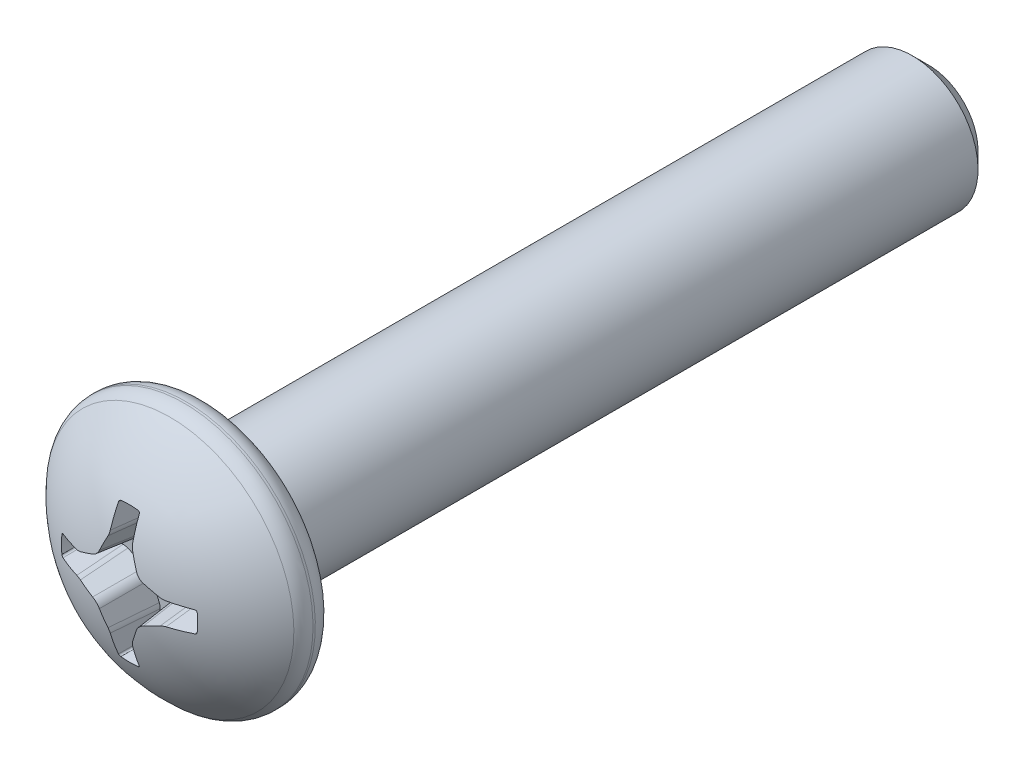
ISO-10303-21;
HEADER;
FILE_DESCRIPTION(('STEP AP214'),'2;1');
FILE_NAME('part.step','',(''),(''),'','','');
FILE_SCHEMA(('AUTOMOTIVE_DESIGN { 1 0 10303 214 1 1 1 1 }'));
ENDSEC;
DATA;
#1=APPLICATION_CONTEXT('core data for automotive mechanical design processes');
#2=APPLICATION_PROTOCOL_DEFINITION('international standard','automotive_design',2000,#1);
#3=PRODUCT_CONTEXT('',#1,'mechanical');
#4=PRODUCT('Part','Part','',(#3));
#5=PRODUCT_RELATED_PRODUCT_CATEGORY('part','',(#4));
#6=PRODUCT_DEFINITION_FORMATION('','',#4);
#7=PRODUCT_DEFINITION_CONTEXT('part definition',#1,'design');
#8=PRODUCT_DEFINITION('design','',#6,#7);
#9=PRODUCT_DEFINITION_SHAPE('','',#8);
#10=(LENGTH_UNIT() NAMED_UNIT(*) SI_UNIT(.MILLI.,.METRE.));
#11=(NAMED_UNIT(*) PLANE_ANGLE_UNIT() SI_UNIT($,.RADIAN.));
#12=(NAMED_UNIT(*) SI_UNIT($,.STERADIAN.) SOLID_ANGLE_UNIT());
#13=UNCERTAINTY_MEASURE_WITH_UNIT(LENGTH_MEASURE(1.E-05),#10,'distance_accuracy_value','');
#14=(GEOMETRIC_REPRESENTATION_CONTEXT(3) GLOBAL_UNCERTAINTY_ASSIGNED_CONTEXT((#13)) GLOBAL_UNIT_ASSIGNED_CONTEXT((#10,
#11,#12)) REPRESENTATION_CONTEXT('',''));
#15=CARTESIAN_POINT('',(0.,0.,0.));
#16=DIRECTION('',(0.,0.,1.));
#17=DIRECTION('',(1.,0.,0.));
#18=AXIS2_PLACEMENT_3D('',#15,#16,#17);
#19=CARTESIAN_POINT('',(0.,0.,15.24));
#20=DIRECTION('',(0.,0.,1.));
#21=DIRECTION('',(0.,1.,0.));
#22=AXIS2_PLACEMENT_3D('',#19,#20,#21);
#23=CONICAL_SURFACE('',#22,3.2258,0.349065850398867);
#24=CARTESIAN_POINT('',(0.,0.,15.24));
#25=DIRECTION('',(0.,0.,-1.));
#26=DIRECTION('',(0.,1.,0.));
#27=AXIS2_PLACEMENT_3D('',#24,#25,#26);
#28=CIRCLE('',#27,3.2258);
#29=CARTESIAN_POINT('',(0.,3.2258,15.24));
#30=VERTEX_POINT('',#29);
#31=EDGE_CURVE('E428',#30,#30,#28,.T.);
#32=ORIENTED_EDGE('',*,*,#31,.T.);
#33=EDGE_LOOP('',(#32));
#34=FACE_BOUND('',#33,.T.);
#35=CARTESIAN_POINT('',(0.,0.,15.1004281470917));
#36=DIRECTION('',(0.,0.,1.));
#37=DIRECTION('',(0.,-1.,0.));
#38=AXIS2_PLACEMENT_3D('',#35,#36,#37);
#39=CIRCLE('',#38,3.175);
#40=CARTESIAN_POINT('',(0.,-3.175,15.1004281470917));
#41=VERTEX_POINT('',#40);
#42=EDGE_CURVE('E12',#41,#41,#39,.F.);
#43=ORIENTED_EDGE('',*,*,#42,.F.);
#44=EDGE_LOOP('',(#43));
#45=FACE_BOUND('',#44,.T.);
#46=ADVANCED_FACE('F42',(#34,#45),#23,.T.);
#47=CARTESIAN_POINT('',(0.,-3.2921575,15.24));
#48=DIRECTION('',(0.,0.,-1.));
#49=DIRECTION('',(0.,1.,0.));
#50=AXIS2_PLACEMENT_3D('',#47,#48,#49);
#51=PLANE('',#50);
#52=ORIENTED_EDGE('',*,*,#31,.F.);
#53=EDGE_LOOP('',(#52));
#54=FACE_BOUND('',#53,.T.);
#55=CARTESIAN_POINT('',(0.,0.,15.24));
#56=DIRECTION('',(0.,0.,1.));
#57=DIRECTION('',(0.,-1.,0.));
#58=AXIS2_PLACEMENT_3D('',#55,#56,#57);
#59=CIRCLE('',#58,3.2921575);
#60=CARTESIAN_POINT('',(0.,-3.2921575,15.24));
#61=VERTEX_POINT('',#60);
#62=EDGE_CURVE('E312',#61,#61,#59,.F.);
#63=ORIENTED_EDGE('',*,*,#62,.T.);
#64=EDGE_LOOP('',(#63));
#65=FACE_BOUND('',#64,.T.);
#66=ADVANCED_FACE('F44',(#54,#65),#51,.T.);
#67=CARTESIAN_POINT('',(0.,0.,7.7556388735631));
#68=DIRECTION('',(0.,0.,-1.));
#69=DIRECTION('',(0.,1.,0.));
#70=AXIS2_PLACEMENT_3D('',#67,#68,#69);
#71=DEGENERATE_TOROIDAL_SURFACE('',#70,3.3655,7.70661112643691,.T.);
#72=CARTESIAN_POINT('',(0.,0.,15.46225));
#73=DIRECTION('',(0.,0.,-1.));
#74=DIRECTION('',(0.,1.,0.));
#75=AXIS2_PLACEMENT_3D('',#72,#73,#74);
#76=CIRCLE('',#75,3.3655);
#77=CARTESIAN_POINT('',(0.,3.3655,15.46225));
#78=VERTEX_POINT('',#77);
#79=EDGE_CURVE('E50',#78,#78,#76,.T.);
#80=ORIENTED_EDGE('',*,*,#79,.F.);
#81=EDGE_LOOP('',(#80));
#82=FACE_BOUND('',#81,.T.);
#83=CARTESIAN_POINT('',(0.,0.,15.2955625));
#84=DIRECTION('',(0.,0.,-1.));
#85=DIRECTION('',(0.,1.,0.));
#86=AXIS2_PLACEMENT_3D('',#83,#84,#85);
#87=CIRCLE('',#86,4.95967902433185);
#88=CARTESIAN_POINT('',(0.,4.95967902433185,15.2955625));
#89=VERTEX_POINT('',#88);
#90=EDGE_CURVE('E451',#89,#89,#87,.T.);
#91=ORIENTED_EDGE('',*,*,#90,.T.);
#92=EDGE_LOOP('',(#91));
#93=FACE_BOUND('',#92,.T.);
#94=ADVANCED_FACE('F402',(#82,#93),#71,.F.);
#95=CARTESIAN_POINT('',(0.,0.,15.24));
#96=DIRECTION('',(0.,0.,1.));
#97=DIRECTION('',(0.,-1.,0.));
#98=AXIS2_PLACEMENT_3D('',#95,#96,#97);
#99=CONICAL_SURFACE('',#98,4.92760000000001,0.523598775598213);
#100=ORIENTED_EDGE('',*,*,#90,.F.);
#101=EDGE_LOOP('',(#100));
#102=FACE_BOUND('',#101,.T.);
#103=CARTESIAN_POINT('',(0.,0.,15.24));
#104=DIRECTION('',(0.,0.,-1.));
#105=DIRECTION('',(0.,1.,0.));
#106=AXIS2_PLACEMENT_3D('',#103,#104,#105);
#107=CIRCLE('',#106,4.92760000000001);
#108=CARTESIAN_POINT('',(0.,4.9276,15.24));
#109=VERTEX_POINT('',#108);
#110=EDGE_CURVE('E453',#109,#109,#107,.T.);
#111=ORIENTED_EDGE('',*,*,#110,.T.);
#112=EDGE_LOOP('',(#111));
#113=FACE_BOUND('',#112,.T.);
#114=ADVANCED_FACE('F422',(#102,#113),#99,.F.);
#115=CARTESIAN_POINT('',(0.,0.,-19.685));
#116=DIRECTION('',(0.,0.,-1.));
#117=DIRECTION('',(0.,1.,0.));
#118=AXIS2_PLACEMENT_3D('',#115,#116,#117);
#119=CYLINDRICAL_SURFACE('',#118,3.3655);
#120=CARTESIAN_POINT('',(0.,0.,15.3133425));
#121=DIRECTION('',(0.,0.,1.));
#122=DIRECTION('',(0.,-1.,0.));
#123=AXIS2_PLACEMENT_3D('',#120,#121,#122);
#124=CIRCLE('',#123,3.3655);
#125=CARTESIAN_POINT('',(0.,-3.36550000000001,15.3133425));
#126=VERTEX_POINT('',#125);
#127=EDGE_CURVE('E432',#126,#126,#124,.T.);
#128=ORIENTED_EDGE('',*,*,#127,.T.);
#129=EDGE_LOOP('',(#128));
#130=FACE_BOUND('',#129,.T.);
#131=ORIENTED_EDGE('',*,*,#79,.T.);
#132=EDGE_LOOP('',(#131));
#133=FACE_BOUND('',#132,.T.);
#134=ADVANCED_FACE('F397',(#130,#133),#119,.T.);
#135=CARTESIAN_POINT('',(0.,0.,15.24));
#136=DIRECTION('',(0.,0.,1.));
#137=DIRECTION('',(0.,-1.,0.));
#138=AXIS2_PLACEMENT_3D('',#135,#136,#137);
#139=CONICAL_SURFACE('',#138,3.2921575,0.785398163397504);
#140=ORIENTED_EDGE('',*,*,#127,.F.);
#141=EDGE_LOOP('',(#140));
#142=FACE_BOUND('',#141,.T.);
#143=ORIENTED_EDGE('',*,*,#62,.F.);
#144=EDGE_LOOP('',(#143));
#145=FACE_BOUND('',#144,.T.);
#146=ADVANCED_FACE('F393',(#142,#145),#139,.T.);
#147=CARTESIAN_POINT('',(0.,3.175,15.24));
#148=DIRECTION('',(0.,0.,1.));
#149=DIRECTION('',(0.,-1.,0.));
#150=AXIS2_PLACEMENT_3D('',#147,#148,#149);
#151=PLANE('',#150);
#152=CARTESIAN_POINT('',(0.,0.,15.24));
#153=DIRECTION('',(0.,0.,1.));
#154=DIRECTION('',(0.,-1.,0.));
#155=AXIS2_PLACEMENT_3D('',#152,#153,#154);
#156=CIRCLE('',#155,5.248656);
#157=CARTESIAN_POINT('',(0.,-5.24865600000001,15.24));
#158=VERTEX_POINT('',#157);
#159=EDGE_CURVE('E466',#158,#158,#156,.T.);
#160=ORIENTED_EDGE('',*,*,#159,.F.);
#161=EDGE_LOOP('',(#160));
#162=FACE_BOUND('',#161,.T.);
#163=ORIENTED_EDGE('',*,*,#110,.F.);
#164=EDGE_LOOP('',(#163));
#165=FACE_BOUND('',#164,.T.);
#166=ADVANCED_FACE('F396',(#162,#165),#151,.F.);
#167=CARTESIAN_POINT('',(0.,0.,16.35125));
#168=DIRECTION('',(0.,0.,1.));
#169=DIRECTION('',(0.,-1.,0.));
#170=AXIS2_PLACEMENT_3D('',#167,#168,#169);
#171=TOROIDAL_SURFACE('',#170,5.248656,0.999744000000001);
#172=CARTESIAN_POINT('',(0.,0.,17.0208816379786));
#173=DIRECTION('',(0.,0.,1.));
#174=DIRECTION('',(0.,-1.,0.));
#175=AXIS2_PLACEMENT_3D('',#172,#173,#174);
#176=CIRCLE('',#175,5.99100466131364);
#177=CARTESIAN_POINT('',(0.,-5.99100466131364,17.0208816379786));
#178=VERTEX_POINT('',#177);
#179=EDGE_CURVE('E469',#178,#178,#176,.T.);
#180=ORIENTED_EDGE('',*,*,#179,.F.);
#181=EDGE_LOOP('',(#180));
#182=FACE_BOUND('',#181,.T.);
#183=CARTESIAN_POINT('',(0.,0.,16.35125));
#184=DIRECTION('',(0.,0.,1.));
#185=DIRECTION('',(0.,-1.,0.));
#186=AXIS2_PLACEMENT_3D('',#183,#184,#185);
#187=CIRCLE('',#186,6.2484);
#188=CARTESIAN_POINT('',(0.,-6.24840000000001,16.35125));
#189=VERTEX_POINT('',#188);
#190=EDGE_CURVE('E459',#189,#189,#187,.T.);
#191=ORIENTED_EDGE('',*,*,#190,.T.);
#192=EDGE_LOOP('',(#191));
#193=FACE_BOUND('',#192,.T.);
#194=ADVANCED_FACE('F526',(#182,#193),#171,.T.);
#195=CARTESIAN_POINT('',(0.,0.,11.6167279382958));
#196=DIRECTION('',(0.,0.,1.));
#197=DIRECTION('',(0.,1.,0.));
#198=AXIS2_PLACEMENT_3D('',#195,#196,#197);
#199=SPHERICAL_SURFACE('',#198,8.06827206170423);
#200=CARTESIAN_POINT('',(0.,0.,18.9792860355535));
#201=DIRECTION('',(0.,0.,1.));
#202=DIRECTION('',(1.,0.,0.));
#203=AXIS2_PLACEMENT_3D('',#200,#201,#202);
#204=CIRCLE('',#203,3.29996247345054);
#205=CARTESIAN_POINT('',(-3.27307847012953,-0.420368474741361,18.9792860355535));
#206=VERTEX_POINT('',#205);
#207=CARTESIAN_POINT('',(-3.27307847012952,0.420368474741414,18.9792860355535));
#208=VERTEX_POINT('',#207);
#209=EDGE_CURVE('E306',#206,#208,#204,.F.);
#210=ORIENTED_EDGE('',*,*,#209,.T.);
#211=CARTESIAN_POINT('',(-3.39335954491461,0.74617509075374,21.3269126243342));
#212=CARTESIAN_POINT('',(-3.46758133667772,0.745505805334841,21.3205447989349));
#213=CARTESIAN_POINT('',(-3.48231725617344,0.672758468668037,21.3269126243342));
#214=CARTESIAN_POINT('',(-3.34652590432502,0.689439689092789,20.7871113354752));
#215=CARTESIAN_POINT('',(-3.42152517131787,0.688453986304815,20.7777329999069));
#216=CARTESIAN_POINT('',(-3.435715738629,0.614817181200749,20.7871113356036));
#217=CARTESIAN_POINT('',(-3.29874996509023,0.632712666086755,20.2473897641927));
#218=CARTESIAN_POINT('',(-3.37475783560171,0.631654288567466,20.2373199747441));
#219=CARTESIAN_POINT('',(-3.38815936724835,0.556826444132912,20.247389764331));
#220=CARTESIAN_POINT('',(-3.20100637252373,0.519280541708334,19.1681551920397));
#221=CARTESIAN_POINT('',(-3.27929245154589,0.518167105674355,19.157561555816));
#222=CARTESIAN_POINT('',(-3.29081424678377,0.44072901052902,19.1681551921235));
#223=CARTESIAN_POINT('',(-3.15103876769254,0.462575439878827,18.62864218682));
#224=CARTESIAN_POINT('',(-3.23049530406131,0.461392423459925,18.6173865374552));
#225=CARTESIAN_POINT('',(-3.24102554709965,0.382622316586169,18.6286421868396));
#226=CARTESIAN_POINT('',(-3.04860237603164,0.349189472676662,17.5498467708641));
#227=CARTESIAN_POINT('',(-3.13068205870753,0.347944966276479,17.5380060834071));
#228=CARTESIAN_POINT('',(-3.13889076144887,0.266272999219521,17.5498467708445));
#229=CARTESIAN_POINT('',(-2.99613357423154,0.292508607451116,17.0105643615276));
#230=CARTESIAN_POINT('',(-3.07953775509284,0.291165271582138,16.9977833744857));
#231=CARTESIAN_POINT('',(-3.08654466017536,0.208030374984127,17.0105643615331));
#232=CARTESIAN_POINT('',(-2.88824657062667,0.179176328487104,15.9322797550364));
#233=CARTESIAN_POINT('',(-2.97473764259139,0.177775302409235,15.9189498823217));
#234=CARTESIAN_POINT('',(-2.97882031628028,0.0913835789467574,15.9322797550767));
#235=CARTESIAN_POINT('',(-2.83282830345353,0.122524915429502,15.3932775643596));
#236=CARTESIAN_POINT('',(-2.92090954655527,0.121028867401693,15.3790436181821));
#237=CARTESIAN_POINT('',(-2.92344200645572,0.0329794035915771,15.3932775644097));
#238=CARTESIAN_POINT('',(-2.77571220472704,0.0658919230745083,14.854450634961));
#239=CARTESIAN_POINT('',(-2.8661194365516,0.0648952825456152,14.8449682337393));
#240=CARTESIAN_POINT('',(-2.86631122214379,-0.0255172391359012,14.854450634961));
#241=(BOUNDED_SURFACE() B_SPLINE_SURFACE(3,2,((#211,#212,#213),(#214,#215,#216),(#217,#218,
#219),(#220,#221,#222),(#223,#224,#225),(#226,#227,#228),(#229,#230,#231),(#232,#233,#234),
(#235,#236,#237),(#238,#239,#240)),.UNSPECIFIED.,.F.,.F.,.F.) B_SPLINE_SURFACE_WITH_KNOTS((4,2,
2,2,4),(3,3),(0.,1.63437514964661,3.26871414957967,4.90306293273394,6.53744795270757),(0.,1.),
.UNSPECIFIED.) GEOMETRIC_REPRESENTATION_ITEM() RATIONAL_B_SPLINE_SURFACE(((1.,0.774124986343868,
1.),(1.,0.769871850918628,1.),(1.,0.765383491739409,1.),(1.,0.755820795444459,1.),(1.,
0.750746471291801,1.),(1.,0.739896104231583,1.),(1.,0.734120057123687,1.),(1.,0.721690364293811,
1.),(1.,0.715036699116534,1.),(1.,0.707856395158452,1.))) REPRESENTATION_ITEM('') SURFACE());
#242=CARTESIAN_POINT('',(-3.27307847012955,0.420368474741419,18.9792860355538));
#243=CARTESIAN_POINT('',(-3.27243563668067,0.425420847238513,18.9792833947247));
#244=CARTESIAN_POINT('',(-3.27137955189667,0.43041477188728,18.9794624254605));
#245=CARTESIAN_POINT('',(-3.26851075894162,0.44014193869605,18.9801613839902));
#246=CARTESIAN_POINT('',(-3.26670003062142,0.444875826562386,18.9806804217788));
#247=CARTESIAN_POINT('',(-3.26238898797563,0.45396430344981,18.982036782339));
#248=CARTESIAN_POINT('',(-3.25988905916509,0.458319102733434,18.9828739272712));
#249=CARTESIAN_POINT('',(-3.25428108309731,0.4665458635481,18.9848368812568));
#250=CARTESIAN_POINT('',(-3.25117282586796,0.470417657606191,18.9859627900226));
#251=CARTESIAN_POINT('',(-3.24432877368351,0.477715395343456,18.9885092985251));
#252=CARTESIAN_POINT('',(-3.24057512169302,0.481121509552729,18.9899386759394));
#253=CARTESIAN_POINT('',(-3.23262593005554,0.487249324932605,18.9930250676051));
#254=CARTESIAN_POINT('',(-3.22843012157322,0.489970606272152,18.9946822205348));
#255=CARTESIAN_POINT('',(-3.21950184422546,0.494785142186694,18.9982616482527));
#256=CARTESIAN_POINT('',(-3.21475326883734,0.496841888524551,19.0001928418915));
#257=CARTESIAN_POINT('',(-3.20503371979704,0.50008937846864,19.0041979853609));
#258=CARTESIAN_POINT('',(-3.20006308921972,0.501281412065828,19.0062717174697));
#259=CARTESIAN_POINT('',(-3.19212557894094,0.50246502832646,19.0096223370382));
#260=CARTESIAN_POINT('',(-3.18918811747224,0.502749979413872,19.0108706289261));
#261=CARTESIAN_POINT('',(-3.18624937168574,0.502881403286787,19.0121278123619));
#262=B_SPLINE_CURVE_WITH_KNOTS('',3,(#242,#243,#244,#245,#246,#247,#248,#249,#250,#251,#252,
#253,#254,#255,#256,#257,#258,#259,#260,#261),.UNSPECIFIED.,.F.,.F.,(4,2,2,2,2,2,2,2,2,4),(0.,
0.0152512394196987,0.0304627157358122,0.0456657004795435,0.0608739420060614,0.0766034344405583,
0.0923425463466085,0.108838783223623,0.125310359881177,0.134908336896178),.UNSPECIFIED.);
#263=CARTESIAN_POINT('',(-3.18624937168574,0.502881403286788,19.0121278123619));
#264=VERTEX_POINT('',#263);
#265=EDGE_CURVE('E299',#208,#264,#262,.T.);
#266=ORIENTED_EDGE('',*,*,#265,.T.);
#267=CARTESIAN_POINT('',(0.,-0.271408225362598,11.6452540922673));
#268=DIRECTION('',(0.,-0.994521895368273,0.104528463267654));
#269=DIRECTION('',(0.,-0.104528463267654,-0.994521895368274));
#270=AXIS2_PLACEMENT_3D('',#267,#268,#269);
#271=CIRCLE('',#270,8.06365536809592);
#272=CARTESIAN_POINT('',(-2.15672491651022,0.540765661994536,19.3725724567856));
#273=VERTEX_POINT('',#272);
#274=EDGE_CURVE('E303',#264,#273,#271,.F.);
#275=ORIENTED_EDGE('',*,*,#274,.T.);
#276=CARTESIAN_POINT('',(-2.15672491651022,0.540765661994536,19.3725724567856));
#277=CARTESIAN_POINT('',(-2.11750463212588,0.541882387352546,19.3834030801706));
#278=CARTESIAN_POINT('',(-2.07829944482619,0.546845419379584,19.3936361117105));
#279=CARTESIAN_POINT('',(-2.02057328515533,0.559859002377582,19.4078294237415));
#280=CARTESIAN_POINT('',(-2.00154285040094,0.565111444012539,19.4123611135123));
#281=CARTESIAN_POINT('',(-1.96381202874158,0.577490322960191,19.4210459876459));
#282=CARTESIAN_POINT('',(-1.94511620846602,0.584633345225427,19.4251953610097));
#283=CARTESIAN_POINT('',(-1.92675950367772,0.592686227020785,19.4291113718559));
#284=B_SPLINE_CURVE_WITH_KNOTS('',3,(#276,#277,#278,#279,#280,#281,#282,#283),.UNSPECIFIED.,.F.,
.F.,(4,2,2,4),(0.,0.121772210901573,0.182452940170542,0.243684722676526),.UNSPECIFIED.);
#285=CARTESIAN_POINT('',(-1.92675950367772,0.592686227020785,19.4291113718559));
#286=VERTEX_POINT('',#285);
#287=EDGE_CURVE('E630',#273,#286,#284,.T.);
#288=ORIENTED_EDGE('',*,*,#287,.T.);
#289=CARTESIAN_POINT('',(-0.175547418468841,0.423808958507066,11.5685137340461));
#290=DIRECTION('',(0.380587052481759,-0.918818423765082,0.104528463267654));
#291=DIRECTION('',(0.923879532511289,0.382683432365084,0.));
#292=AXIS2_PLACEMENT_3D('',#289,#290,#291);
#293=CIRCLE('',#292,8.05507656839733);
#294=CARTESIAN_POINT('',(-1.2235840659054,0.896692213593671,19.5411079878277));
#295=VERTEX_POINT('',#294);
#296=EDGE_CURVE('E322',#286,#295,#293,.F.);
#297=ORIENTED_EDGE('',*,*,#296,.T.);
#298=CARTESIAN_POINT('',(-1.2235840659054,0.896692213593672,19.5411079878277));
#299=CARTESIAN_POINT('',(-1.19259538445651,0.909868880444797,19.5444041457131));
#300=CARTESIAN_POINT('',(-1.162656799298,0.925667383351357,19.547020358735));
#301=CARTESIAN_POINT('',(-1.10565533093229,0.9619686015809,19.5508499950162));
#302=CARTESIAN_POINT('',(-1.07859421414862,0.982474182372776,19.5520625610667));
#303=CARTESIAN_POINT('',(-1.02814356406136,1.0276500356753,19.5530382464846));
#304=CARTESIAN_POINT('',(-1.00475687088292,1.05232349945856,19.5528002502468));
#305=CARTESIAN_POINT('',(-0.962371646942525,1.10508409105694,19.5508810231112));
#306=CARTESIAN_POINT('',(-0.943364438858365,1.13316429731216,19.5492026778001));
#307=CARTESIAN_POINT('',(-0.921222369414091,1.17243107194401,19.546034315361));
#308=CARTESIAN_POINT('',(-0.915913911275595,1.18248629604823,19.5451560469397));
#309=CARTESIAN_POINT('',(-0.905872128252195,1.20284923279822,19.5432462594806));
#310=CARTESIAN_POINT('',(-0.901138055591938,1.21315659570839,19.5422149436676));
#311=CARTESIAN_POINT('',(-0.896692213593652,1.22358406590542,19.5411079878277));
#312=B_SPLINE_CURVE_WITH_KNOTS('',3,(#298,#299,#300,#301,#302,#303,#304,#305,#306,#307,#308,
#309,#310,#311),.UNSPECIFIED.,.F.,.F.,(4,2,2,2,2,2,4),(0.,0.101377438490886,0.202816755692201,
0.304334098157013,0.405648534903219,0.43984813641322,0.474002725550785),.UNSPECIFIED.);
#313=CARTESIAN_POINT('',(-0.896692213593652,1.22358406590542,19.5411079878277));
#314=VERTEX_POINT('',#313);
#315=EDGE_CURVE('E622',#295,#314,#312,.T.);
#316=ORIENTED_EDGE('',*,*,#315,.T.);
#317=CARTESIAN_POINT('',(-0.423808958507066,0.175547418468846,11.5685137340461));
#318=DIRECTION('',(0.918818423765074,-0.380587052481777,0.104528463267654));
#319=DIRECTION('',(0.382683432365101,0.923879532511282,0.));
#320=AXIS2_PLACEMENT_3D('',#317,#318,#319);
#321=CIRCLE('',#320,8.05507656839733);
#322=CARTESIAN_POINT('',(-0.592686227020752,1.92675950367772,19.4291113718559));
#323=VERTEX_POINT('',#322);
#324=EDGE_CURVE('E936',#314,#323,#321,.F.);
#325=ORIENTED_EDGE('',*,*,#324,.T.);
#326=CARTESIAN_POINT('',(-0.592686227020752,1.92675950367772,19.4291113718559));
#327=CARTESIAN_POINT('',(-0.584633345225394,1.94511620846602,19.4251953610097));
#328=CARTESIAN_POINT('',(-0.577490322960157,1.96381202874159,19.4210459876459));
#329=CARTESIAN_POINT('',(-0.565111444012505,2.00154285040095,19.4123611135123));
#330=CARTESIAN_POINT('',(-0.559859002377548,2.02057328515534,19.4078294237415));
#331=CARTESIAN_POINT('',(-0.546845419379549,2.07829944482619,19.3936361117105));
#332=CARTESIAN_POINT('',(-0.54188238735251,2.11750463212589,19.3834030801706));
#333=CARTESIAN_POINT('',(-0.540765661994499,2.15672491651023,19.3725724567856));
#334=B_SPLINE_CURVE_WITH_KNOTS('',3,(#326,#327,#328,#329,#330,#331,#332,#333),.UNSPECIFIED.,.F.,
.F.,(4,2,2,4),(0.,0.0612317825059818,0.12191251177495,0.243684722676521),.UNSPECIFIED.);
#335=CARTESIAN_POINT('',(-0.540765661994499,2.15672491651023,19.3725724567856));
#336=VERTEX_POINT('',#335);
#337=EDGE_CURVE('E613',#323,#336,#334,.T.);
#338=ORIENTED_EDGE('',*,*,#337,.T.);
#339=CARTESIAN_POINT('',(0.271408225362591,0.,11.6452540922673));
#340=DIRECTION('',(0.994521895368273,0.,0.104528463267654));
#341=DIRECTION('',(0.104528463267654,0.,-0.994521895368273));
#342=AXIS2_PLACEMENT_3D('',#339,#340,#341);
#343=CIRCLE('',#342,8.06365536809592);
#344=CARTESIAN_POINT('',(-0.502881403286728,3.18624937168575,19.0121278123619));
#345=VERTEX_POINT('',#344);
#346=EDGE_CURVE('E932',#336,#345,#343,.F.);
#347=ORIENTED_EDGE('',*,*,#346,.T.);
#348=CARTESIAN_POINT('',(-0.67275846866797,3.48231725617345,21.3269126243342));
#349=CARTESIAN_POINT('',(-0.745505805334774,3.46758133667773,21.3205447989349));
#350=CARTESIAN_POINT('',(-0.746175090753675,3.39335954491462,21.3269126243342));
#351=CARTESIAN_POINT('',(-0.614817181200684,3.43571573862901,20.7871113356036));
#352=CARTESIAN_POINT('',(-0.68845398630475,3.42152517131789,20.7777329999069));
#353=CARTESIAN_POINT('',(-0.689439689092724,3.34652590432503,20.7871113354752));
#354=CARTESIAN_POINT('',(-0.556826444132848,3.38815936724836,20.2473897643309));
#355=CARTESIAN_POINT('',(-0.631654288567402,3.37475783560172,20.2373199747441));
#356=CARTESIAN_POINT('',(-0.632712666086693,3.29874996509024,20.2473897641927));
#357=CARTESIAN_POINT('',(-0.440729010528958,3.29081424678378,19.1681551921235));
#358=CARTESIAN_POINT('',(-0.518167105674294,3.27929245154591,19.157561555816));
#359=CARTESIAN_POINT('',(-0.519280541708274,3.20100637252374,19.1681551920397));
#360=CARTESIAN_POINT('',(-0.382622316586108,3.24102554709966,18.6286421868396));
#361=CARTESIAN_POINT('',(-0.461392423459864,3.23049530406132,18.6173865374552));
#362=CARTESIAN_POINT('',(-0.462575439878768,3.15103876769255,18.62864218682));
#363=CARTESIAN_POINT('',(-0.266272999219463,3.13889076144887,17.5498467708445));
#364=CARTESIAN_POINT('',(-0.347944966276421,3.13068205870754,17.5380060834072));
#365=CARTESIAN_POINT('',(-0.349189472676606,3.04860237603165,17.5498467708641));
#366=CARTESIAN_POINT('',(-0.208030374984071,3.08654466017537,17.0105643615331));
#367=CARTESIAN_POINT('',(-0.291165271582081,3.07953775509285,16.9977833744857));
#368=CARTESIAN_POINT('',(-0.292508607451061,2.99613357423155,17.0105643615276));
#369=CARTESIAN_POINT('',(-0.0913835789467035,2.97882031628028,15.9322797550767));
#370=CARTESIAN_POINT('',(-0.177775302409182,2.9747376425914,15.9189498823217));
#371=CARTESIAN_POINT('',(-0.179176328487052,2.88824657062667,15.9322797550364));
#372=CARTESIAN_POINT('',(-0.0329794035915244,2.92344200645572,15.3932775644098));
#373=CARTESIAN_POINT('',(-0.121028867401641,2.92090954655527,15.3790436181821));
#374=CARTESIAN_POINT('',(-0.122524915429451,2.83282830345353,15.3932775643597));
#375=CARTESIAN_POINT('',(0.0255172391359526,2.8663112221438,14.8544506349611));
#376=CARTESIAN_POINT('',(-0.0648952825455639,2.86611943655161,14.8449682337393));
#377=CARTESIAN_POINT('',(-0.0658919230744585,2.77571220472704,14.8544506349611));
#378=(BOUNDED_SURFACE() B_SPLINE_SURFACE(3,2,((#348,#349,#350),(#351,#352,#353),(#354,#355,
#356),(#357,#358,#359),(#360,#361,#362),(#363,#364,#365),(#366,#367,#368),(#369,#370,#371),
(#372,#373,#374),(#375,#376,#377)),.UNSPECIFIED.,.F.,.F.,.F.) B_SPLINE_SURFACE_WITH_KNOTS((4,2,
2,2,4),(3,3),(0.,1.63437514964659,3.26871414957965,4.9030629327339,6.53744795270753),(0.,1.),
.UNSPECIFIED.) GEOMETRIC_REPRESENTATION_ITEM() RATIONAL_B_SPLINE_SURFACE(((1.,0.774124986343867,
1.),(1.,0.769871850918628,1.),(1.,0.765383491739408,1.),(1.,0.755820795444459,1.),(1.,
0.750746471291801,1.),(1.,0.739896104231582,1.),(1.,0.734120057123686,1.),(1.,0.721690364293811,
1.),(1.,0.715036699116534,1.),(1.,0.707856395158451,1.))) REPRESENTATION_ITEM('') SURFACE());
#379=CARTESIAN_POINT('',(-0.502881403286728,3.18624937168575,19.0121278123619));
#380=CARTESIAN_POINT('',(-0.502651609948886,3.1914410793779,19.0099066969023));
#381=CARTESIAN_POINT('',(-0.501940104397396,3.19662293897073,19.0077159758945));
#382=CARTESIAN_POINT('',(-0.499590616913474,3.20682711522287,19.0034535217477));
#383=CARTESIAN_POINT('',(-0.497952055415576,3.21184933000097,19.0013818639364));
#384=CARTESIAN_POINT('',(-0.493784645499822,3.22159017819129,18.9974175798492));
#385=CARTESIAN_POINT('',(-0.491255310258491,3.22630864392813,18.9955250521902));
#386=CARTESIAN_POINT('',(-0.485367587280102,3.23529436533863,18.9919794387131));
#387=CARTESIAN_POINT('',(-0.482009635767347,3.23956185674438,18.9903262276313));
#388=CARTESIAN_POINT('',(-0.474608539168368,3.24744732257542,18.9873369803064));
#389=CARTESIAN_POINT('',(-0.470577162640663,3.25107456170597,18.9859963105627));
#390=CARTESIAN_POINT('',(-0.46189767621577,3.25763213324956,18.9836491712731));
#391=CARTESIAN_POINT('',(-0.457249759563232,3.26056268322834,18.9826425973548));
#392=CARTESIAN_POINT('',(-0.447416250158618,3.2656415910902,18.9809963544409));
#393=CARTESIAN_POINT('',(-0.442225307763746,3.26778099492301,18.9803608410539));
#394=CARTESIAN_POINT('',(-0.43150434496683,3.27114521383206,18.9795031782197));
#395=CARTESIAN_POINT('',(-0.425973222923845,3.27236686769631,18.9792824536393));
#396=CARTESIAN_POINT('',(-0.420368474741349,3.27307847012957,18.9792860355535));
#397=B_SPLINE_CURVE_WITH_KNOTS('',3,(#379,#380,#381,#382,#383,#384,#385,#386,#387,#388,#389,
#390,#391,#392,#393,#394,#395,#396),.UNSPECIFIED.,.F.,.F.,(4,2,2,2,2,2,2,2,4),(0.,
0.01693297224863,0.033876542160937,0.0508293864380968,0.067773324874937,0.0844473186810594,
0.101116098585,0.117968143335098,0.134877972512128),.UNSPECIFIED.);
#398=CARTESIAN_POINT('',(-0.420368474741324,3.27307847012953,18.9792860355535));
#399=VERTEX_POINT('',#398);
#400=EDGE_CURVE('E311',#345,#399,#397,.T.);
#401=ORIENTED_EDGE('',*,*,#400,.T.);
#402=CARTESIAN_POINT('',(0.,0.,18.9792860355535));
#403=DIRECTION('',(0.,0.,1.));
#404=DIRECTION('',(1.,0.,0.));
#405=AXIS2_PLACEMENT_3D('',#402,#403,#404);
#406=CIRCLE('',#405,3.29996247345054);
#407=CARTESIAN_POINT('',(0.420368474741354,3.27307847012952,18.9792860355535));
#408=VERTEX_POINT('',#407);
#409=EDGE_CURVE('E487',#399,#408,#406,.F.);
#410=ORIENTED_EDGE('',*,*,#409,.T.);
#411=CARTESIAN_POINT('',(0.730893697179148,3.38072431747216,21.1815198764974));
#412=CARTESIAN_POINT('',(0.730219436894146,3.45521938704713,21.1751047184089));
#413=CARTESIAN_POINT('',(0.657151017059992,3.46974440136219,21.1815198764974));
#414=CARTESIAN_POINT('',(0.676706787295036,3.33582831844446,20.6659658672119));
#415=CARTESIAN_POINT('',(0.675738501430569,3.41108169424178,20.6567532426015));
#416=CARTESIAN_POINT('',(0.601802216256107,3.42506774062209,20.6659658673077));
#417=CARTESIAN_POINT('',(0.622527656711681,3.29006169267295,20.1504858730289));
#418=CARTESIAN_POINT('',(0.621493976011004,3.36629236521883,20.1406510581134));
#419=CARTESIAN_POINT('',(0.546407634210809,3.37950848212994,20.1504858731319));
#420=CARTESIAN_POINT('',(0.514189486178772,3.19651737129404,19.1197170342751));
#421=CARTESIAN_POINT('',(0.51310394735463,3.27493835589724,19.109388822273));
#422=CARTESIAN_POINT('',(0.435511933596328,3.28634123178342,19.1197170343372));
#423=CARTESIAN_POINT('',(0.460030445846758,3.14873971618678,18.6044281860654));
#424=CARTESIAN_POINT('',(0.458881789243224,3.2282863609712,18.5934994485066));
#425=CARTESIAN_POINT('',(0.380010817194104,3.23873328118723,18.6044281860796));
#426=CARTESIAN_POINT('',(0.351734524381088,3.05090147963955,17.5740613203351));
#427=CARTESIAN_POINT('',(0.350528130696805,3.13295481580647,17.5625832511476));
#428=CARTESIAN_POINT('',(0.26888455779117,3.14118307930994,17.5740613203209));
#429=CARTESIAN_POINT('',(0.297597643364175,3.00084088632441,17.0589833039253));
#430=CARTESIAN_POINT('',(0.296303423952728,3.08416352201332,17.0466696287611));
#431=CARTESIAN_POINT('',(0.213259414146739,3.09124081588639,17.0589833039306));
#432=CARTESIAN_POINT('',(0.189350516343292,2.89804971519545,16.0290806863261));
#433=CARTESIAN_POINT('',(0.188000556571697,2.98429690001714,16.0162366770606));
#434=CARTESIAN_POINT('',(0.101862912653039,2.98861209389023,16.029080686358));
#435=CARTESIAN_POINT('',(0.135240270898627,2.84531908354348,15.5142560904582));
#436=CARTESIAN_POINT('',(0.133805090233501,2.93307352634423,15.5006012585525));
#437=CARTESIAN_POINT('',(0.0460915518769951,2.93592557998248,15.5142560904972));
#438=CARTESIAN_POINT('',(0.0811465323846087,2.79106078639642,14.9995885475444));
#439=CARTESIAN_POINT('',(0.0801607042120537,2.88098170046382,14.9902090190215));
#440=CARTESIAN_POINT('',(-0.00976303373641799,2.88166287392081,14.9995885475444));
#441=(BOUNDED_SURFACE() B_SPLINE_SURFACE(3,2,((#411,#412,#413),(#414,#415,#416),(#417,#418,
#419),(#420,#421,#422),(#423,#424,#425),(#426,#427,#428),(#429,#430,#431),(#432,#433,#434),
(#435,#436,#437),(#438,#439,#440)),.UNSPECIFIED.,.F.,.F.,.F.) B_SPLINE_SURFACE_WITH_KNOTS((4,2,
2,2,4),(3,3),(0.,1.5610036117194,3.12197580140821,4.68295611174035,6.24396790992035),(0.,1.),
.UNSPECIFIED.) GEOMETRIC_REPRESENTATION_ITEM() RATIONAL_B_SPLINE_SURFACE(((1.,0.772974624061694,
1.),(1.,0.768870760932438,1.),(1.,0.764548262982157,1.),(1.,0.75536438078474,1.),(1.,
0.750503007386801,1.),(1.,0.740139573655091,1.),(1.,0.734637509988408,1.),(1.,0.722840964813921,
1.),(1.,0.716546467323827,1.),(1.,0.709779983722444,1.))) REPRESENTATION_ITEM('') SURFACE());
#442=CARTESIAN_POINT('',(0.420368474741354,3.27307847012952,18.9792860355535));
#443=CARTESIAN_POINT('',(0.425420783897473,3.27243548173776,18.9792834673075));
#444=CARTESIAN_POINT('',(0.430414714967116,3.27137939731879,18.9794624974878));
#445=CARTESIAN_POINT('',(0.44014191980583,3.26851068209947,18.9801614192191));
#446=CARTESIAN_POINT('',(0.444875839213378,3.26670003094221,18.980680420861));
#447=CARTESIAN_POINT('',(0.453964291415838,3.26238898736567,18.9820367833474));
#448=CARTESIAN_POINT('',(0.458319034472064,3.25988898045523,18.9828739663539));
#449=CARTESIAN_POINT('',(0.46654580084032,3.25428099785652,18.9848369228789));
#450=CARTESIAN_POINT('',(0.470417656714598,3.25117281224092,18.9859627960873));
#451=CARTESIAN_POINT('',(0.477715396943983,3.24432878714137,18.9885092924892));
#452=CARTESIAN_POINT('',(0.481121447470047,3.24057508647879,18.9899386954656));
#453=CARTESIAN_POINT('',(0.487249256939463,3.23262588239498,18.9930250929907));
#454=CARTESIAN_POINT('',(0.489970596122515,3.22843011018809,18.994682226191));
#455=CARTESIAN_POINT('',(0.494785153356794,3.2195018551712,18.9982616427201));
#456=CARTESIAN_POINT('',(0.496841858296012,3.21475326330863,19.0001928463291));
#457=CARTESIAN_POINT('',(0.500089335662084,3.20503370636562,19.0041979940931));
#458=CARTESIAN_POINT('',(0.501281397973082,3.20006308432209,19.00627172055));
#459=CARTESIAN_POINT('',(0.502465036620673,3.19212558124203,19.0096223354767));
#460=CARTESIAN_POINT('',(0.502749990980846,3.18918812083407,19.0108706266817));
#461=CARTESIAN_POINT('',(0.502881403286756,3.18624937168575,19.0121278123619));
#462=B_SPLINE_CURVE_WITH_KNOTS('',3,(#442,#443,#444,#445,#446,#447,#448,#449,#450,#451,#452,
#453,#454,#455,#456,#457,#458,#459,#460,#461),.UNSPECIFIED.,.F.,.F.,(4,2,2,2,2,2,2,2,2,4),(0.,
0.0152512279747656,0.0304626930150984,0.0456656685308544,0.0608739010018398,0.076603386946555,
0.0923424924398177,0.108838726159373,0.125310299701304,0.134908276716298),.UNSPECIFIED.);
#463=CARTESIAN_POINT('',(0.502881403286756,3.18624937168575,19.0121278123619));
#464=VERTEX_POINT('',#463);
#465=EDGE_CURVE('E552',#408,#464,#462,.T.);
#466=ORIENTED_EDGE('',*,*,#465,.T.);
#467=CARTESIAN_POINT('',(-0.271408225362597,0.,11.6452540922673));
#468=DIRECTION('',(-0.994521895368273,0.,0.104528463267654));
#469=DIRECTION('',(0.104528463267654,0.,0.994521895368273));
#470=AXIS2_PLACEMENT_3D('',#467,#468,#469);
#471=CIRCLE('',#470,8.06365536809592);
#472=CARTESIAN_POINT('',(0.540765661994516,2.15672491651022,19.3725724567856));
#473=VERTEX_POINT('',#472);
#474=EDGE_CURVE('E65',#464,#473,#471,.F.);
#475=ORIENTED_EDGE('',*,*,#474,.T.);
#476=CARTESIAN_POINT('',(0.540765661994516,2.15672491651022,19.3725724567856));
#477=CARTESIAN_POINT('',(0.541882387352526,2.11750463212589,19.3834030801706));
#478=CARTESIAN_POINT('',(0.546845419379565,2.07829944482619,19.3936361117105));
#479=CARTESIAN_POINT('',(0.559859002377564,2.02057328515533,19.4078294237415));
#480=CARTESIAN_POINT('',(0.56511144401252,2.00154285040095,19.4123611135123));
#481=CARTESIAN_POINT('',(0.577490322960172,1.96381202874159,19.4210459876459));
#482=CARTESIAN_POINT('',(0.584633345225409,1.94511620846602,19.4251953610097));
#483=CARTESIAN_POINT('',(0.592686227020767,1.92675950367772,19.4291113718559));
#484=B_SPLINE_CURVE_WITH_KNOTS('',3,(#476,#477,#478,#479,#480,#481,#482,#483),.UNSPECIFIED.,.F.,
.F.,(4,2,2,4),(0.,0.121772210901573,0.182452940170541,0.243684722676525),.UNSPECIFIED.);
#485=CARTESIAN_POINT('',(0.592686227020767,1.92675950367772,19.4291113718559));
#486=VERTEX_POINT('',#485);
#487=EDGE_CURVE('E534',#473,#486,#484,.T.);
#488=ORIENTED_EDGE('',*,*,#487,.T.);
#489=CARTESIAN_POINT('',(0.423808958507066,0.175547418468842,11.5685137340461));
#490=DIRECTION('',(-0.918818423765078,-0.380587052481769,0.104528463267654));
#491=DIRECTION('',(0.382683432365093,-0.923879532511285,0.));
#492=AXIS2_PLACEMENT_3D('',#489,#490,#491);
#493=CIRCLE('',#492,8.05507656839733);
#494=CARTESIAN_POINT('',(0.896692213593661,1.22358406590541,19.5411079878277));
#495=VERTEX_POINT('',#494);
#496=EDGE_CURVE('E491',#486,#495,#493,.F.);
#497=ORIENTED_EDGE('',*,*,#496,.T.);
#498=CARTESIAN_POINT('',(0.896692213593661,1.22358406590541,19.5411079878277));
#499=CARTESIAN_POINT('',(0.909868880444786,1.19259538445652,19.5444041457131));
#500=CARTESIAN_POINT('',(0.925667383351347,1.16265679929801,19.547020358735));
#501=CARTESIAN_POINT('',(0.961968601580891,1.10565533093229,19.5508499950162));
#502=CARTESIAN_POINT('',(0.982474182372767,1.07859421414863,19.5520625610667));
#503=CARTESIAN_POINT('',(1.0276500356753,1.02814356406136,19.5530382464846));
#504=CARTESIAN_POINT('',(1.05232349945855,1.00475687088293,19.5528002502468));
#505=CARTESIAN_POINT('',(1.10508409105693,0.962371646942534,19.5508810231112));
#506=CARTESIAN_POINT('',(1.13316429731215,0.943364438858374,19.5492026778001));
#507=CARTESIAN_POINT('',(1.172431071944,0.921222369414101,19.546034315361));
#508=CARTESIAN_POINT('',(1.18248629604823,0.915913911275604,19.5451560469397));
#509=CARTESIAN_POINT('',(1.20284923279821,0.905872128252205,19.5432462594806));
#510=CARTESIAN_POINT('',(1.21315659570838,0.901138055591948,19.5422149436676));
#511=CARTESIAN_POINT('',(1.22358406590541,0.896692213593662,19.5411079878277));
#512=B_SPLINE_CURVE_WITH_KNOTS('',3,(#498,#499,#500,#501,#502,#503,#504,#505,#506,#507,#508,
#509,#510,#511),.UNSPECIFIED.,.F.,.F.,(4,2,2,2,2,2,4),(0.,0.101377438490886,0.202816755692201,
0.304334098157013,0.405648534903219,0.439848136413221,0.474002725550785),.UNSPECIFIED.);
#513=CARTESIAN_POINT('',(1.22358406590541,0.896692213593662,19.5411079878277));
#514=VERTEX_POINT('',#513);
#515=EDGE_CURVE('E511',#495,#514,#512,.T.);
#516=ORIENTED_EDGE('',*,*,#515,.T.);
#517=CARTESIAN_POINT('',(0.175547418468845,0.423808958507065,11.5685137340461));
#518=DIRECTION('',(-0.380587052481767,-0.918818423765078,0.104528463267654));
#519=DIRECTION('',(0.923879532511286,-0.382683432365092,0.));
#520=AXIS2_PLACEMENT_3D('',#517,#518,#519);
#521=CIRCLE('',#520,8.05507656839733);
#522=CARTESIAN_POINT('',(1.92675950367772,0.59268622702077,19.4291113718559));
#523=VERTEX_POINT('',#522);
#524=EDGE_CURVE('E494',#514,#523,#521,.F.);
#525=ORIENTED_EDGE('',*,*,#524,.T.);
#526=CARTESIAN_POINT('',(1.92675950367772,0.59268622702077,19.4291113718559));
#527=CARTESIAN_POINT('',(1.94511620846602,0.584633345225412,19.4251953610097));
#528=CARTESIAN_POINT('',(1.96381202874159,0.577490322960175,19.4210459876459));
#529=CARTESIAN_POINT('',(2.00154285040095,0.565111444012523,19.4123611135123));
#530=CARTESIAN_POINT('',(2.02057328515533,0.559859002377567,19.4078294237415));
#531=CARTESIAN_POINT('',(2.07829944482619,0.546845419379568,19.3936361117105));
#532=CARTESIAN_POINT('',(2.11750463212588,0.541882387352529,19.3834030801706));
#533=CARTESIAN_POINT('',(2.15672491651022,0.540765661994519,19.3725724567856));
#534=B_SPLINE_CURVE_WITH_KNOTS('',3,(#526,#527,#528,#529,#530,#531,#532,#533),.UNSPECIFIED.,.F.,
.F.,(4,2,2,4),(0.,0.0612317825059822,0.12191251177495,0.243684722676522),.UNSPECIFIED.);
#535=CARTESIAN_POINT('',(2.15672491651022,0.540765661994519,19.3725724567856));
#536=VERTEX_POINT('',#535);
#537=EDGE_CURVE('E504',#523,#536,#534,.T.);
#538=ORIENTED_EDGE('',*,*,#537,.T.);
#539=CARTESIAN_POINT('',(0.,-0.271408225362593,11.6452540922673));
#540=DIRECTION('',(0.,-0.994521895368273,0.104528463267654));
#541=DIRECTION('',(0.,-0.104528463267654,-0.994521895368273));
#542=AXIS2_PLACEMENT_3D('',#539,#540,#541);
#543=CIRCLE('',#542,8.06365536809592);
#544=CARTESIAN_POINT('',(3.18624937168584,0.502881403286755,19.0121278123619));
#545=VERTEX_POINT('',#544);
#546=EDGE_CURVE('E497',#536,#545,#543,.F.);
#547=ORIENTED_EDGE('',*,*,#546,.T.);
#548=CARTESIAN_POINT('',(3.46974440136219,0.657151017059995,21.1815198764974));
#549=CARTESIAN_POINT('',(3.45521938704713,0.730219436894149,21.1751047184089));
#550=CARTESIAN_POINT('',(3.38072431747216,0.730893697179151,21.1815198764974));
#551=CARTESIAN_POINT('',(3.42506774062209,0.601802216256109,20.6659658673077));
#552=CARTESIAN_POINT('',(3.41108169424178,0.675738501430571,20.6567532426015));
#553=CARTESIAN_POINT('',(3.33582831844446,0.676706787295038,20.6659658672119));
#554=CARTESIAN_POINT('',(3.37950848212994,0.546407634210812,20.1504858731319));
#555=CARTESIAN_POINT('',(3.36629236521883,0.621493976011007,20.1406510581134));
#556=CARTESIAN_POINT('',(3.29006169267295,0.622527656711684,20.1504858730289));
#557=CARTESIAN_POINT('',(3.28634123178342,0.435511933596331,19.1197170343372));
#558=CARTESIAN_POINT('',(3.27493835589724,0.513103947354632,19.109388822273));
#559=CARTESIAN_POINT('',(3.19651737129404,0.514189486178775,19.1197170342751));
#560=CARTESIAN_POINT('',(3.23873328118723,0.380010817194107,18.6044281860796));
#561=CARTESIAN_POINT('',(3.2282863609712,0.458881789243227,18.5934994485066));
#562=CARTESIAN_POINT('',(3.14873971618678,0.460030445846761,18.6044281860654));
#563=CARTESIAN_POINT('',(3.14118307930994,0.268884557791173,17.5740613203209));
#564=CARTESIAN_POINT('',(3.13295481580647,0.350528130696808,17.5625832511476));
#565=CARTESIAN_POINT('',(3.05090147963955,0.351734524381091,17.5740613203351));
#566=CARTESIAN_POINT('',(3.09124081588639,0.213259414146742,17.0589833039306));
#567=CARTESIAN_POINT('',(3.08416352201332,0.296303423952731,17.0466696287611));
#568=CARTESIAN_POINT('',(3.00084088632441,0.297597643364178,17.0589833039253));
#569=CARTESIAN_POINT('',(2.98861209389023,0.101862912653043,16.029080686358));
#570=CARTESIAN_POINT('',(2.98429690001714,0.188000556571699,16.0162366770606));
#571=CARTESIAN_POINT('',(2.89804971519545,0.189350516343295,16.0290806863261));
#572=CARTESIAN_POINT('',(2.93592557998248,0.0460915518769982,15.5142560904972));
#573=CARTESIAN_POINT('',(2.93307352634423,0.133805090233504,15.5006012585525));
#574=CARTESIAN_POINT('',(2.84531908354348,0.13524027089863,15.5142560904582));
#575=CARTESIAN_POINT('',(2.88166287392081,-0.00976303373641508,14.9995885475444));
#576=CARTESIAN_POINT('',(2.88098170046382,0.0801607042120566,14.9902090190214));
#577=CARTESIAN_POINT('',(2.79106078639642,0.0811465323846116,14.9995885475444));
#578=(BOUNDED_SURFACE() B_SPLINE_SURFACE(3,2,((#548,#549,#550),(#551,#552,#553),(#554,#555,
#556),(#557,#558,#559),(#560,#561,#562),(#563,#564,#565),(#566,#567,#568),(#569,#570,#571),
(#572,#573,#574),(#575,#576,#577)),.UNSPECIFIED.,.F.,.F.,.F.) B_SPLINE_SURFACE_WITH_KNOTS((4,2,
2,2,4),(3,3),(0.,1.56100361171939,3.12197580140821,4.68295611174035,6.24396790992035),(0.,1.),
.UNSPECIFIED.) GEOMETRIC_REPRESENTATION_ITEM() RATIONAL_B_SPLINE_SURFACE(((1.,0.772974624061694,
1.),(1.,0.768870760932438,1.),(1.,0.764548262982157,1.),(1.,0.75536438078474,1.),(1.,
0.750503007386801,1.),(1.,0.740139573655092,1.),(1.,0.734637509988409,1.),(1.,0.722840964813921,
1.),(1.,0.716546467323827,1.),(1.,0.709779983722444,1.))) REPRESENTATION_ITEM('') SURFACE());
#579=CARTESIAN_POINT('',(3.18624937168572,0.502881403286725,19.0121278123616));
#580=CARTESIAN_POINT('',(3.19144106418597,0.502651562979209,19.0099067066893));
#581=CARTESIAN_POINT('',(3.19662292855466,0.501940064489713,19.0077159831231));
#582=CARTESIAN_POINT('',(3.20682711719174,0.499590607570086,19.0034535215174));
#583=CARTESIAN_POINT('',(3.21184933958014,0.49795206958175,19.0013818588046));
#584=CARTESIAN_POINT('',(3.22159016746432,0.493784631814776,18.9974175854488));
#585=CARTESIAN_POINT('',(3.22630860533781,0.49125524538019,18.9955250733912));
#586=CARTESIAN_POINT('',(3.23529433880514,0.48536753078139,18.9919794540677));
#587=CARTESIAN_POINT('',(3.2395618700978,0.482009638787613,18.9903262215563));
#588=CARTESIAN_POINT('',(3.24744730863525,0.474608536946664,18.9873369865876));
#589=CARTESIAN_POINT('',(3.25107448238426,0.470577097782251,18.9859963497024));
#590=CARTESIAN_POINT('',(3.25763206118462,0.461897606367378,18.9836492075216));
#591=CARTESIAN_POINT('',(3.26056268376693,0.457249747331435,18.9826425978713));
#592=CARTESIAN_POINT('',(3.26564159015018,0.447416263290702,18.980996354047));
#593=CARTESIAN_POINT('',(3.26778091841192,0.442225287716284,18.9803608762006));
#594=CARTESIAN_POINT('',(3.27114506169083,0.431504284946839,18.9795032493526));
#595=CARTESIAN_POINT('',(3.27236671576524,0.425973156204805,18.9792825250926));
#596=CARTESIAN_POINT('',(3.27307847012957,0.420368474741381,18.9792860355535));
#597=B_SPLINE_CURVE_WITH_KNOTS('',3,(#579,#580,#581,#582,#583,#584,#585,#586,#587,#588,#589,
#590,#591,#592,#593,#594,#595,#596),.UNSPECIFIED.,.F.,.F.,(4,2,2,2,2,2,2,2,4),(0.,
0.0169329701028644,0.0338765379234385,0.0508293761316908,0.0677733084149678,0.0844472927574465,
0.101116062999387,0.117968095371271,0.13487791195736),.UNSPECIFIED.);
#598=CARTESIAN_POINT('',(3.27307847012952,0.420368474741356,18.9792860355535));
#599=VERTEX_POINT('',#598);
#600=EDGE_CURVE('E543',#545,#599,#597,.T.);
#601=ORIENTED_EDGE('',*,*,#600,.T.);
#602=CARTESIAN_POINT('',(0.,0.,18.9792860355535));
#603=DIRECTION('',(0.,0.,-1.));
#604=DIRECTION('',(-1.,0.,0.));
#605=AXIS2_PLACEMENT_3D('',#602,#603,#604);
#606=CIRCLE('',#605,3.29996247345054);
#607=CARTESIAN_POINT('',(3.27307847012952,-0.420368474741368,18.9792860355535));
#608=VERTEX_POINT('',#607);
#609=EDGE_CURVE('E472',#599,#608,#606,.T.);
#610=ORIENTED_EDGE('',*,*,#609,.T.);
#611=CARTESIAN_POINT('',(3.39335954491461,-0.74617509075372,21.3269126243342));
#612=CARTESIAN_POINT('',(3.46758133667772,-0.745505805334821,21.3205447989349));
#613=CARTESIAN_POINT('',(3.48231725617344,-0.672758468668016,21.3269126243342));
#614=CARTESIAN_POINT('',(3.34652590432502,-0.689439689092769,20.7871113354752));
#615=CARTESIAN_POINT('',(3.42152517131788,-0.688453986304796,20.7777329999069));
#616=CARTESIAN_POINT('',(3.435715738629,-0.614817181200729,20.7871113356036));
#617=CARTESIAN_POINT('',(3.29874996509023,-0.632712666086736,20.2473897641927));
#618=CARTESIAN_POINT('',(3.37475783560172,-0.631654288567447,20.2373199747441));
#619=CARTESIAN_POINT('',(3.38815936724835,-0.556826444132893,20.247389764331));
#620=CARTESIAN_POINT('',(3.20100637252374,-0.519280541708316,19.1681551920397));
#621=CARTESIAN_POINT('',(3.2792924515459,-0.518167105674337,19.157561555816));
#622=CARTESIAN_POINT('',(3.29081424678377,-0.440729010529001,19.1681551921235));
#623=CARTESIAN_POINT('',(3.15103876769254,-0.462575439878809,18.62864218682));
#624=CARTESIAN_POINT('',(3.23049530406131,-0.461392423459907,18.6173865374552));
#625=CARTESIAN_POINT('',(3.24102554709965,-0.38262231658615,18.6286421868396));
#626=CARTESIAN_POINT('',(3.04860237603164,-0.349189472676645,17.5498467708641));
#627=CARTESIAN_POINT('',(3.13068205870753,-0.347944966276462,17.5380060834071));
#628=CARTESIAN_POINT('',(3.13889076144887,-0.266272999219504,17.5498467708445));
#629=CARTESIAN_POINT('',(2.99613357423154,-0.2925086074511,17.0105643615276));
#630=CARTESIAN_POINT('',(3.07953775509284,-0.291165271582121,16.9977833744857));
#631=CARTESIAN_POINT('',(3.08654466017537,-0.20803037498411,17.0105643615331));
#632=CARTESIAN_POINT('',(2.88824657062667,-0.179176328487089,15.9322797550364));
#633=CARTESIAN_POINT('',(2.97473764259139,-0.17777530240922,15.9189498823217));
#634=CARTESIAN_POINT('',(2.97882031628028,-0.0913835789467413,15.9322797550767));
#635=CARTESIAN_POINT('',(2.83282830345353,-0.122524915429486,15.3932775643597));
#636=CARTESIAN_POINT('',(2.92090954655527,-0.121028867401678,15.3790436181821));
#637=CARTESIAN_POINT('',(2.92344200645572,-0.0329794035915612,15.3932775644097));
#638=CARTESIAN_POINT('',(2.77571220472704,-0.0658919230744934,14.8544506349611));
#639=CARTESIAN_POINT('',(2.8661194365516,-0.0648952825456,14.8449682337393));
#640=CARTESIAN_POINT('',(2.8663112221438,0.0255172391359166,14.8544506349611));
#641=(BOUNDED_SURFACE() B_SPLINE_SURFACE(3,2,((#611,#612,#613),(#614,#615,#616),(#617,#618,
#619),(#620,#621,#622),(#623,#624,#625),(#626,#627,#628),(#629,#630,#631),(#632,#633,#634),
(#635,#636,#637),(#638,#639,#640)),.UNSPECIFIED.,.F.,.F.,.F.) B_SPLINE_SURFACE_WITH_KNOTS((4,2,
2,2,4),(3,3),(0.,1.6343751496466,3.26871414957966,4.90306293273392,6.53744795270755),(0.,1.),
.UNSPECIFIED.) GEOMETRIC_REPRESENTATION_ITEM() RATIONAL_B_SPLINE_SURFACE(((1.,0.774124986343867,
1.),(1.,0.769871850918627,1.),(1.,0.765383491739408,1.),(1.,0.755820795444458,1.),(1.,
0.750746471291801,1.),(1.,0.739896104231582,1.),(1.,0.734120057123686,1.),(1.,0.72169036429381,
1.),(1.,0.715036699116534,1.),(1.,0.707856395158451,1.))) REPRESENTATION_ITEM('') SURFACE());
#642=CARTESIAN_POINT('',(3.27307847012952,-0.420368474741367,18.9792860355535));
#643=CARTESIAN_POINT('',(3.2724356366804,-0.425420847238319,18.9792833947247));
#644=CARTESIAN_POINT('',(3.2713795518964,-0.430414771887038,18.9794624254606));
#645=CARTESIAN_POINT('',(3.26851075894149,-0.440141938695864,18.9801613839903));
#646=CARTESIAN_POINT('',(3.2667000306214,-0.4448758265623,18.9806804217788));
#647=CARTESIAN_POINT('',(3.26238898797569,-0.453964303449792,18.982036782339));
#648=CARTESIAN_POINT('',(3.2598890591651,-0.458319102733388,18.9828739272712));
#649=CARTESIAN_POINT('',(3.25428108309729,-0.466545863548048,18.9848368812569));
#650=CARTESIAN_POINT('',(3.25117282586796,-0.47041765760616,18.9859627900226));
#651=CARTESIAN_POINT('',(3.24432877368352,-0.47771539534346,18.9885092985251));
#652=CARTESIAN_POINT('',(3.24057512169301,-0.481121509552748,18.9899386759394));
#653=CARTESIAN_POINT('',(3.23262593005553,-0.487249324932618,18.9930250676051));
#654=CARTESIAN_POINT('',(3.22843012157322,-0.489970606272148,18.9946822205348));
#655=CARTESIAN_POINT('',(3.21950184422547,-0.494785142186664,18.9982616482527));
#656=CARTESIAN_POINT('',(3.21475326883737,-0.496841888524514,19.0001928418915));
#657=CARTESIAN_POINT('',(3.20503371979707,-0.500089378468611,19.0041979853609));
#658=CARTESIAN_POINT('',(3.20006308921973,-0.501281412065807,19.0062717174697));
#659=CARTESIAN_POINT('',(3.19212557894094,-0.502465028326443,19.0096223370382));
#660=CARTESIAN_POINT('',(3.18918811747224,-0.502749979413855,19.0108706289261));
#661=CARTESIAN_POINT('',(3.18624937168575,-0.50288140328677,19.0121278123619));
#662=B_SPLINE_CURVE_WITH_KNOTS('',3,(#642,#643,#644,#645,#646,#647,#648,#649,#650,#651,#652,
#653,#654,#655,#656,#657,#658,#659,#660,#661),.UNSPECIFIED.,.F.,.F.,(4,2,2,2,2,2,2,2,2,4),(0.,
0.0152512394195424,0.0304627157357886,0.0456657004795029,0.0608739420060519,0.076603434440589,
0.0923425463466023,0.10883878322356,0.125310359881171,0.134908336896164),.UNSPECIFIED.);
#663=CARTESIAN_POINT('',(3.18624937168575,-0.50288140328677,19.0121278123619));
#664=VERTEX_POINT('',#663);
#665=EDGE_CURVE('E648',#608,#664,#662,.T.);
#666=ORIENTED_EDGE('',*,*,#665,.T.);
#667=CARTESIAN_POINT('',(0.,0.271408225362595,11.6452540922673));
#668=DIRECTION('',(0.,0.994521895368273,0.104528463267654));
#669=DIRECTION('',(0.,-0.104528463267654,0.994521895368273));
#670=AXIS2_PLACEMENT_3D('',#667,#668,#669);
#671=CIRCLE('',#670,8.06365536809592);
#672=CARTESIAN_POINT('',(2.15672491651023,-0.540765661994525,19.3725724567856));
#673=VERTEX_POINT('',#672);
#674=EDGE_CURVE('E991',#664,#673,#671,.F.);
#675=ORIENTED_EDGE('',*,*,#674,.T.);
#676=CARTESIAN_POINT('',(2.15672491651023,-0.540765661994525,19.3725724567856));
#677=CARTESIAN_POINT('',(2.11750463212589,-0.541882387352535,19.3834030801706));
#678=CARTESIAN_POINT('',(2.07829944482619,-0.546845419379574,19.3936361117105));
#679=CARTESIAN_POINT('',(2.02057328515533,-0.559859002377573,19.4078294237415));
#680=CARTESIAN_POINT('',(2.00154285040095,-0.56511144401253,19.4123611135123));
#681=CARTESIAN_POINT('',(1.96381202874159,-0.577490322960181,19.4210459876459));
#682=CARTESIAN_POINT('',(1.94511620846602,-0.584633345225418,19.4251953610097));
#683=CARTESIAN_POINT('',(1.92675950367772,-0.592686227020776,19.4291113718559));
#684=B_SPLINE_CURVE_WITH_KNOTS('',3,(#676,#677,#678,#679,#680,#681,#682,#683),.UNSPECIFIED.,.F.,
.F.,(4,2,2,4),(0.,0.121772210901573,0.182452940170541,0.243684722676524),.UNSPECIFIED.);
#685=CARTESIAN_POINT('',(1.92675950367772,-0.592686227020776,19.4291113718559));
#686=VERTEX_POINT('',#685);
#687=EDGE_CURVE('E578',#673,#686,#684,.T.);
#688=ORIENTED_EDGE('',*,*,#687,.T.);
#689=CARTESIAN_POINT('',(0.175547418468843,-0.423808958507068,11.5685137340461));
#690=DIRECTION('',(-0.380587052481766,0.918818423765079,0.104528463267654));
#691=DIRECTION('',(-0.923879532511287,-0.38268343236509,0.));
#692=AXIS2_PLACEMENT_3D('',#689,#690,#691);
#693=CIRCLE('',#692,8.05507656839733);
#694=CARTESIAN_POINT('',(1.22358406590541,-0.896692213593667,19.5411079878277));
#695=VERTEX_POINT('',#694);
#696=EDGE_CURVE('E988',#686,#695,#693,.F.);
#697=ORIENTED_EDGE('',*,*,#696,.T.);
#698=CARTESIAN_POINT('',(1.22358406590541,-0.896692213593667,19.5411079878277));
#699=CARTESIAN_POINT('',(1.19259538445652,-0.909868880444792,19.5444041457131));
#700=CARTESIAN_POINT('',(1.16265679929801,-0.925667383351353,19.547020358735));
#701=CARTESIAN_POINT('',(1.10565533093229,-0.961968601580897,19.5508499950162));
#702=CARTESIAN_POINT('',(1.07859421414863,-0.982474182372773,19.5520625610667));
#703=CARTESIAN_POINT('',(1.02814356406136,-1.0276500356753,19.5530382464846));
#704=CARTESIAN_POINT('',(1.00475687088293,-1.05232349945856,19.5528002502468));
#705=CARTESIAN_POINT('',(0.962371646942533,-1.10508409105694,19.5508810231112));
#706=CARTESIAN_POINT('',(0.943364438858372,-1.13316429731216,19.5492026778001));
#707=CARTESIAN_POINT('',(0.921222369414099,-1.17243107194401,19.546034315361));
#708=CARTESIAN_POINT('',(0.915913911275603,-1.18248629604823,19.5451560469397));
#709=CARTESIAN_POINT('',(0.905872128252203,-1.20284923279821,19.5432462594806));
#710=CARTESIAN_POINT('',(0.901138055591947,-1.21315659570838,19.5422149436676));
#711=CARTESIAN_POINT('',(0.896692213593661,-1.22358406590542,19.5411079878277));
#712=B_SPLINE_CURVE_WITH_KNOTS('',3,(#698,#699,#700,#701,#702,#703,#704,#705,#706,#707,#708,
#709,#710,#711),.UNSPECIFIED.,.F.,.F.,(4,2,2,2,2,2,4),(0.,0.101377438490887,0.202816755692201,
0.304334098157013,0.405648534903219,0.439848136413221,0.474002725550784),.UNSPECIFIED.);
#713=CARTESIAN_POINT('',(0.896692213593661,-1.22358406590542,19.5411079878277));
#714=VERTEX_POINT('',#713);
#715=EDGE_CURVE('E570',#695,#714,#712,.T.);
#716=ORIENTED_EDGE('',*,*,#715,.T.);
#717=CARTESIAN_POINT('',(0.423808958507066,-0.175547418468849,11.5685137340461));
#718=DIRECTION('',(-0.918818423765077,0.380587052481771,0.104528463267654));
#719=DIRECTION('',(-0.382683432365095,-0.923879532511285,0.));
#720=AXIS2_PLACEMENT_3D('',#717,#718,#719);
#721=CIRCLE('',#720,8.05507656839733);
#722=CARTESIAN_POINT('',(0.592686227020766,-1.92675950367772,19.4291113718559));
#723=VERTEX_POINT('',#722);
#724=EDGE_CURVE('E985',#714,#723,#721,.F.);
#725=ORIENTED_EDGE('',*,*,#724,.T.);
#726=CARTESIAN_POINT('',(0.592686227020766,-1.92675950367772,19.4291113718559));
#727=CARTESIAN_POINT('',(0.584633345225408,-1.94511620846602,19.4251953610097));
#728=CARTESIAN_POINT('',(0.577490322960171,-1.96381202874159,19.4210459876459));
#729=CARTESIAN_POINT('',(0.565111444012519,-2.00154285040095,19.4123611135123));
#730=CARTESIAN_POINT('',(0.559859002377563,-2.02057328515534,19.4078294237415));
#731=CARTESIAN_POINT('',(0.546845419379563,-2.07829944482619,19.3936361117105));
#732=CARTESIAN_POINT('',(0.541882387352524,-2.11750463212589,19.3834030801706));
#733=CARTESIAN_POINT('',(0.540765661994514,-2.15672491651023,19.3725724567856));
#734=B_SPLINE_CURVE_WITH_KNOTS('',3,(#726,#727,#728,#729,#730,#731,#732,#733),.UNSPECIFIED.,.F.,
.F.,(4,2,2,4),(0.,0.0612317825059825,0.121912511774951,0.243684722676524),.UNSPECIFIED.);
#735=CARTESIAN_POINT('',(0.540765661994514,-2.15672491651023,19.3725724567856));
#736=VERTEX_POINT('',#735);
#737=EDGE_CURVE('E561',#723,#736,#734,.T.);
#738=ORIENTED_EDGE('',*,*,#737,.T.);
#739=CARTESIAN_POINT('',(-0.271408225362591,0.,11.6452540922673));
#740=DIRECTION('',(-0.994521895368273,0.,0.104528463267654));
#741=DIRECTION('',(0.104528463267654,0.,0.994521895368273));
#742=AXIS2_PLACEMENT_3D('',#739,#740,#741);
#743=CIRCLE('',#742,8.06365536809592);
#744=CARTESIAN_POINT('',(0.50288140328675,-3.18624937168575,19.0121278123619));
#745=VERTEX_POINT('',#744);
#746=EDGE_CURVE('E970',#736,#745,#743,.F.);
#747=ORIENTED_EDGE('',*,*,#746,.T.);
#748=CARTESIAN_POINT('',(0.67625303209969,-3.48512614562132,21.3594702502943));
#749=CARTESIAN_POINT('',(0.748928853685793,-3.47034350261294,21.3531129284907));
#750=CARTESIAN_POINT('',(0.749597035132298,-3.3961824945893,21.3594702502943));
#751=CARTESIAN_POINT('',(0.617731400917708,-3.43809553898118,20.8142400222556));
#752=CARTESIAN_POINT('',(0.691301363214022,-3.42385953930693,20.80482398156));
#753=CARTESIAN_POINT('',(0.69229102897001,-3.34891688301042,20.8142400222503));
#754=CARTESIAN_POINT('',(0.559159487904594,-3.39009365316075,20.2690908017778));
#755=CARTESIAN_POINT('',(0.633929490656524,-3.3766507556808,20.2589670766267));
#756=CARTESIAN_POINT('',(0.634993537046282,-3.30069267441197,20.2690908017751));
#757=CARTESIAN_POINT('',(0.441897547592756,-3.29181545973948,19.179004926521));
#758=CARTESIAN_POINT('',(0.519301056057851,-3.28026697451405,19.168350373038));
#759=CARTESIAN_POINT('',(0.520420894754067,-3.20201118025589,19.1790049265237));
#760=CARTESIAN_POINT('',(0.383207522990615,-3.24153920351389,18.6340682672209));
#761=CARTESIAN_POINT('',(0.461954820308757,-3.23099011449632,18.6227373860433));
#762=CARTESIAN_POINT('',(0.46314574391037,-3.15155394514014,18.6340682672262));
#763=CARTESIAN_POINT('',(0.2656888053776,-3.13837799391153,17.5444300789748));
#764=CARTESIAN_POINT('',(0.347366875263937,-3.1301734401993,17.5325059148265));
#765=CARTESIAN_POINT('',(0.34862015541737,-3.04808809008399,17.5444300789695));
#766=CARTESIAN_POINT('',(0.206860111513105,-3.0854930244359,16.9997285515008));
#767=CARTESIAN_POINT('',(0.290015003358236,-3.07850152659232,16.9868393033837));
#768=CARTESIAN_POINT('',(0.291369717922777,-2.99507945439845,16.9997285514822));
#769=CARTESIAN_POINT('',(0.0890376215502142,-2.97662417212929,15.9106119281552));
#770=CARTESIAN_POINT('',(0.175486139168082,-2.97259370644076,15.8971699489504));
#771=CARTESIAN_POINT('',(0.176898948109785,-2.88604800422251,15.910611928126));
#772=CARTESIAN_POINT('',(0.030043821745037,-2.92064021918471,15.3661968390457));
#773=CARTESIAN_POINT('',(0.118168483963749,-2.91817971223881,15.351828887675));
#774=CARTESIAN_POINT('',(0.119678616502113,-2.83002512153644,15.3661968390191));
#775=CARTESIAN_POINT('',(-0.0290445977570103,-2.86286270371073,14.8219612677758));
#776=CARTESIAN_POINT('',(0.0614780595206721,-2.86278193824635,14.8124555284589));
#777=CARTESIAN_POINT('',(0.0624771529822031,-2.77226475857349,14.8219612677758));
#778=(BOUNDED_SURFACE() B_SPLINE_SURFACE(3,2,((#748,#749,#750),(#751,#752,#753),(#754,#755,
#756),(#757,#758,#759),(#760,#761,#762),(#763,#764,#765),(#766,#767,#768),(#769,#770,#771),
(#772,#773,#774),(#775,#776,#777)),.UNSPECIFIED.,.F.,.F.,.F.) B_SPLINE_SURFACE_WITH_KNOTS((4,2,
2,2,4),(3,3),(0.,1.65080249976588,3.30156772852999,4.95234314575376,6.60315592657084),(0.,1.),
.UNSPECIFIED.) GEOMETRIC_REPRESENTATION_ITEM() RATIONAL_B_SPLINE_SURFACE(((1.,0.774380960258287,
1.),(1.,0.770094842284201,1.),(1.,0.765569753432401,1.),(1.,0.755922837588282,1.),(1.,
0.750801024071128,1.),(1.,0.73984164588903,1.),(1.,0.734004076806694,1.),(1.,0.721431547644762,
1.),(1.,0.71469656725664,1.),(1.,0.707422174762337,1.))) REPRESENTATION_ITEM('') SURFACE());
#779=CARTESIAN_POINT('',(0.502881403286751,-3.18624937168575,19.0121278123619));
#780=CARTESIAN_POINT('',(0.50265161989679,-3.19144108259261,19.0099066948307));
#781=CARTESIAN_POINT('',(0.501940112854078,-3.19662294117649,19.0077159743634));
#782=CARTESIAN_POINT('',(0.499590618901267,-3.20682711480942,19.0034535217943));
#783=CARTESIAN_POINT('',(0.497952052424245,-3.21184932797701,19.0013818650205));
#784=CARTESIAN_POINT('',(0.493784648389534,-3.22159018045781,18.9974175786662));
#785=CARTESIAN_POINT('',(0.491255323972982,-3.22630865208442,18.9955250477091));
#786=CARTESIAN_POINT('',(0.485367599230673,-3.23529437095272,18.9919794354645));
#787=CARTESIAN_POINT('',(0.482009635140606,-3.23956185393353,18.9903262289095));
#788=CARTESIAN_POINT('',(0.474608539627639,-3.24744732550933,18.9873369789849));
#789=CARTESIAN_POINT('',(0.47057717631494,-3.25107457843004,18.9859963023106));
#790=CARTESIAN_POINT('',(0.461897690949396,-3.25763214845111,18.9836491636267));
#791=CARTESIAN_POINT('',(0.457249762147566,-3.26056268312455,18.9826425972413));
#792=CARTESIAN_POINT('',(0.44741624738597,-3.26564159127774,18.980996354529));
#793=CARTESIAN_POINT('',(0.442225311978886,-3.26778101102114,18.9803608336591));
#794=CARTESIAN_POINT('',(0.431504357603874,-3.27114524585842,18.9795031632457));
#795=CARTESIAN_POINT('',(0.425973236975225,-3.27236689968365,18.9792824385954));
#796=CARTESIAN_POINT('',(0.420368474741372,-3.27307847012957,18.9792860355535));
#797=B_SPLINE_CURVE_WITH_KNOTS('',3,(#779,#780,#781,#782,#783,#784,#785,#786,#787,#788,#789,
#790,#791,#792,#793,#794,#795,#796),.UNSPECIFIED.,.F.,.F.,(4,2,2,2,2,2,2,2,4),(0.,
0.0169329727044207,0.0338765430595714,0.0508293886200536,0.067773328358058,0.0844473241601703,
0.101116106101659,0.117968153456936,0.134877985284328),.UNSPECIFIED.);
#798=CARTESIAN_POINT('',(0.420368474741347,-3.27307847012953,18.9792860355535));
#799=VERTEX_POINT('',#798);
#800=EDGE_CURVE('E639',#745,#799,#797,.T.);
#801=ORIENTED_EDGE('',*,*,#800,.T.);
#802=CARTESIAN_POINT('',(0.,0.,18.9792860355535));
#803=DIRECTION('',(0.,0.,1.));
#804=DIRECTION('',(0.,-1.,0.));
#805=AXIS2_PLACEMENT_3D('',#802,#803,#804);
#806=CIRCLE('',#805,3.29996247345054);
#807=CARTESIAN_POINT('',(-0.420368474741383,-3.27307847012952,18.9792860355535));
#808=VERTEX_POINT('',#807);
#809=EDGE_CURVE('E967',#799,#808,#806,.F.);
#810=ORIENTED_EDGE('',*,*,#809,.T.);
#811=CARTESIAN_POINT('',(-0.746175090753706,-3.39335954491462,21.3269126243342));
#812=CARTESIAN_POINT('',(-0.745505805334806,-3.46758133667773,21.3205447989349));
#813=CARTESIAN_POINT('',(-0.672758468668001,-3.48231725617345,21.3269126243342));
#814=CARTESIAN_POINT('',(-0.689439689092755,-3.34652590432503,20.7871113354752));
#815=CARTESIAN_POINT('',(-0.68845398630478,-3.42152517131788,20.7777329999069));
#816=CARTESIAN_POINT('',(-0.614817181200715,-3.435715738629,20.7871113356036));
#817=CARTESIAN_POINT('',(-0.632712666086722,-3.29874996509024,20.2473897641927));
#818=CARTESIAN_POINT('',(-0.631654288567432,-3.37475783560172,20.2373199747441));
#819=CARTESIAN_POINT('',(-0.556826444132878,-3.38815936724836,20.2473897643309));
#820=CARTESIAN_POINT('',(-0.519280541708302,-3.20100637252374,19.1681551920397));
#821=CARTESIAN_POINT('',(-0.518167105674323,-3.2792924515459,19.157561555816));
#822=CARTESIAN_POINT('',(-0.440729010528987,-3.29081424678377,19.1681551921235));
#823=CARTESIAN_POINT('',(-0.462575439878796,-3.15103876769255,18.62864218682));
#824=CARTESIAN_POINT('',(-0.461392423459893,-3.23049530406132,18.6173865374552));
#825=CARTESIAN_POINT('',(-0.382622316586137,-3.24102554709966,18.6286421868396));
#826=CARTESIAN_POINT('',(-0.349189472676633,-3.04860237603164,17.5498467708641));
#827=CARTESIAN_POINT('',(-0.347944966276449,-3.13068205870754,17.5380060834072));
#828=CARTESIAN_POINT('',(-0.266272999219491,-3.13889076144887,17.5498467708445));
#829=CARTESIAN_POINT('',(-0.292508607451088,-2.99613357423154,17.0105643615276));
#830=CARTESIAN_POINT('',(-0.291165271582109,-3.07953775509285,16.9977833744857));
#831=CARTESIAN_POINT('',(-0.208030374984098,-3.08654466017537,17.0105643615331));
#832=CARTESIAN_POINT('',(-0.179176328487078,-2.88824657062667,15.9322797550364));
#833=CARTESIAN_POINT('',(-0.177775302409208,-2.97473764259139,15.9189498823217));
#834=CARTESIAN_POINT('',(-0.0913835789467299,-2.97882031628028,15.9322797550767));
#835=CARTESIAN_POINT('',(-0.122524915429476,-2.83282830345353,15.3932775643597));
#836=CARTESIAN_POINT('',(-0.121028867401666,-2.92090954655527,15.3790436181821));
#837=CARTESIAN_POINT('',(-0.0329794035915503,-2.92344200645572,15.3932775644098));
#838=CARTESIAN_POINT('',(-0.0658919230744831,-2.77571220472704,14.8544506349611));
#839=CARTESIAN_POINT('',(-0.0648952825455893,-2.86611943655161,14.8449682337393));
#840=CARTESIAN_POINT('',(0.0255172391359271,-2.8663112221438,14.8544506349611));
#841=(BOUNDED_SURFACE() B_SPLINE_SURFACE(3,2,((#811,#812,#813),(#814,#815,#816),(#817,#818,
#819),(#820,#821,#822),(#823,#824,#825),(#826,#827,#828),(#829,#830,#831),(#832,#833,#834),
(#835,#836,#837),(#838,#839,#840)),.UNSPECIFIED.,.F.,.F.,.F.) B_SPLINE_SURFACE_WITH_KNOTS((4,2,
2,2,4),(3,3),(0.,1.6343751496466,3.26871414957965,4.90306293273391,6.53744795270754),(0.,1.),
.UNSPECIFIED.) GEOMETRIC_REPRESENTATION_ITEM() RATIONAL_B_SPLINE_SURFACE(((1.,0.774124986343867,
1.),(1.,0.769871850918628,1.),(1.,0.765383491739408,1.),(1.,0.755820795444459,1.),(1.,
0.750746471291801,1.),(1.,0.739896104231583,1.),(1.,0.734120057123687,1.),(1.,0.721690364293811,
1.),(1.,0.715036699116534,1.),(1.,0.707856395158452,1.))) REPRESENTATION_ITEM('') SURFACE());
#842=CARTESIAN_POINT('',(-0.420368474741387,-3.27307847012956,18.9792860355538));
#843=CARTESIAN_POINT('',(-0.425420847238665,-3.27243563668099,18.9792833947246));
#844=CARTESIAN_POINT('',(-0.430414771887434,-3.27137955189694,18.9794624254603));
#845=CARTESIAN_POINT('',(-0.440141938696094,-3.2685107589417,18.9801613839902));
#846=CARTESIAN_POINT('',(-0.444875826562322,-3.26670003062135,18.9806804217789));
#847=CARTESIAN_POINT('',(-0.453964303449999,-3.26238898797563,18.982036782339));
#848=CARTESIAN_POINT('',(-0.458319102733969,-3.25988905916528,18.9828739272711));
#849=CARTESIAN_POINT('',(-0.466545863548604,-3.25428108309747,18.9848368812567));
#850=CARTESIAN_POINT('',(-0.47041765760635,-3.25117282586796,18.9859627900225));
#851=CARTESIAN_POINT('',(-0.477715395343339,-3.24432877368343,18.9885092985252));
#852=CARTESIAN_POINT('',(-0.481121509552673,-3.240575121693,18.9899386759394));
#853=CARTESIAN_POINT('',(-0.487249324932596,-3.23262593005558,18.9930250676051));
#854=CARTESIAN_POINT('',(-0.489970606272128,-3.22843012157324,18.9946822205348));
#855=CARTESIAN_POINT('',(-0.494785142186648,-3.21950184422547,18.9982616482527));
#856=CARTESIAN_POINT('',(-0.496841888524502,-3.21475326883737,19.0001928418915));
#857=CARTESIAN_POINT('',(-0.500089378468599,-3.20503371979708,19.0041979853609));
#858=CARTESIAN_POINT('',(-0.501281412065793,-3.20006308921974,19.0062717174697));
#859=CARTESIAN_POINT('',(-0.502465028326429,-3.19212557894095,19.0096223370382));
#860=CARTESIAN_POINT('',(-0.502749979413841,-3.18918811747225,19.0108706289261));
#861=CARTESIAN_POINT('',(-0.502881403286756,-3.18624937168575,19.0121278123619));
#862=B_SPLINE_CURVE_WITH_KNOTS('',3,(#842,#843,#844,#845,#846,#847,#848,#849,#850,#851,#852,
#853,#854,#855,#856,#857,#858,#859,#860,#861),.UNSPECIFIED.,.F.,.F.,(4,2,2,2,2,2,2,2,2,4),(0.,
0.0152512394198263,0.030462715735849,0.0456657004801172,0.0608739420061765,0.076603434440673,
0.0923425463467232,0.108838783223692,0.125310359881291,0.134908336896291),.UNSPECIFIED.);
#863=CARTESIAN_POINT('',(-0.502881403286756,-3.18624937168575,19.0121278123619));
#864=VERTEX_POINT('',#863);
#865=EDGE_CURVE('E665',#808,#864,#862,.T.);
#866=ORIENTED_EDGE('',*,*,#865,.T.);
#867=CARTESIAN_POINT('',(0.271408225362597,0.,11.6452540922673));
#868=DIRECTION('',(0.994521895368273,0.,0.104528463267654));
#869=DIRECTION('',(0.104528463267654,0.,-0.994521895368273));
#870=AXIS2_PLACEMENT_3D('',#867,#868,#869);
#871=CIRCLE('',#870,8.06365536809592);
#872=CARTESIAN_POINT('',(-0.540765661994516,-2.15672491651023,19.3725724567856));
#873=VERTEX_POINT('',#872);
#874=EDGE_CURVE('E965',#864,#873,#871,.F.);
#875=ORIENTED_EDGE('',*,*,#874,.T.);
#876=CARTESIAN_POINT('',(-0.540765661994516,-2.15672491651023,19.3725724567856));
#877=CARTESIAN_POINT('',(-0.541882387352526,-2.11750463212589,19.3834030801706));
#878=CARTESIAN_POINT('',(-0.546845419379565,-2.0782994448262,19.3936361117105));
#879=CARTESIAN_POINT('',(-0.559859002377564,-2.02057328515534,19.4078294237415));
#880=CARTESIAN_POINT('',(-0.565111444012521,-2.00154285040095,19.4123611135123));
#881=CARTESIAN_POINT('',(-0.577490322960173,-1.96381202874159,19.4210459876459));
#882=CARTESIAN_POINT('',(-0.58463334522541,-1.94511620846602,19.4251953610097));
#883=CARTESIAN_POINT('',(-0.592686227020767,-1.92675950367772,19.4291113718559));
#884=B_SPLINE_CURVE_WITH_KNOTS('',3,(#876,#877,#878,#879,#880,#881,#882,#883),.UNSPECIFIED.,.F.,
.F.,(4,2,2,4),(0.,0.121772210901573,0.182452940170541,0.243684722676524),.UNSPECIFIED.);
#885=CARTESIAN_POINT('',(-0.592686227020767,-1.92675950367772,19.4291113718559));
#886=VERTEX_POINT('',#885);
#887=EDGE_CURVE('E604',#873,#886,#884,.T.);
#888=ORIENTED_EDGE('',*,*,#887,.T.);
#889=CARTESIAN_POINT('',(-0.423808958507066,-0.175547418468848,11.5685137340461));
#890=DIRECTION('',(0.918818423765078,0.380587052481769,0.104528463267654));
#891=DIRECTION('',(-0.382683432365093,0.923879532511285,0.));
#892=AXIS2_PLACEMENT_3D('',#889,#890,#891);
#893=CIRCLE('',#892,8.05507656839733);
#894=CARTESIAN_POINT('',(-0.896692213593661,-1.22358406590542,19.5411079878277));
#895=VERTEX_POINT('',#894);
#896=EDGE_CURVE('E962',#886,#895,#893,.F.);
#897=ORIENTED_EDGE('',*,*,#896,.T.);
#898=CARTESIAN_POINT('',(-0.896692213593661,-1.22358406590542,19.5411079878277));
#899=CARTESIAN_POINT('',(-0.909868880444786,-1.19259538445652,19.5444041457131));
#900=CARTESIAN_POINT('',(-0.925667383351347,-1.16265679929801,19.547020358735));
#901=CARTESIAN_POINT('',(-0.961968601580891,-1.1056553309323,19.5508499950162));
#902=CARTESIAN_POINT('',(-0.982474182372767,-1.07859421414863,19.5520625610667));
#903=CARTESIAN_POINT('',(-1.0276500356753,-1.02814356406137,19.5530382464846));
#904=CARTESIAN_POINT('',(-1.05232349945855,-1.00475687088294,19.5528002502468));
#905=CARTESIAN_POINT('',(-1.10508409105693,-0.962371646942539,19.5508810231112));
#906=CARTESIAN_POINT('',(-1.13316429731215,-0.943364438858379,19.5492026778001));
#907=CARTESIAN_POINT('',(-1.172431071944,-0.921222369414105,19.546034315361));
#908=CARTESIAN_POINT('',(-1.18248629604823,-0.915913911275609,19.5451560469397));
#909=CARTESIAN_POINT('',(-1.20284923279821,-0.905872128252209,19.5432462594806));
#910=CARTESIAN_POINT('',(-1.21315659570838,-0.901138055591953,19.5422149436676));
#911=CARTESIAN_POINT('',(-1.22358406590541,-0.896692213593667,19.5411079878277));
#912=B_SPLINE_CURVE_WITH_KNOTS('',3,(#898,#899,#900,#901,#902,#903,#904,#905,#906,#907,#908,
#909,#910,#911),.UNSPECIFIED.,.F.,.F.,(4,2,2,2,2,2,4),(0.,0.101377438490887,0.2028167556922,
0.304334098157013,0.405648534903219,0.439848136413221,0.474002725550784),.UNSPECIFIED.);
#913=CARTESIAN_POINT('',(-1.22358406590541,-0.896692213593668,19.5411079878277));
#914=VERTEX_POINT('',#913);
#915=EDGE_CURVE('E596',#895,#914,#912,.T.);
#916=ORIENTED_EDGE('',*,*,#915,.T.);
#917=CARTESIAN_POINT('',(-0.175547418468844,-0.423808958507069,11.5685137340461));
#918=DIRECTION('',(0.380587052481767,0.918818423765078,0.104528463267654));
#919=DIRECTION('',(-0.923879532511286,0.382683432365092,0.));
#920=AXIS2_PLACEMENT_3D('',#917,#918,#919);
#921=CIRCLE('',#920,8.05507656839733);
#922=CARTESIAN_POINT('',(-1.92675950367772,-0.592686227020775,19.4291113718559));
#923=VERTEX_POINT('',#922);
#924=EDGE_CURVE('E959',#914,#923,#921,.F.);
#925=ORIENTED_EDGE('',*,*,#924,.T.);
#926=CARTESIAN_POINT('',(-1.92675950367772,-0.592686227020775,19.4291113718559));
#927=CARTESIAN_POINT('',(-1.94511620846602,-0.584633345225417,19.4251953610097));
#928=CARTESIAN_POINT('',(-1.96381202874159,-0.57749032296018,19.4210459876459));
#929=CARTESIAN_POINT('',(-2.00154285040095,-0.565111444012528,19.4123611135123));
#930=CARTESIAN_POINT('',(-2.02057328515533,-0.559859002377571,19.4078294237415));
#931=CARTESIAN_POINT('',(-2.07829944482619,-0.546845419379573,19.3936361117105));
#932=CARTESIAN_POINT('',(-2.11750463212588,-0.541882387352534,19.3834030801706));
#933=CARTESIAN_POINT('',(-2.15672491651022,-0.540765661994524,19.3725724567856));
#934=B_SPLINE_CURVE_WITH_KNOTS('',3,(#926,#927,#928,#929,#930,#931,#932,#933),.UNSPECIFIED.,.F.,
.F.,(4,2,2,4),(0.,0.0612317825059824,0.12191251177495,0.243684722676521),.UNSPECIFIED.);
#935=CARTESIAN_POINT('',(-2.15672491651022,-0.540765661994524,19.3725724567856));
#936=VERTEX_POINT('',#935);
#937=EDGE_CURVE('E587',#923,#936,#934,.T.);
#938=ORIENTED_EDGE('',*,*,#937,.T.);
#939=CARTESIAN_POINT('',(0.,0.27140822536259,11.6452540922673));
#940=DIRECTION('',(0.,0.994521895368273,0.104528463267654));
#941=DIRECTION('',(0.,-0.104528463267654,0.994521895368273));
#942=AXIS2_PLACEMENT_3D('',#939,#940,#941);
#943=CIRCLE('',#942,8.06365536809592);
#944=CARTESIAN_POINT('',(-3.18624937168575,-0.502881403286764,19.0121278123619));
#945=VERTEX_POINT('',#944);
#946=EDGE_CURVE('E944',#936,#945,#943,.F.);
#947=ORIENTED_EDGE('',*,*,#946,.T.);
#948=CARTESIAN_POINT('',(-3.48512614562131,-0.676253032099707,21.3594702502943));
#949=CARTESIAN_POINT('',(-3.47034350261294,-0.748928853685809,21.3531129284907));
#950=CARTESIAN_POINT('',(-3.39618249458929,-0.749597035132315,21.3594702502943));
#951=CARTESIAN_POINT('',(-3.43809553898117,-0.617731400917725,20.8142400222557));
#952=CARTESIAN_POINT('',(-3.42385953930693,-0.691301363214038,20.80482398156));
#953=CARTESIAN_POINT('',(-3.34891688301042,-0.692291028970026,20.8142400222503));
#954=CARTESIAN_POINT('',(-3.39009365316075,-0.55915948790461,20.2690908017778));
#955=CARTESIAN_POINT('',(-3.3766507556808,-0.63392949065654,20.2589670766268));
#956=CARTESIAN_POINT('',(-3.30069267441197,-0.634993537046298,20.2690908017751));
#957=CARTESIAN_POINT('',(-3.29181545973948,-0.44189754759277,19.179004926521));
#958=CARTESIAN_POINT('',(-3.28026697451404,-0.519301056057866,19.168350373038));
#959=CARTESIAN_POINT('',(-3.20201118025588,-0.520420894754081,19.1790049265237));
#960=CARTESIAN_POINT('',(-3.24153920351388,-0.383207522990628,18.6340682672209));
#961=CARTESIAN_POINT('',(-3.23099011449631,-0.46195482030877,18.6227373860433));
#962=CARTESIAN_POINT('',(-3.15155394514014,-0.463145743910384,18.6340682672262));
#963=CARTESIAN_POINT('',(-3.13837799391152,-0.265688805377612,17.5444300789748));
#964=CARTESIAN_POINT('',(-3.1301734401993,-0.347366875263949,17.5325059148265));
#965=CARTESIAN_POINT('',(-3.04808809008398,-0.348620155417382,17.5444300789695));
#966=CARTESIAN_POINT('',(-3.0854930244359,-0.206860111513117,16.9997285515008));
#967=CARTESIAN_POINT('',(-3.07850152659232,-0.290015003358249,16.9868393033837));
#968=CARTESIAN_POINT('',(-2.99507945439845,-0.291369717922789,16.9997285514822));
#969=CARTESIAN_POINT('',(-2.97662417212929,-0.0890376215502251,15.9106119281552));
#970=CARTESIAN_POINT('',(-2.97259370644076,-0.175486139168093,15.8971699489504));
#971=CARTESIAN_POINT('',(-2.8860480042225,-0.176898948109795,15.910611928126));
#972=CARTESIAN_POINT('',(-2.9206402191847,-0.0300438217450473,15.3661968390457));
#973=CARTESIAN_POINT('',(-2.91817971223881,-0.11816848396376,15.3518288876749));
#974=CARTESIAN_POINT('',(-2.83002512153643,-0.119678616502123,15.3661968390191));
#975=CARTESIAN_POINT('',(-2.86286270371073,0.0290445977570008,14.8219612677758));
#976=CARTESIAN_POINT('',(-2.86278193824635,-0.0614780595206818,14.8124555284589));
#977=CARTESIAN_POINT('',(-2.77226475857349,-0.0624771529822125,14.8219612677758));
#978=(BOUNDED_SURFACE() B_SPLINE_SURFACE(3,2,((#948,#949,#950),(#951,#952,#953),(#954,#955,
#956),(#957,#958,#959),(#960,#961,#962),(#963,#964,#965),(#966,#967,#968),(#969,#970,#971),
(#972,#973,#974),(#975,#976,#977)),.UNSPECIFIED.,.F.,.F.,.F.) B_SPLINE_SURFACE_WITH_KNOTS((4,2,
2,2,4),(3,3),(0.,1.65080249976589,3.30156772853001,4.95234314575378,6.60315592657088),(0.,1.),
.UNSPECIFIED.) GEOMETRIC_REPRESENTATION_ITEM() RATIONAL_B_SPLINE_SURFACE(((1.,0.774380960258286,
1.),(1.,0.7700948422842,1.),(1.,0.765569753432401,1.),(1.,0.755922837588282,1.),(1.,
0.750801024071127,1.),(1.,0.73984164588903,1.),(1.,0.734004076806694,1.),(1.,0.721431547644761,
1.),(1.,0.714696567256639,1.),(1.,0.707422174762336,1.))) REPRESENTATION_ITEM('') SURFACE());
#979=CARTESIAN_POINT('',(-3.18624937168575,-0.502881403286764,19.0121278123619));
#980=CARTESIAN_POINT('',(-3.19144108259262,-0.502651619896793,19.0099066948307));
#981=CARTESIAN_POINT('',(-3.19662294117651,-0.501940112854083,19.0077159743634));
#982=CARTESIAN_POINT('',(-3.20682711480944,-0.499590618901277,19.0034535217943));
#983=CARTESIAN_POINT('',(-3.21184932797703,-0.497952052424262,19.0013818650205));
#984=CARTESIAN_POINT('',(-3.22159018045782,-0.493784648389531,18.9974175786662));
#985=CARTESIAN_POINT('',(-3.22630865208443,-0.491255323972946,18.9955250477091));
#986=CARTESIAN_POINT('',(-3.23529437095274,-0.485367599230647,18.9919794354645));
#987=CARTESIAN_POINT('',(-3.23956185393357,-0.48200963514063,18.9903262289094));
#988=CARTESIAN_POINT('',(-3.24744732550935,-0.474608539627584,18.9873369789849));
#989=CARTESIAN_POINT('',(-3.25107457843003,-0.470577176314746,18.9859963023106));
#990=CARTESIAN_POINT('',(-3.25763214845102,-0.461897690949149,18.9836491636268));
#991=CARTESIAN_POINT('',(-3.26056268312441,-0.457249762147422,18.9826425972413));
#992=CARTESIAN_POINT('',(-3.26564159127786,-0.447416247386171,18.9809963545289));
#993=CARTESIAN_POINT('',(-3.26778101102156,-0.442225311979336,18.9803608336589));
#994=CARTESIAN_POINT('',(-3.27114524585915,-0.431504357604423,18.9795031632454));
#995=CARTESIAN_POINT('',(-3.27236689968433,-0.42597323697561,18.979282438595));
#996=CARTESIAN_POINT('',(-3.27307847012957,-0.420368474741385,18.9792860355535));
#997=B_SPLINE_CURVE_WITH_KNOTS('',3,(#979,#980,#981,#982,#983,#984,#985,#986,#987,#988,#989,
#990,#991,#992,#993,#994,#995,#996),.UNSPECIFIED.,.F.,.F.,(4,2,2,2,2,2,2,2,4),(0.,
0.0169329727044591,0.0338765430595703,0.0508293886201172,0.0677733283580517,0.0844473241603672,
0.101116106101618,0.117968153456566,0.134877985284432),.UNSPECIFIED.);
#998=EDGE_CURVE('E657',#945,#206,#997,.T.);
#999=ORIENTED_EDGE('',*,*,#998,.T.);
#1000=EDGE_LOOP('',(#210,#266,#275,#288,#297,#316,#325,#338,#347,#401,#410,#466,#475,#488,#497,
#516,#525,#538,#547,#601,#610,#666,#675,#688,#697,#716,#725,#738,#747,#801,#810,#866,#875,#888,
#897,#916,#925,#938,#947,#999));
#1001=FACE_BOUND('',#1000,.T.);
#1002=ORIENTED_EDGE('',*,*,#179,.T.);
#1003=EDGE_LOOP('',(#1002));
#1004=FACE_BOUND('',#1003,.T.);
#1005=ADVANCED_FACE('F301',(#1001,#1004),#199,.T.);
#1006=CARTESIAN_POINT('',(0.,0.,16.239744));
#1007=DIRECTION('',(0.,0.,1.));
#1008=DIRECTION('',(0.,-1.,0.));
#1009=AXIS2_PLACEMENT_3D('',#1006,#1007,#1008);
#1010=TOROIDAL_SURFACE('',#1009,5.248656,0.999744);
#1011=CARTESIAN_POINT('',(0.,0.,16.239744));
#1012=DIRECTION('',(0.,0.,1.));
#1013=DIRECTION('',(0.,-1.,0.));
#1014=AXIS2_PLACEMENT_3D('',#1011,#1012,#1013);
#1015=CIRCLE('',#1014,6.2484);
#1016=CARTESIAN_POINT('',(0.,-6.24840000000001,16.239744));
#1017=VERTEX_POINT('',#1016);
#1018=EDGE_CURVE('E463',#1017,#1017,#1015,.T.);
#1019=ORIENTED_EDGE('',*,*,#1018,.F.);
#1020=EDGE_LOOP('',(#1019));
#1021=FACE_BOUND('',#1020,.T.);
#1022=ORIENTED_EDGE('',*,*,#159,.T.);
#1023=EDGE_LOOP('',(#1022));
#1024=FACE_BOUND('',#1023,.T.);
#1025=ADVANCED_FACE('F525',(#1021,#1024),#1010,.T.);
#1026=CARTESIAN_POINT('',(0.,0.,19.685));
#1027=DIRECTION('',(0.,0.,1.));
#1028=DIRECTION('',(0.,-1.,0.));
#1029=AXIS2_PLACEMENT_3D('',#1026,#1027,#1028);
#1030=CYLINDRICAL_SURFACE('',#1029,6.2484);
#1031=ORIENTED_EDGE('',*,*,#190,.F.);
#1032=EDGE_LOOP('',(#1031));
#1033=FACE_BOUND('',#1032,.T.);
#1034=ORIENTED_EDGE('',*,*,#1018,.T.);
#1035=EDGE_LOOP('',(#1034));
#1036=FACE_BOUND('',#1035,.T.);
#1037=ADVANCED_FACE('F730',(#1033,#1036),#1030,.T.);
#1038=CARTESIAN_POINT('',(0.,0.,19.685));
#1039=DIRECTION('',(0.,0.,1.));
#1040=DIRECTION('',(1.,0.,0.));
#1041=AXIS2_PLACEMENT_3D('',#1038,#1039,#1040);
#1042=CONICAL_SURFACE('',#1041,3.374136,0.10471975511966);
#1043=ORIENTED_EDGE('',*,*,#409,.F.);
#1044=CARTESIAN_POINT('',(-0.67275846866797,3.48231725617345,21.3269126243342));
#1045=CARTESIAN_POINT('',(-0.614817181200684,3.43571573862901,20.7871113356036));
#1046=CARTESIAN_POINT('',(-0.556826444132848,3.38815936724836,20.2473897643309));
#1047=CARTESIAN_POINT('',(-0.440729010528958,3.29081424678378,19.1681551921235));
#1048=CARTESIAN_POINT('',(-0.382622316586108,3.24102554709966,18.6286421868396));
#1049=CARTESIAN_POINT('',(-0.266272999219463,3.13889076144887,17.5498467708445));
#1050=CARTESIAN_POINT('',(-0.208030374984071,3.08654466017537,17.0105643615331));
#1051=CARTESIAN_POINT('',(-0.0913835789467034,2.97882031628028,15.9322797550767));
#1052=CARTESIAN_POINT('',(-0.0329794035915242,2.92344200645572,15.3932775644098));
#1053=CARTESIAN_POINT('',(0.0255172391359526,2.8663112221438,14.8544506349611));
#1054=B_SPLINE_CURVE_WITH_KNOTS('',3,(#1044,#1045,#1046,#1047,#1048,#1049,#1050,#1051,#1052,
#1053),.UNSPECIFIED.,.F.,.F.,(4,2,2,2,4),(0.,1.63437514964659,3.26871414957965,4.9030629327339,
6.53744795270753),.UNSPECIFIED.);
#1055=CARTESIAN_POINT('',(-0.226811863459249,3.10306444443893,17.1846875));
#1056=VERTEX_POINT('',#1055);
#1057=EDGE_CURVE('E913',#399,#1056,#1054,.T.);
#1058=ORIENTED_EDGE('',*,*,#1057,.T.);
#1059=CARTESIAN_POINT('',(0.,0.,17.1846875));
#1060=DIRECTION('',(0.,0.,1.));
#1061=DIRECTION('',(1.,0.,0.));
#1062=AXIS2_PLACEMENT_3D('',#1059,#1060,#1061);
#1063=CIRCLE('',#1062,3.11134256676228);
#1064=CARTESIAN_POINT('',(0.226811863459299,3.10306444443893,17.1846875));
#1065=VERTEX_POINT('',#1064);
#1066=EDGE_CURVE('E462',#1065,#1056,#1063,.T.);
#1067=ORIENTED_EDGE('',*,*,#1066,.F.);
#1068=CARTESIAN_POINT('',(-0.00976303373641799,2.88166287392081,14.9995885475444));
#1069=CARTESIAN_POINT('',(0.0460915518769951,2.93592557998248,15.5142560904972));
#1070=CARTESIAN_POINT('',(0.101862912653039,2.98861209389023,16.029080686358));
#1071=CARTESIAN_POINT('',(0.213259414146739,3.09124081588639,17.0589833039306));
#1072=CARTESIAN_POINT('',(0.26888455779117,3.14118307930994,17.5740613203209));
#1073=CARTESIAN_POINT('',(0.380010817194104,3.23873328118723,18.6044281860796));
#1074=CARTESIAN_POINT('',(0.435511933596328,3.28634123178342,19.1197170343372));
#1075=CARTESIAN_POINT('',(0.546407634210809,3.37950848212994,20.1504858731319));
#1076=CARTESIAN_POINT('',(0.601802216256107,3.42506774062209,20.6659658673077));
#1077=CARTESIAN_POINT('',(0.657151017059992,3.46974440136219,21.1815198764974));
#1078=B_SPLINE_CURVE_WITH_KNOTS('',3,(#1068,#1069,#1070,#1071,#1072,#1073,#1074,#1075,#1076,
#1077),.UNSPECIFIED.,.F.,.F.,(4,2,2,2,4),(0.,1.56101179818,3.12199210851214,4.68296429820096,
6.24396790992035),.UNSPECIFIED.);
#1079=EDGE_CURVE('E739',#1065,#408,#1078,.T.);
#1080=ORIENTED_EDGE('',*,*,#1079,.T.);
#1081=EDGE_LOOP('',(#1043,#1058,#1067,#1080));
#1082=FACE_BOUND('',#1081,.T.);
#1083=ADVANCED_FACE('F724',(#1082),#1042,.F.);
#1084=CARTESIAN_POINT('',(0.57360312,0.,19.685));
#1085=DIRECTION('',(-0.994521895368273,0.,0.104528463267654));
#1086=DIRECTION('',(0.104528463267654,0.,0.994521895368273));
#1087=AXIS2_PLACEMENT_3D('',#1084,#1085,#1086);
#1088=PLANE('',#1087);
#1089=ORIENTED_EDGE('',*,*,#474,.F.);
#1090=CARTESIAN_POINT('',(0.730893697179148,3.38072431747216,21.1815198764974));
#1091=CARTESIAN_POINT('',(0.676706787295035,3.33582831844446,20.6659658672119));
#1092=CARTESIAN_POINT('',(0.622527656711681,3.29006169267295,20.1504858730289));
#1093=CARTESIAN_POINT('',(0.514189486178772,3.19651737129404,19.1197170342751));
#1094=CARTESIAN_POINT('',(0.460030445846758,3.14873971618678,18.6044281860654));
#1095=CARTESIAN_POINT('',(0.351734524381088,3.05090147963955,17.5740613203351));
#1096=CARTESIAN_POINT('',(0.297597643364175,3.00084088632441,17.0589833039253));
#1097=CARTESIAN_POINT('',(0.189350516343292,2.89804971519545,16.0290806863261));
#1098=CARTESIAN_POINT('',(0.135240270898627,2.84531908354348,15.5142560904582));
#1099=CARTESIAN_POINT('',(0.0811465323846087,2.79106078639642,14.9995885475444));
#1100=B_SPLINE_CURVE_WITH_KNOTS('',3,(#1090,#1091,#1092,#1093,#1094,#1095,#1096,#1097,#1098,
#1099),.UNSPECIFIED.,.F.,.F.,(4,2,2,2,4),(0.,1.5610036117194,3.12197580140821,4.68295611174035,
6.24396790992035),.UNSPECIFIED.);
#1101=CARTESIAN_POINT('',(0.310809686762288,3.01270289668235,17.1846875));
#1102=VERTEX_POINT('',#1101);
#1103=EDGE_CURVE('E1508',#464,#1102,#1100,.T.);
#1104=ORIENTED_EDGE('',*,*,#1103,.T.);
#1105=DIRECTION('',(0.,-1.,0.));
#1106=VECTOR('',#1105,1.);
#1107=CARTESIAN_POINT('',(0.310809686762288,0.,17.1846875));
#1108=LINE('',#1107,#1106);
#1109=CARTESIAN_POINT('',(0.310809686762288,2.11098382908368,17.1846875));
#1110=VERTEX_POINT('',#1109);
#1111=EDGE_CURVE('E483',#1110,#1102,#1108,.F.);
#1112=ORIENTED_EDGE('',*,*,#1111,.F.);
#1113=DIRECTION('',(-0.104505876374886,-0.0207875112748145,-0.99430699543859));
#1114=VECTOR('',#1113,1.);
#1115=CARTESIAN_POINT('',(0.568903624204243,2.1623219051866,19.6402872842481));
#1116=LINE('',#1115,#1114);
#1117=EDGE_CURVE('E489',#1110,#473,#1116,.F.);
#1118=ORIENTED_EDGE('',*,*,#1117,.T.);
#1119=EDGE_LOOP('',(#1089,#1104,#1112,#1118));
#1120=FACE_BOUND('',#1119,.T.);
#1121=ADVANCED_FACE('F729',(#1120),#1088,.T.);
#1122=CARTESIAN_POINT('',(1.21194941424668,0.50200588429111,19.685));
#1123=DIRECTION('',(-0.918818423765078,-0.380587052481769,0.104528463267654));
#1124=DIRECTION('',(0.382683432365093,-0.923879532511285,0.));
#1125=AXIS2_PLACEMENT_3D('',#1122,#1123,#1124);
#1126=PLANE('',#1125);
#1127=ORIENTED_EDGE('',*,*,#496,.F.);
#1128=DIRECTION('',(-0.104505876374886,-0.0207875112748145,-0.99430699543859));
#1129=VECTOR('',#1128,1.);
#1130=CARTESIAN_POINT('',(0.622943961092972,1.93277814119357,19.7169944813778));
#1131=LINE('',#1130,#1129);
#1132=CARTESIAN_POINT('',(0.356787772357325,1.87983638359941,17.1846875));
#1133=VERTEX_POINT('',#1132);
#1134=EDGE_CURVE('E1532',#486,#1133,#1131,.T.);
#1135=ORIENTED_EDGE('',*,*,#1134,.T.);
#1136=DIRECTION('',(0.382683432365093,-0.923879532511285,0.));
#1137=VECTOR('',#1136,1.);
#1138=CARTESIAN_POINT('',(0.969159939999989,0.401439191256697,17.1846875));
#1139=LINE('',#1138,#1137);
#1140=CARTESIAN_POINT('',(0.707133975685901,1.03402582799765,17.1846875));
#1141=VERTEX_POINT('',#1140);
#1142=EDGE_CURVE('E481',#1141,#1133,#1139,.F.);
#1143=ORIENTED_EDGE('',*,*,#1142,.F.);
#1144=DIRECTION('',(-0.0799277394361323,-0.0799277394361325,-0.993591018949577));
#1145=VECTOR('',#1144,1.);
#1146=CARTESIAN_POINT('',(0.905523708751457,1.23241556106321,19.6508933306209));
#1147=LINE('',#1146,#1145);
#1148=EDGE_CURVE('E1534',#1141,#495,#1147,.F.);
#1149=ORIENTED_EDGE('',*,*,#1148,.T.);
#1150=EDGE_LOOP('',(#1127,#1135,#1143,#1149));
#1151=FACE_BOUND('',#1150,.T.);
#1152=ADVANCED_FACE('F1428',(#1151),#1126,.T.);
#1153=CARTESIAN_POINT('',(0.502005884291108,1.21194941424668,19.685));
#1154=DIRECTION('',(-0.380587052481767,-0.918818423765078,0.104528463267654));
#1155=DIRECTION('',(0.923879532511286,-0.382683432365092,0.));
#1156=AXIS2_PLACEMENT_3D('',#1153,#1154,#1155);
#1157=PLANE('',#1156);
#1158=ORIENTED_EDGE('',*,*,#524,.F.);
#1159=DIRECTION('',(-0.0799277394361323,-0.0799277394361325,-0.993591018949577));
#1160=VECTOR('',#1159,1.);
#1161=CARTESIAN_POINT('',(1.23241556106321,0.905523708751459,19.6508933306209));
#1162=LINE('',#1161,#1160);
#1163=CARTESIAN_POINT('',(1.03402582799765,0.707133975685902,17.1846875));
#1164=VERTEX_POINT('',#1163);
#1165=EDGE_CURVE('E1543',#514,#1164,#1162,.T.);
#1166=ORIENTED_EDGE('',*,*,#1165,.T.);
#1167=DIRECTION('',(0.923879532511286,-0.382683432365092,0.));
#1168=VECTOR('',#1167,1.);
#1169=CARTESIAN_POINT('',(0.401439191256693,0.969159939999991,17.1846875));
#1170=LINE('',#1169,#1168);
#1171=CARTESIAN_POINT('',(1.87983638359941,0.356787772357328,17.1846875));
#1172=VERTEX_POINT('',#1171);
#1173=EDGE_CURVE('E478',#1172,#1164,#1170,.F.);
#1174=ORIENTED_EDGE('',*,*,#1173,.F.);
#1175=DIRECTION('',(-0.0207875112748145,-0.104505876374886,-0.99430699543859));
#1176=VECTOR('',#1175,1.);
#1177=CARTESIAN_POINT('',(1.93277814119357,0.622943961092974,19.7169944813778));
#1178=LINE('',#1177,#1176);
#1179=EDGE_CURVE('E1538',#1172,#523,#1178,.F.);
#1180=ORIENTED_EDGE('',*,*,#1179,.T.);
#1181=EDGE_LOOP('',(#1158,#1166,#1174,#1180));
#1182=FACE_BOUND('',#1181,.T.);
#1183=ADVANCED_FACE('F732',(#1182),#1157,.T.);
#1184=CARTESIAN_POINT('',(0.,0.573603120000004,19.685));
#1185=DIRECTION('',(0.,-0.994521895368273,0.104528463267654));
#1186=DIRECTION('',(0.,-0.104528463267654,-0.994521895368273));
#1187=AXIS2_PLACEMENT_3D('',#1184,#1185,#1186);
#1188=PLANE('',#1187);
#1189=DIRECTION('',(1.,0.,0.));
#1190=VECTOR('',#1189,1.);
#1191=CARTESIAN_POINT('',(0.,0.310809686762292,17.1846875));
#1192=LINE('',#1191,#1190);
#1193=CARTESIAN_POINT('',(3.01270289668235,0.310809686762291,17.1846875));
#1194=VERTEX_POINT('',#1193);
#1195=CARTESIAN_POINT('',(2.11098382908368,0.310809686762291,17.1846875));
#1196=VERTEX_POINT('',#1195);
#1197=EDGE_CURVE('E476',#1194,#1196,#1192,.F.);
#1198=ORIENTED_EDGE('',*,*,#1197,.F.);
#1199=CARTESIAN_POINT('',(2.79106078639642,0.0811465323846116,14.9995885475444));
#1200=CARTESIAN_POINT('',(2.84531908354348,0.13524027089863,15.5142560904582));
#1201=CARTESIAN_POINT('',(2.89804971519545,0.189350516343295,16.0290806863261));
#1202=CARTESIAN_POINT('',(3.00084088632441,0.297597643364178,17.0589833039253));
#1203=CARTESIAN_POINT('',(3.05090147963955,0.351734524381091,17.5740613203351));
#1204=CARTESIAN_POINT('',(3.14873971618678,0.460030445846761,18.6044281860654));
#1205=CARTESIAN_POINT('',(3.19651737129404,0.514189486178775,19.1197170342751));
#1206=CARTESIAN_POINT('',(3.29006169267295,0.622527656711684,20.1504858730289));
#1207=CARTESIAN_POINT('',(3.33582831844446,0.676706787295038,20.6659658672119));
#1208=CARTESIAN_POINT('',(3.38072431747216,0.730893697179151,21.1815198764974));
#1209=B_SPLINE_CURVE_WITH_KNOTS('',3,(#1199,#1200,#1201,#1202,#1203,#1204,#1205,#1206,#1207,
#1208),.UNSPECIFIED.,.F.,.F.,(4,2,2,2,4),(0.,1.56101179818,3.12199210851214,4.68296429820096,
6.24396790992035),.UNSPECIFIED.);
#1210=EDGE_CURVE('E1529',#1194,#545,#1209,.T.);
#1211=ORIENTED_EDGE('',*,*,#1210,.T.);
#1212=ORIENTED_EDGE('',*,*,#546,.F.);
#1213=DIRECTION('',(-0.0207875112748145,-0.104505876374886,-0.99430699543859));
#1214=VECTOR('',#1213,1.);
#1215=CARTESIAN_POINT('',(2.1623219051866,0.568903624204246,19.6402872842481));
#1216=LINE('',#1215,#1214);
#1217=EDGE_CURVE('E1545',#536,#1196,#1216,.T.);
#1218=ORIENTED_EDGE('',*,*,#1217,.T.);
#1219=EDGE_LOOP('',(#1198,#1211,#1212,#1218));
#1220=FACE_BOUND('',#1219,.T.);
#1221=ADVANCED_FACE('F836',(#1220),#1188,.T.);
#1222=CARTESIAN_POINT('',(0.,0.,19.685));
#1223=DIRECTION('',(0.,0.,1.));
#1224=DIRECTION('',(1.,0.,0.));
#1225=AXIS2_PLACEMENT_3D('',#1222,#1223,#1224);
#1226=CONICAL_SURFACE('',#1225,3.374136,0.10471975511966);
#1227=CARTESIAN_POINT('',(0.,0.,17.1846875));
#1228=DIRECTION('',(0.,0.,1.));
#1229=DIRECTION('',(1.,0.,0.));
#1230=AXIS2_PLACEMENT_3D('',#1227,#1228,#1229);
#1231=CIRCLE('',#1230,3.11134256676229);
#1232=CARTESIAN_POINT('',(3.10306444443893,-0.226811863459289,17.1846875));
#1233=VERTEX_POINT('',#1232);
#1234=CARTESIAN_POINT('',(3.10306444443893,0.226811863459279,17.1846875));
#1235=VERTEX_POINT('',#1234);
#1236=EDGE_CURVE('E473',#1233,#1235,#1231,.T.);
#1237=ORIENTED_EDGE('',*,*,#1236,.F.);
#1238=CARTESIAN_POINT('',(2.8663112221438,0.0255172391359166,14.8544506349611));
#1239=CARTESIAN_POINT('',(2.92344200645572,-0.0329794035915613,15.3932775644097));
#1240=CARTESIAN_POINT('',(2.97882031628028,-0.0913835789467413,15.9322797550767));
#1241=CARTESIAN_POINT('',(3.08654466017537,-0.20803037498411,17.0105643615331));
#1242=CARTESIAN_POINT('',(3.13889076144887,-0.266272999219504,17.5498467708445));
#1243=CARTESIAN_POINT('',(3.24102554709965,-0.38262231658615,18.6286421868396));
#1244=CARTESIAN_POINT('',(3.29081424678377,-0.440729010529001,19.1681551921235));
#1245=CARTESIAN_POINT('',(3.38815936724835,-0.556826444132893,20.247389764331));
#1246=CARTESIAN_POINT('',(3.435715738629,-0.61481718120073,20.7871113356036));
#1247=CARTESIAN_POINT('',(3.48231725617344,-0.672758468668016,21.3269126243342));
#1248=B_SPLINE_CURVE_WITH_KNOTS('',3,(#1238,#1239,#1240,#1241,#1242,#1243,#1244,#1245,#1246,
#1247),.UNSPECIFIED.,.F.,.F.,(4,2,2,2,4),(0.,1.63438501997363,3.26873380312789,4.90307280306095,
6.53744795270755),.UNSPECIFIED.);
#1249=EDGE_CURVE('E1528',#1233,#608,#1248,.T.);
#1250=ORIENTED_EDGE('',*,*,#1249,.T.);
#1251=ORIENTED_EDGE('',*,*,#609,.F.);
#1252=CARTESIAN_POINT('',(3.46974440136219,0.657151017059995,21.1815198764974));
#1253=CARTESIAN_POINT('',(3.4250677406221,0.601802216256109,20.6659658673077));
#1254=CARTESIAN_POINT('',(3.37950848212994,0.546407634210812,20.1504858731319));
#1255=CARTESIAN_POINT('',(3.28634123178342,0.435511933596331,19.1197170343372));
#1256=CARTESIAN_POINT('',(3.23873328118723,0.380010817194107,18.6044281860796));
#1257=CARTESIAN_POINT('',(3.14118307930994,0.268884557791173,17.5740613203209));
#1258=CARTESIAN_POINT('',(3.09124081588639,0.213259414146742,17.0589833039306));
#1259=CARTESIAN_POINT('',(2.98861209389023,0.101862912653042,16.029080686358));
#1260=CARTESIAN_POINT('',(2.93592557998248,0.0460915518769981,15.5142560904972));
#1261=CARTESIAN_POINT('',(2.88166287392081,-0.00976303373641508,14.9995885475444));
#1262=B_SPLINE_CURVE_WITH_KNOTS('',3,(#1252,#1253,#1254,#1255,#1256,#1257,#1258,#1259,#1260,
#1261),.UNSPECIFIED.,.F.,.F.,(4,2,2,2,4),(0.,1.56100361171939,3.12197580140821,4.68295611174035,
6.24396790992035),.UNSPECIFIED.);
#1263=EDGE_CURVE('E842',#599,#1235,#1262,.T.);
#1264=ORIENTED_EDGE('',*,*,#1263,.T.);
#1265=EDGE_LOOP('',(#1237,#1250,#1251,#1264));
#1266=FACE_BOUND('',#1265,.T.);
#1267=ADVANCED_FACE('F832',(#1266),#1226,.F.);
#1268=CARTESIAN_POINT('',(0.,0.,17.1846875));
#1269=DIRECTION('',(0.,0.,1.));
#1270=DIRECTION('',(1.,0.,0.));
#1271=AXIS2_PLACEMENT_3D('',#1268,#1269,#1270);
#1272=PLANE('',#1271);
#1273=ORIENTED_EDGE('',*,*,#1066,.T.);
#1274=CARTESIAN_POINT('',(-0.226811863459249,3.10306444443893,17.1846875));
#1275=CARTESIAN_POINT('',(-0.231907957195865,3.10270102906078,17.1846875));
#1276=CARTESIAN_POINT('',(-0.236970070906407,3.10189768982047,17.1846875));
#1277=CARTESIAN_POINT('',(-0.246886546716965,3.09945628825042,17.1846875));
#1278=CARTESIAN_POINT('',(-0.251741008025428,3.09781862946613,17.1846875));
#1279=CARTESIAN_POINT('',(-0.26111085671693,3.0937518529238,17.1846875));
#1280=CARTESIAN_POINT('',(-0.265626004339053,3.09132218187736,17.1846875));
#1281=CARTESIAN_POINT('',(-0.274176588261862,3.08573210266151,17.1846875));
#1282=CARTESIAN_POINT('',(-0.278212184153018,3.0825719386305,17.1846875));
#1283=CARTESIAN_POINT('',(-0.285674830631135,3.07563642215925,17.1846875));
#1284=CARTESIAN_POINT('',(-0.289104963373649,3.07186438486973,17.1846875));
#1285=CARTESIAN_POINT('',(-0.295279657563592,3.06379322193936,17.1846875));
#1286=CARTESIAN_POINT('',(-0.298023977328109,3.05949391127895,17.1846875));
#1287=CARTESIAN_POINT('',(-0.302751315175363,3.05050373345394,17.1846875));
#1288=CARTESIAN_POINT('',(-0.304735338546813,3.04581339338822,17.1846875));
#1289=CARTESIAN_POINT('',(-0.307887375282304,3.03616894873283,17.1846875));
#1290=CARTESIAN_POINT('',(-0.309056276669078,3.03121513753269,17.1846875));
#1291=CARTESIAN_POINT('',(-0.310140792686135,3.0239678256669,17.1846875));
#1292=CARTESIAN_POINT('',(-0.31039198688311,3.02172001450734,17.1846875));
#1293=CARTESIAN_POINT('',(-0.310726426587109,3.01721611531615,17.1846875));
#1294=CARTESIAN_POINT('',(-0.310809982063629,3.0149600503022,17.1846875));
#1295=CARTESIAN_POINT('',(-0.310809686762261,3.01270289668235,17.1846875));
#1296=B_SPLINE_CURVE_WITH_KNOTS('',3,(#1274,#1275,#1276,#1277,#1278,#1279,#1280,#1281,#1282,
#1283,#1284,#1285,#1286,#1287,#1288,#1289,#1290,#1291,#1292,#1293,#1294,#1295),.UNSPECIFIED.,
.F.,.F.,(4,2,2,2,2,2,2,2,2,2,4),(0.,0.0153050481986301,0.0306027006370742,0.045911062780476,
0.0612143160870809,0.0764372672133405,0.0916655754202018,0.106873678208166,0.122065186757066,
0.128845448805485,0.135613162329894),.UNSPECIFIED.);
#1297=CARTESIAN_POINT('',(-0.310809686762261,3.01270289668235,17.1846875));
#1298=VERTEX_POINT('',#1297);
#1299=EDGE_CURVE('E329',#1056,#1298,#1296,.T.);
#1300=ORIENTED_EDGE('',*,*,#1299,.T.);
#1301=DIRECTION('',(0.,1.,0.));
#1302=VECTOR('',#1301,1.);
#1303=CARTESIAN_POINT('',(-0.310809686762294,0.,17.1846875));
#1304=LINE('',#1303,#1302);
#1305=CARTESIAN_POINT('',(-0.310809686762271,2.11098382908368,17.1846875));
#1306=VERTEX_POINT('',#1305);
#1307=EDGE_CURVE('E458',#1298,#1306,#1304,.F.);
#1308=ORIENTED_EDGE('',*,*,#1307,.T.);
#1309=CARTESIAN_POINT('',(-0.921499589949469,2.11231107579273,17.1846875));
#1310=DIRECTION('',(0.,0.,1.));
#1311=DIRECTION('',(-0.980785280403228,0.195090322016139,0.));
#1312=AXIS2_PLACEMENT_3D('',#1309,#1310,#1311);
#1313=ELLIPSE('',#1312,0.61082189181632,0.60734448);
#1314=CARTESIAN_POINT('',(-0.356787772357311,1.87983638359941,17.1846875));
#1315=VERTEX_POINT('',#1314);
#1316=EDGE_CURVE('E1172',#1306,#1315,#1313,.F.);
#1317=ORIENTED_EDGE('',*,*,#1316,.T.);
#1318=DIRECTION('',(0.382683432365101,0.923879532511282,0.));
#1319=VECTOR('',#1318,1.);
#1320=CARTESIAN_POINT('',(-0.969159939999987,0.401439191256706,17.1846875));
#1321=LINE('',#1320,#1319);
#1322=CARTESIAN_POINT('',(-0.707133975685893,1.03402582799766,17.1846875));
#1323=VERTEX_POINT('',#1322);
#1324=EDGE_CURVE('E953',#1315,#1323,#1321,.F.);
#1325=ORIENTED_EDGE('',*,*,#1324,.T.);
#1326=CARTESIAN_POINT('',(-1.27028019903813,1.27028019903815,17.1846875));
#1327=DIRECTION('',(0.,0.,1.));
#1328=DIRECTION('',(-0.707106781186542,0.707106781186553,0.));
#1329=AXIS2_PLACEMENT_3D('',#1326,#1327,#1328);
#1330=ELLIPSE('',#1329,0.611262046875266,0.60734448);
#1331=CARTESIAN_POINT('',(-1.03402582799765,0.70713397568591,17.1846875));
#1332=VERTEX_POINT('',#1331);
#1333=EDGE_CURVE('E1171',#1323,#1332,#1330,.F.);
#1334=ORIENTED_EDGE('',*,*,#1333,.T.);
#1335=DIRECTION('',(0.923879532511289,0.382683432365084,0.));
#1336=VECTOR('',#1335,1.);
#1337=CARTESIAN_POINT('',(-0.401439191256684,0.969159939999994,17.1846875));
#1338=LINE('',#1337,#1336);
#1339=CARTESIAN_POINT('',(-1.87983638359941,0.356787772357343,17.1846875));
#1340=VERTEX_POINT('',#1339);
#1341=EDGE_CURVE('E950',#1332,#1340,#1338,.F.);
#1342=ORIENTED_EDGE('',*,*,#1341,.T.);
#1343=CARTESIAN_POINT('',(-2.11231107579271,0.921499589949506,17.1846875));
#1344=DIRECTION('',(0.,0.,1.));
#1345=DIRECTION('',(-0.195090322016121,0.980785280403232,0.));
#1346=AXIS2_PLACEMENT_3D('',#1343,#1344,#1345);
#1347=ELLIPSE('',#1346,0.61082189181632,0.60734448);
#1348=CARTESIAN_POINT('',(-2.11098382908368,0.310809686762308,17.1846875));
#1349=VERTEX_POINT('',#1348);
#1350=EDGE_CURVE('E1169',#1340,#1349,#1347,.F.);
#1351=ORIENTED_EDGE('',*,*,#1350,.T.);
#1352=DIRECTION('',(1.,0.,0.));
#1353=VECTOR('',#1352,1.);
#1354=CARTESIAN_POINT('',(0.,0.310809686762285,17.1846875));
#1355=LINE('',#1354,#1353);
#1356=CARTESIAN_POINT('',(-3.01270289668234,0.310809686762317,17.1846875));
#1357=VERTEX_POINT('',#1356);
#1358=EDGE_CURVE('E947',#1349,#1357,#1355,.F.);
#1359=ORIENTED_EDGE('',*,*,#1358,.T.);
#1360=CARTESIAN_POINT('',(-3.01270289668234,0.310809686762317,17.1846875));
#1361=CARTESIAN_POINT('',(-3.01781120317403,0.310815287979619,17.1846875));
#1362=CARTESIAN_POINT('',(-3.02291845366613,0.310382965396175,17.1846875));
#1363=CARTESIAN_POINT('',(-3.03298692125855,0.308672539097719,17.1846875));
#1364=CARTESIAN_POINT('',(-3.03794820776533,0.307394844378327,17.1846875));
#1365=CARTESIAN_POINT('',(-3.04758945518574,0.304022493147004,17.1846875));
#1366=CARTESIAN_POINT('',(-3.05226921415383,0.301927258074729,17.1846875));
#1367=CARTESIAN_POINT('',(-3.06120442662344,0.296975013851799,17.1846875));
#1368=CARTESIAN_POINT('',(-3.06546002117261,0.294118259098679,17.1846875));
#1369=CARTESIAN_POINT('',(-3.07340903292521,0.287746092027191,17.1846875));
#1370=CARTESIAN_POINT('',(-3.07710527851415,0.284234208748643,17.1846875));
#1371=CARTESIAN_POINT('',(-3.08385143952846,0.276634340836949,17.1846875));
#1372=CARTESIAN_POINT('',(-3.08690112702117,0.272546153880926,17.1846875));
#1373=CARTESIAN_POINT('',(-3.0922724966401,0.263924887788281,17.1846875));
#1374=CARTESIAN_POINT('',(-3.09459513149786,0.25939240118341,17.1846875));
#1375=CARTESIAN_POINT('',(-3.09844067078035,0.250003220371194,17.1846875));
#1376=CARTESIAN_POINT('',(-3.09996444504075,0.245146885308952,17.1846875));
#1377=CARTESIAN_POINT('',(-3.10157690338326,0.237998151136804,17.1846875));
#1378=CARTESIAN_POINT('',(-3.10199303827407,0.23577491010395,17.1846875));
#1379=CARTESIAN_POINT('',(-3.10265626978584,0.231307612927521,17.1846875));
#1380=CARTESIAN_POINT('',(-3.1029036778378,0.229063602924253,17.1846875));
#1381=CARTESIAN_POINT('',(-3.10306444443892,0.226811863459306,17.1846875));
#1382=B_SPLINE_CURVE_WITH_KNOTS('',3,(#1360,#1361,#1362,#1363,#1364,#1365,#1366,#1367,#1368,
#1369,#1370,#1371,#1372,#1373,#1374,#1375,#1376,#1377,#1378,#1379,#1380,#1381),.UNSPECIFIED.,
.F.,.F.,(4,2,2,2,2,2,2,2,2,2,4),(0.,0.0153048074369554,0.0306022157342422,0.0459104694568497,
0.0612136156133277,0.0764365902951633,0.0916649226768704,0.106873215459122,0.122064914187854,
0.128845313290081,0.135613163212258),.UNSPECIFIED.);
#1383=CARTESIAN_POINT('',(-3.10306444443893,0.226811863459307,17.1846875));
#1384=VERTEX_POINT('',#1383);
#1385=EDGE_CURVE('E326',#1357,#1384,#1382,.T.);
#1386=ORIENTED_EDGE('',*,*,#1385,.T.);
#1387=CARTESIAN_POINT('',(0.,0.,17.1846875));
#1388=DIRECTION('',(0.,0.,1.));
#1389=DIRECTION('',(1.,0.,0.));
#1390=AXIS2_PLACEMENT_3D('',#1387,#1388,#1389);
#1391=CIRCLE('',#1390,3.11134256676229);
#1392=CARTESIAN_POINT('',(-3.10306444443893,-0.226811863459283,17.1846875));
#1393=VERTEX_POINT('',#1392);
#1394=EDGE_CURVE('E945',#1384,#1393,#1391,.T.);
#1395=ORIENTED_EDGE('',*,*,#1394,.T.);
#1396=CARTESIAN_POINT('',(-3.10306444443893,-0.226811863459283,17.1846875));
#1397=CARTESIAN_POINT('',(-3.1027012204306,-0.231908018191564,17.1846875));
#1398=CARTESIAN_POINT('',(-3.10189788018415,-0.236970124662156,17.1846875));
#1399=CARTESIAN_POINT('',(-3.09945638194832,-0.246886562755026,17.1846875));
#1400=CARTESIAN_POINT('',(-3.09781862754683,-0.251740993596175,17.1846875));
#1401=CARTESIAN_POINT('',(-3.09375185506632,-0.261110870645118,17.1846875));
#1402=CARTESIAN_POINT('',(-3.09132228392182,-0.265626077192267,17.1846875));
#1403=CARTESIAN_POINT('',(-3.08573221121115,-0.274176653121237,17.1846875));
#1404=CARTESIAN_POINT('',(-3.08257195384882,-0.278212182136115,17.1846875));
#1405=CARTESIAN_POINT('',(-3.07563640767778,-0.285674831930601,17.1846875));
#1406=CARTESIAN_POINT('',(-3.07186443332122,-0.28910503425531,17.1846875));
#1407=CARTESIAN_POINT('',(-3.06379328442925,-0.295279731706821,17.1846875));
#1408=CARTESIAN_POINT('',(-3.05949392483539,-0.29802398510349,17.1846875));
#1409=CARTESIAN_POINT('',(-3.05050372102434,-0.302751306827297,17.1846875));
#1410=CARTESIAN_POINT('',(-3.04581340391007,-0.304735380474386,17.1846875));
#1411=CARTESIAN_POINT('',(-3.03616896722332,-0.307887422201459,17.1846875));
#1412=CARTESIAN_POINT('',(-3.03121514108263,-0.309056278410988,17.1846875));
#1413=CARTESIAN_POINT('',(-3.02396782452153,-0.310140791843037,17.1846875));
#1414=CARTESIAN_POINT('',(-3.02172001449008,-0.310391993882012,17.1846875));
#1415=CARTESIAN_POINT('',(-3.01721611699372,-0.310726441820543,17.1846875));
#1416=CARTESIAN_POINT('',(-3.01496005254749,-0.310809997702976,17.1846875));
#1417=CARTESIAN_POINT('',(-3.01270289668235,-0.310809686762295,17.1846875));
#1418=B_SPLINE_CURVE_WITH_KNOTS('',3,(#1396,#1397,#1398,#1399,#1400,#1401,#1402,#1403,#1404,
#1405,#1406,#1407,#1408,#1409,#1410,#1411,#1412,#1413,#1414,#1415,#1416,#1417),.UNSPECIFIED.,
.F.,.F.,(4,2,2,2,2,2,2,2,2,2,4),(0.,0.01530506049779,0.0306027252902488,0.0459110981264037,
0.0612143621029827,0.0764373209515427,0.0916656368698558,0.106873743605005,0.122065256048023,
0.128845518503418,0.135613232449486),.UNSPECIFIED.);
#1419=CARTESIAN_POINT('',(-3.01270289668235,-0.310809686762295,17.1846875));
#1420=VERTEX_POINT('',#1419);
#1421=EDGE_CURVE('E903',#1393,#1420,#1418,.T.);
#1422=ORIENTED_EDGE('',*,*,#1421,.T.);
#1423=DIRECTION('',(-1.,0.,0.));
#1424=VECTOR('',#1423,1.);
#1425=CARTESIAN_POINT('',(0.,-0.310809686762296,17.1846875));
#1426=LINE('',#1425,#1424);
#1427=CARTESIAN_POINT('',(-2.11098382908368,-0.310809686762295,17.1846875));
#1428=VERTEX_POINT('',#1427);
#1429=EDGE_CURVE('E948',#1420,#1428,#1426,.F.);
#1430=ORIENTED_EDGE('',*,*,#1429,.T.);
#1431=CARTESIAN_POINT('',(-2.11231107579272,-0.921499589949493,17.1846875));
#1432=DIRECTION('',(0.,0.,1.));
#1433=DIRECTION('',(-0.195090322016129,-0.98078528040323,0.));
#1434=AXIS2_PLACEMENT_3D('',#1431,#1432,#1433);
#1435=ELLIPSE('',#1434,0.61082189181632,0.60734448);
#1436=CARTESIAN_POINT('',(-1.87983638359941,-0.356787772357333,17.1846875));
#1437=VERTEX_POINT('',#1436);
#1438=EDGE_CURVE('E1121',#1428,#1437,#1435,.F.);
#1439=ORIENTED_EDGE('',*,*,#1438,.T.);
#1440=DIRECTION('',(-0.923879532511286,0.382683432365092,0.));
#1441=VECTOR('',#1440,1.);
#1442=CARTESIAN_POINT('',(-0.401439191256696,-0.969159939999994,17.1846875));
#1443=LINE('',#1442,#1441);
#1444=CARTESIAN_POINT('',(-1.03402582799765,-0.707133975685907,17.1846875));
#1445=VERTEX_POINT('',#1444);
#1446=EDGE_CURVE('E979',#1437,#1445,#1443,.F.);
#1447=ORIENTED_EDGE('',*,*,#1446,.T.);
#1448=CARTESIAN_POINT('',(-1.27028019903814,-1.27028019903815,17.1846875));
#1449=DIRECTION('',(0.,0.,1.));
#1450=DIRECTION('',(-0.707106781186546,-0.707106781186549,0.));
#1451=AXIS2_PLACEMENT_3D('',#1448,#1449,#1450);
#1452=ELLIPSE('',#1451,0.611262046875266,0.60734448);
#1453=CARTESIAN_POINT('',(-0.707133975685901,-1.03402582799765,17.1846875));
#1454=VERTEX_POINT('',#1453);
#1455=EDGE_CURVE('E1126',#1445,#1454,#1452,.F.);
#1456=ORIENTED_EDGE('',*,*,#1455,.T.);
#1457=DIRECTION('',(-0.382683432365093,0.923879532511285,0.));
#1458=VECTOR('',#1457,1.);
#1459=CARTESIAN_POINT('',(-0.969159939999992,-0.401439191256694,17.1846875));
#1460=LINE('',#1459,#1458);
#1461=CARTESIAN_POINT('',(-0.356787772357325,-1.87983638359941,17.1846875));
#1462=VERTEX_POINT('',#1461);
#1463=EDGE_CURVE('E976',#1454,#1462,#1460,.F.);
#1464=ORIENTED_EDGE('',*,*,#1463,.T.);
#1465=CARTESIAN_POINT('',(-0.921499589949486,-2.11231107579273,17.1846875));
#1466=DIRECTION('',(0.,0.,1.));
#1467=DIRECTION('',(-0.98078528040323,-0.195090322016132,0.));
#1468=AXIS2_PLACEMENT_3D('',#1465,#1466,#1467);
#1469=ELLIPSE('',#1468,0.610821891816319,0.60734448);
#1470=CARTESIAN_POINT('',(-0.310809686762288,-2.11098382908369,17.1846875));
#1471=VERTEX_POINT('',#1470);
#1472=EDGE_CURVE('E1149',#1462,#1471,#1469,.F.);
#1473=ORIENTED_EDGE('',*,*,#1472,.T.);
#1474=DIRECTION('',(0.,1.,0.));
#1475=VECTOR('',#1474,1.);
#1476=CARTESIAN_POINT('',(-0.310809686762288,0.,17.1846875));
#1477=LINE('',#1476,#1475);
#1478=CARTESIAN_POINT('',(-0.310809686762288,-3.01270289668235,17.1846875));
#1479=VERTEX_POINT('',#1478);
#1480=EDGE_CURVE('E973',#1471,#1479,#1477,.F.);
#1481=ORIENTED_EDGE('',*,*,#1480,.T.);
#1482=CARTESIAN_POINT('',(-0.310809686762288,-3.01270289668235,17.1846875));
#1483=CARTESIAN_POINT('',(-0.310815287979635,-3.01781120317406,17.1846875));
#1484=CARTESIAN_POINT('',(-0.310382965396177,-3.02291845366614,17.1846875));
#1485=CARTESIAN_POINT('',(-0.308672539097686,-3.03298692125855,17.1846875));
#1486=CARTESIAN_POINT('',(-0.307394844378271,-3.03794820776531,17.1846875));
#1487=CARTESIAN_POINT('',(-0.304022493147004,-3.04758945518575,17.1846875));
#1488=CARTESIAN_POINT('',(-0.30192725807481,-3.05226921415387,17.1846875));
#1489=CARTESIAN_POINT('',(-0.296975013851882,-3.06120442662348,17.1846875));
#1490=CARTESIAN_POINT('',(-0.294118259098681,-3.06546002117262,17.1846875));
#1491=CARTESIAN_POINT('',(-0.287746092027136,-3.0734090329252,17.1846875));
#1492=CARTESIAN_POINT('',(-0.284234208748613,-3.07710527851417,17.1846875));
#1493=CARTESIAN_POINT('',(-0.276634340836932,-3.08385143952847,17.1846875));
#1494=CARTESIAN_POINT('',(-0.272546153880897,-3.08690112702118,17.1846875));
#1495=CARTESIAN_POINT('',(-0.263924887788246,-3.09227249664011,17.1846875));
#1496=CARTESIAN_POINT('',(-0.259392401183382,-3.0945951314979,17.1846875));
#1497=CARTESIAN_POINT('',(-0.250003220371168,-3.09844067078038,17.1846875));
#1498=CARTESIAN_POINT('',(-0.245146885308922,-3.09996444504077,17.1846875));
#1499=CARTESIAN_POINT('',(-0.23799815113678,-3.10157690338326,17.1846875));
#1500=CARTESIAN_POINT('',(-0.235774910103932,-3.10199303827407,17.1846875));
#1501=CARTESIAN_POINT('',(-0.231307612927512,-3.10265626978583,17.1846875));
#1502=CARTESIAN_POINT('',(-0.229063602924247,-3.1029036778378,17.1846875));
#1503=CARTESIAN_POINT('',(-0.226811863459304,-3.10306444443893,17.1846875));
#1504=B_SPLINE_CURVE_WITH_KNOTS('',3,(#1482,#1483,#1484,#1485,#1486,#1487,#1488,#1489,#1490,
#1491,#1492,#1493,#1494,#1495,#1496,#1497,#1498,#1499,#1500,#1501,#1502,#1503),.UNSPECIFIED.,
.F.,.F.,(4,2,2,2,2,2,2,2,2,2,4),(0.,0.0153048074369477,0.0306022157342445,0.0459104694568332,
0.0612136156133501,0.0764365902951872,0.0916649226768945,0.10687321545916,0.122064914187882,
0.12884531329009,0.135613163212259),.UNSPECIFIED.);
#1505=CARTESIAN_POINT('',(-0.226811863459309,-3.10306444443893,17.1846875));
#1506=VERTEX_POINT('',#1505);
#1507=EDGE_CURVE('E896',#1479,#1506,#1504,.T.);
#1508=ORIENTED_EDGE('',*,*,#1507,.T.);
#1509=CARTESIAN_POINT('',(0.,0.,17.1846875));
#1510=DIRECTION('',(0.,0.,1.));
#1511=DIRECTION('',(1.,0.,0.));
#1512=AXIS2_PLACEMENT_3D('',#1509,#1510,#1511);
#1513=CIRCLE('',#1512,3.11134256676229);
#1514=CARTESIAN_POINT('',(0.22681186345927,-3.10306444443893,17.1846875));
#1515=VERTEX_POINT('',#1514);
#1516=EDGE_CURVE('E971',#1506,#1515,#1513,.T.);
#1517=ORIENTED_EDGE('',*,*,#1516,.T.);
#1518=CARTESIAN_POINT('',(0.22681186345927,-3.10306444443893,17.1846875));
#1519=CARTESIAN_POINT('',(0.23190801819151,-3.10270122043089,17.1846875));
#1520=CARTESIAN_POINT('',(0.236970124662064,-3.10189788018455,17.1846875));
#1521=CARTESIAN_POINT('',(0.24688656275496,-3.0994563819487,17.1846875));
#1522=CARTESIAN_POINT('',(0.251740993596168,-3.09781862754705,17.1846875));
#1523=CARTESIAN_POINT('',(0.261110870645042,-3.09375185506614,17.1846875));
#1524=CARTESIAN_POINT('',(0.265626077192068,-3.0913222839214,17.1846875));
#1525=CARTESIAN_POINT('',(0.27417665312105,-3.08573221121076,17.1846875));
#1526=CARTESIAN_POINT('',(0.278212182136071,-3.08257195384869,17.1846875));
#1527=CARTESIAN_POINT('',(0.285674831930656,-3.07563640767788,17.1846875));
#1528=CARTESIAN_POINT('',(0.289105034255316,-3.07186443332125,17.1846875));
#1529=CARTESIAN_POINT('',(0.295279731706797,-3.06379328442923,17.1846875));
#1530=CARTESIAN_POINT('',(0.298023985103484,-3.05949392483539,17.1846875));
#1531=CARTESIAN_POINT('',(0.302751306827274,-3.05050372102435,17.1846875));
#1532=CARTESIAN_POINT('',(0.304735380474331,-3.04581340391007,17.1846875));
#1533=CARTESIAN_POINT('',(0.307887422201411,-3.03616896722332,17.1846875));
#1534=CARTESIAN_POINT('',(0.309056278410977,-3.03121514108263,17.1846875));
#1535=CARTESIAN_POINT('',(0.310140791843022,-3.02396782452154,17.1846875));
#1536=CARTESIAN_POINT('',(0.310391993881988,-3.0217200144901,17.1846875));
#1537=CARTESIAN_POINT('',(0.310726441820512,-3.01721611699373,17.1846875));
#1538=CARTESIAN_POINT('',(0.310809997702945,-3.0149600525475,17.1846875));
#1539=CARTESIAN_POINT('',(0.310809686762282,-3.01270289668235,17.1846875));
#1540=B_SPLINE_CURVE_WITH_KNOTS('',3,(#1518,#1519,#1520,#1521,#1522,#1523,#1524,#1525,#1526,
#1527,#1528,#1529,#1530,#1531,#1532,#1533,#1534,#1535,#1536,#1537,#1538,#1539),.UNSPECIFIED.,
.F.,.F.,(4,2,2,2,2,2,2,2,2,2,4),(0.,0.0153050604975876,0.0306027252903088,0.0459110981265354,
0.0612143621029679,0.0764373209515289,0.0916656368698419,0.106873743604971,0.122065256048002,
0.128845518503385,0.135613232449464),.UNSPECIFIED.);
#1541=CARTESIAN_POINT('',(0.310809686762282,-3.01270289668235,17.1846875));
#1542=VERTEX_POINT('',#1541);
#1543=EDGE_CURVE('E890',#1515,#1542,#1540,.T.);
#1544=ORIENTED_EDGE('',*,*,#1543,.T.);
#1545=DIRECTION('',(0.,-1.,0.));
#1546=VECTOR('',#1545,1.);
#1547=CARTESIAN_POINT('',(0.310809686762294,0.,17.1846875));
#1548=LINE('',#1547,#1546);
#1549=CARTESIAN_POINT('',(0.310809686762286,-2.11098382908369,17.1846875));
#1550=VERTEX_POINT('',#1549);
#1551=EDGE_CURVE('E769',#1542,#1550,#1548,.F.);
#1552=ORIENTED_EDGE('',*,*,#1551,.T.);
#1553=CARTESIAN_POINT('',(0.921499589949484,-2.11231107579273,17.1846875));
#1554=DIRECTION('',(0.,0.,1.));
#1555=DIRECTION('',(0.98078528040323,-0.195090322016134,0.));
#1556=AXIS2_PLACEMENT_3D('',#1553,#1554,#1555);
#1557=ELLIPSE('',#1556,0.610821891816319,0.60734448);
#1558=CARTESIAN_POINT('',(0.356787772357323,-1.87983638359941,17.1846875));
#1559=VERTEX_POINT('',#1558);
#1560=EDGE_CURVE('E1004',#1550,#1559,#1557,.F.);
#1561=ORIENTED_EDGE('',*,*,#1560,.T.);
#1562=DIRECTION('',(-0.382683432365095,-0.923879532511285,0.));
#1563=VECTOR('',#1562,1.);
#1564=CARTESIAN_POINT('',(0.969159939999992,-0.401439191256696,17.1846875));
#1565=LINE('',#1564,#1563);
#1566=CARTESIAN_POINT('',(0.707133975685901,-1.03402582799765,17.1846875));
#1567=VERTEX_POINT('',#1566);
#1568=EDGE_CURVE('E997',#1559,#1567,#1565,.F.);
#1569=ORIENTED_EDGE('',*,*,#1568,.T.);
#1570=CARTESIAN_POINT('',(1.27028019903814,-1.27028019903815,17.1846875));
#1571=DIRECTION('',(0.,0.,1.));
#1572=DIRECTION('',(0.707106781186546,-0.707106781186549,0.));
#1573=AXIS2_PLACEMENT_3D('',#1570,#1571,#1572);
#1574=ELLIPSE('',#1573,0.611262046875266,0.60734448);
#1575=CARTESIAN_POINT('',(1.03402582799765,-0.707133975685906,17.1846875));
#1576=VERTEX_POINT('',#1575);
#1577=EDGE_CURVE('E1019',#1567,#1576,#1574,.F.);
#1578=ORIENTED_EDGE('',*,*,#1577,.T.);
#1579=DIRECTION('',(-0.923879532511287,-0.38268343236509,0.));
#1580=VECTOR('',#1579,1.);
#1581=CARTESIAN_POINT('',(0.401439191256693,-0.969159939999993,17.1846875));
#1582=LINE('',#1581,#1580);
#1583=CARTESIAN_POINT('',(1.87983638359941,-0.356787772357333,17.1846875));
#1584=VERTEX_POINT('',#1583);
#1585=EDGE_CURVE('E995',#1576,#1584,#1582,.F.);
#1586=ORIENTED_EDGE('',*,*,#1585,.T.);
#1587=CARTESIAN_POINT('',(2.11231107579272,-0.921499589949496,17.1846875));
#1588=DIRECTION('',(0.,0.,1.));
#1589=DIRECTION('',(0.195090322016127,-0.980785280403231,0.));
#1590=AXIS2_PLACEMENT_3D('',#1587,#1588,#1589);
#1591=ELLIPSE('',#1590,0.610821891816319,0.60734448);
#1592=CARTESIAN_POINT('',(2.11098382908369,-0.310809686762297,17.1846875));
#1593=VERTEX_POINT('',#1592);
#1594=EDGE_CURVE('E1013',#1584,#1593,#1591,.F.);
#1595=ORIENTED_EDGE('',*,*,#1594,.T.);
#1596=DIRECTION('',(-1.,0.,0.));
#1597=VECTOR('',#1596,1.);
#1598=CARTESIAN_POINT('',(0.,-0.310809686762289,17.1846875));
#1599=LINE('',#1598,#1597);
#1600=CARTESIAN_POINT('',(3.01270289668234,-0.3108096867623,17.1846875));
#1601=VERTEX_POINT('',#1600);
#1602=EDGE_CURVE('E475',#1593,#1601,#1599,.F.);
#1603=ORIENTED_EDGE('',*,*,#1602,.T.);
#1604=CARTESIAN_POINT('',(3.01270289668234,-0.3108096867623,17.1846875));
#1605=CARTESIAN_POINT('',(3.01781120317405,-0.31081528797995,17.1846875));
#1606=CARTESIAN_POINT('',(3.02291845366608,-0.310382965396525,17.1846875));
#1607=CARTESIAN_POINT('',(3.03298692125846,-0.308672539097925,17.1846875));
#1608=CARTESIAN_POINT('',(3.03794820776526,-0.307394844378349,17.1846875));
#1609=CARTESIAN_POINT('',(3.04758945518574,-0.304022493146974,17.1846875));
#1610=CARTESIAN_POINT('',(3.05226921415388,-0.301927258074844,17.1846875));
#1611=CARTESIAN_POINT('',(3.06120442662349,-0.296975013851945,17.1846875));
#1612=CARTESIAN_POINT('',(3.06546002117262,-0.294118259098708,17.1846875));
#1613=CARTESIAN_POINT('',(3.07340903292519,-0.287746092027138,17.1846875));
#1614=CARTESIAN_POINT('',(3.07710527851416,-0.284234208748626,17.1846875));
#1615=CARTESIAN_POINT('',(3.08385143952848,-0.276634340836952,17.1846875));
#1616=CARTESIAN_POINT('',(3.08690112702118,-0.272546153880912,17.1846875));
#1617=CARTESIAN_POINT('',(3.0922724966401,-0.263924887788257,17.1846875));
#1618=CARTESIAN_POINT('',(3.09459513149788,-0.259392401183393,17.1846875));
#1619=CARTESIAN_POINT('',(3.09844067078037,-0.250003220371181,17.1846875));
#1620=CARTESIAN_POINT('',(3.09996444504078,-0.245146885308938,17.1846875));
#1621=CARTESIAN_POINT('',(3.10157690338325,-0.237998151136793,17.1846875));
#1622=CARTESIAN_POINT('',(3.10199303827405,-0.235774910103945,17.1846875));
#1623=CARTESIAN_POINT('',(3.10265626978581,-0.231307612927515,17.1846875));
#1624=CARTESIAN_POINT('',(3.10290367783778,-0.229063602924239,17.1846875));
#1625=CARTESIAN_POINT('',(3.10306444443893,-0.226811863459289,17.1846875));
#1626=B_SPLINE_CURVE_WITH_KNOTS('',3,(#1604,#1605,#1606,#1607,#1608,#1609,#1610,#1611,#1612,
#1613,#1614,#1615,#1616,#1617,#1618,#1619,#1620,#1621,#1622,#1623,#1624,#1625),.UNSPECIFIED.,
.F.,.F.,(4,2,2,2,2,2,2,2,2,2,4),(0.,0.015304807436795,0.0306022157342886,0.0459104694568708,
0.0612136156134,0.0764365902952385,0.0916649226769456,0.106873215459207,0.122064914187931,
0.128845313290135,0.135613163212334),.UNSPECIFIED.);
#1627=EDGE_CURVE('E883',#1601,#1233,#1626,.T.);
#1628=ORIENTED_EDGE('',*,*,#1627,.T.);
#1629=ORIENTED_EDGE('',*,*,#1236,.T.);
#1630=CARTESIAN_POINT('',(3.10306444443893,0.226811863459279,17.1846875));
#1631=CARTESIAN_POINT('',(3.10270023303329,0.231907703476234,17.1846875));
#1632=CARTESIAN_POINT('',(3.10189689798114,0.23696984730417,17.1846875));
#1633=CARTESIAN_POINT('',(3.09945589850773,0.246886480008,17.1846875));
#1634=CARTESIAN_POINT('',(3.09781863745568,0.251741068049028,17.1846875));
#1635=CARTESIAN_POINT('',(3.09375184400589,0.261110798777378,17.1846875));
#1636=CARTESIAN_POINT('',(3.09132175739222,0.265625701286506,17.1846875));
#1637=CARTESIAN_POINT('',(3.08573165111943,0.274176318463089,17.1846875));
#1638=CARTESIAN_POINT('',(3.08257187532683,0.278212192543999,17.1846875));
#1639=CARTESIAN_POINT('',(3.075636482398,0.285674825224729,17.1846875));
#1640=CARTESIAN_POINT('',(3.0718641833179,0.289104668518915,17.1846875));
#1641=CARTESIAN_POINT('',(3.06379296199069,0.295279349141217,17.1846875));
#1642=CARTESIAN_POINT('',(3.05949385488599,0.298023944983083,17.1846875));
#1643=CARTESIAN_POINT('',(3.05050378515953,0.302751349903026,17.1846875));
#1644=CARTESIAN_POINT('',(3.04581334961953,0.304735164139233,17.1846875));
#1645=CARTESIAN_POINT('',(3.03616887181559,0.307887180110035,17.1846875));
#1646=CARTESIAN_POINT('',(3.03121512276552,0.309056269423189,17.1846875));
#1647=CARTESIAN_POINT('',(3.02396783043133,0.310140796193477,17.1846875));
#1648=CARTESIAN_POINT('',(3.02172001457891,0.31039195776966,17.1846875));
#1649=CARTESIAN_POINT('',(3.01721610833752,0.310726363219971,17.1846875));
#1650=CARTESIAN_POINT('',(3.01496004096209,0.310809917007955,17.1846875));
#1651=CARTESIAN_POINT('',(3.01270289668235,0.310809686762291,17.1846875));
#1652=B_SPLINE_CURVE_WITH_KNOTS('',3,(#1630,#1631,#1632,#1633,#1634,#1635,#1636,#1637,#1638,
#1639,#1640,#1641,#1642,#1643,#1644,#1645,#1646,#1647,#1648,#1649,#1650,#1651),.UNSPECIFIED.,
.F.,.F.,(4,2,2,2,2,2,2,2,2,2,4),(0.,0.0153049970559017,0.0306025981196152,0.045910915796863,
0.0612141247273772,0.0764370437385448,0.0916653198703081,0.106873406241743,0.122064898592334,
0.128845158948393,0.13561287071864),.UNSPECIFIED.);
#1653=EDGE_CURVE('E862',#1235,#1194,#1652,.T.);
#1654=ORIENTED_EDGE('',*,*,#1653,.T.);
#1655=ORIENTED_EDGE('',*,*,#1197,.T.);
#1656=CARTESIAN_POINT('',(2.11231107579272,0.921499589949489,17.1846875));
#1657=DIRECTION('',(0.,0.,1.));
#1658=DIRECTION('',(0.195090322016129,0.98078528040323,0.));
#1659=AXIS2_PLACEMENT_3D('',#1656,#1657,#1658);
#1660=ELLIPSE('',#1659,0.61082189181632,0.60734448);
#1661=EDGE_CURVE('E1530',#1196,#1172,#1660,.F.);
#1662=ORIENTED_EDGE('',*,*,#1661,.T.);
#1663=ORIENTED_EDGE('',*,*,#1173,.T.);
#1664=CARTESIAN_POINT('',(1.27028019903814,1.27028019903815,17.1846875));
#1665=DIRECTION('',(0.,0.,1.));
#1666=DIRECTION('',(0.707106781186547,0.707106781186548,0.));
#1667=AXIS2_PLACEMENT_3D('',#1664,#1665,#1666);
#1668=ELLIPSE('',#1667,0.611262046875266,0.60734448);
#1669=EDGE_CURVE('E1549',#1164,#1141,#1668,.F.);
#1670=ORIENTED_EDGE('',*,*,#1669,.T.);
#1671=ORIENTED_EDGE('',*,*,#1142,.T.);
#1672=CARTESIAN_POINT('',(0.921499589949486,2.11231107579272,17.1846875));
#1673=DIRECTION('',(0.,0.,1.));
#1674=DIRECTION('',(0.98078528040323,0.195090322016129,0.));
#1675=AXIS2_PLACEMENT_3D('',#1672,#1673,#1674);
#1676=ELLIPSE('',#1675,0.61082189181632,0.60734448);
#1677=EDGE_CURVE('E57',#1133,#1110,#1676,.F.);
#1678=ORIENTED_EDGE('',*,*,#1677,.T.);
#1679=ORIENTED_EDGE('',*,*,#1111,.T.);
#1680=CARTESIAN_POINT('',(0.310809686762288,3.01270289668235,17.1846875));
#1681=CARTESIAN_POINT('',(0.310815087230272,3.01781113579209,17.1846875));
#1682=CARTESIAN_POINT('',(0.310382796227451,3.02291840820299,17.1846875));
#1683=CARTESIAN_POINT('',(0.308672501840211,3.0329869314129,17.1846875));
#1684=CARTESIAN_POINT('',(0.30739490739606,3.03794825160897,17.1846875));
#1685=CARTESIAN_POINT('',(0.30402243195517,3.04758940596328,17.1846875));
#1686=CARTESIAN_POINT('',(0.301926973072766,3.05226903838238,17.1846875));
#1687=CARTESIAN_POINT('',(0.296974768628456,3.0612043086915,17.1846875));
#1688=CARTESIAN_POINT('',(0.294118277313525,3.06546008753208,17.1846875));
#1689=CARTESIAN_POINT('',(0.287746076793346,3.07340896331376,17.1846875));
#1690=CARTESIAN_POINT('',(0.284233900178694,3.07710489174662,17.1846875));
#1691=CARTESIAN_POINT('',(0.276634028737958,3.08385112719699,17.1846875));
#1692=CARTESIAN_POINT('',(0.272546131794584,3.08690120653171,17.1846875));
#1693=CARTESIAN_POINT('',(0.263924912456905,3.09227241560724,17.1846875));
#1694=CARTESIAN_POINT('',(0.259392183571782,3.09459449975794,17.1846875));
#1695=CARTESIAN_POINT('',(0.250002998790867,3.09844023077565,17.1846875));
#1696=CARTESIAN_POINT('',(0.245146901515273,3.09996474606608,17.1846875));
#1697=CARTESIAN_POINT('',(0.237998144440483,3.10157676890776,17.1846875));
#1698=CARTESIAN_POINT('',(0.23577484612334,3.10199256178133,17.1846875));
#1699=CARTESIAN_POINT('',(0.231307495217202,3.10265551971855,17.1846875));
#1700=CARTESIAN_POINT('',(0.229063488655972,3.10290299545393,17.1846875));
#1701=CARTESIAN_POINT('',(0.226811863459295,3.10306444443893,17.1846875));
#1702=B_SPLINE_CURVE_WITH_KNOTS('',3,(#1680,#1681,#1682,#1683,#1684,#1685,#1686,#1687,#1688,
#1689,#1690,#1691,#1692,#1693,#1694,#1695,#1696,#1697,#1698,#1699,#1700,#1701),.UNSPECIFIED.,
.F.,.F.,(4,2,2,2,2,2,2,2,2,2,4),(0.,0.0153047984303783,0.0306021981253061,0.0459104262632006,
0.0612135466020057,0.0764364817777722,0.0916647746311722,0.106873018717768,0.12206466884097,
0.128845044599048,0.135612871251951),.UNSPECIFIED.);
#1703=EDGE_CURVE('E868',#1102,#1065,#1702,.T.);
#1704=ORIENTED_EDGE('',*,*,#1703,.T.);
#1705=EDGE_LOOP('',(#1273,#1300,#1308,#1317,#1325,#1334,#1342,#1351,#1359,#1386,#1395,#1422,
#1430,#1439,#1447,#1456,#1464,#1473,#1481,#1508,#1517,#1544,#1552,#1561,#1569,#1578,#1586,#1595,
#1603,#1628,#1629,#1654,#1655,#1662,#1663,#1670,#1671,#1678,#1679,#1704));
#1706=FACE_BOUND('',#1705,.T.);
#1707=ADVANCED_FACE('F835',(#1706),#1272,.T.);
#1708=CARTESIAN_POINT('',(1.1729210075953,2.1623219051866,19.5768024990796));
#1709=DIRECTION('',(0.104505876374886,0.0207875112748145,0.99430699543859));
#1710=DIRECTION('',(0.994521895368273,0.,-0.104528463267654));
#1711=AXIS2_PLACEMENT_3D('',#1708,#1709,#1710);
#1712=CYLINDRICAL_SURFACE('',#1711,0.60734448);
#1713=ORIENTED_EDGE('',*,*,#1677,.F.);
#1714=ORIENTED_EDGE('',*,*,#1134,.F.);
#1715=ORIENTED_EDGE('',*,*,#487,.F.);
#1716=ORIENTED_EDGE('',*,*,#1117,.F.);
#1717=EDGE_LOOP('',(#1713,#1714,#1715,#1716));
#1718=FACE_BOUND('',#1717,.T.);
#1719=ADVANCED_FACE('F877',(#1718),#1712,.T.);
#1720=CARTESIAN_POINT('',(1.46356300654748,1.46356300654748,19.5874085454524));
#1721=DIRECTION('',(0.0799277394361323,0.0799277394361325,0.993591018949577));
#1722=DIRECTION('',(0.,-0.996780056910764,0.080184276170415));
#1723=AXIS2_PLACEMENT_3D('',#1720,#1721,#1722);
#1724=CYLINDRICAL_SURFACE('',#1723,0.60734448);
#1725=ORIENTED_EDGE('',*,*,#1669,.F.);
#1726=ORIENTED_EDGE('',*,*,#1165,.F.);
#1727=ORIENTED_EDGE('',*,*,#515,.F.);
#1728=ORIENTED_EDGE('',*,*,#1148,.F.);
#1729=EDGE_LOOP('',(#1725,#1726,#1727,#1728));
#1730=FACE_BOUND('',#1729,.T.);
#1731=ADVANCED_FACE('F1383',(#1730),#1724,.T.);
#1732=CARTESIAN_POINT('',(2.16392558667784,1.180983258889,19.6535096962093));
#1733=DIRECTION('',(0.0207875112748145,0.104505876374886,0.99430699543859));
#1734=DIRECTION('',(0.,-0.994521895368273,0.104528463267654));
#1735=AXIS2_PLACEMENT_3D('',#1732,#1733,#1734);
#1736=CYLINDRICAL_SURFACE('',#1735,0.60734448);
#1737=ORIENTED_EDGE('',*,*,#1661,.F.);
#1738=ORIENTED_EDGE('',*,*,#1217,.F.);
#1739=ORIENTED_EDGE('',*,*,#537,.F.);
#1740=ORIENTED_EDGE('',*,*,#1179,.F.);
#1741=EDGE_LOOP('',(#1737,#1738,#1739,#1740));
#1742=FACE_BOUND('',#1741,.T.);
#1743=ADVANCED_FACE('F518',(#1742),#1736,.T.);
#1744=ORIENTED_EDGE('',*,*,#1653,.F.);
#1745=ORIENTED_EDGE('',*,*,#1263,.F.);
#1746=ORIENTED_EDGE('',*,*,#600,.F.);
#1747=ORIENTED_EDGE('',*,*,#1210,.F.);
#1748=EDGE_LOOP('',(#1744,#1745,#1746,#1747));
#1749=FACE_BOUND('',#1748,.T.);
#1750=ADVANCED_FACE('F754',(#1749),#578,.F.);
#1751=ORIENTED_EDGE('',*,*,#1703,.F.);
#1752=ORIENTED_EDGE('',*,*,#1103,.F.);
#1753=ORIENTED_EDGE('',*,*,#465,.F.);
#1754=ORIENTED_EDGE('',*,*,#1079,.F.);
#1755=EDGE_LOOP('',(#1751,#1752,#1753,#1754));
#1756=FACE_BOUND('',#1755,.T.);
#1757=ADVANCED_FACE('F747',(#1756),#441,.F.);
#1758=CARTESIAN_POINT('',(0.,-0.573603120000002,19.685));
#1759=DIRECTION('',(0.,0.994521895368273,0.104528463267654));
#1760=DIRECTION('',(0.,-0.104528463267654,0.994521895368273));
#1761=AXIS2_PLACEMENT_3D('',#1758,#1759,#1760);
#1762=PLANE('',#1761);
#1763=ORIENTED_EDGE('',*,*,#674,.F.);
#1764=CARTESIAN_POINT('',(3.39335954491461,-0.74617509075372,21.3269126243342));
#1765=CARTESIAN_POINT('',(3.34652590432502,-0.689439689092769,20.7871113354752));
#1766=CARTESIAN_POINT('',(3.29874996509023,-0.632712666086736,20.2473897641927));
#1767=CARTESIAN_POINT('',(3.20100637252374,-0.519280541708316,19.1681551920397));
#1768=CARTESIAN_POINT('',(3.15103876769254,-0.462575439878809,18.62864218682));
#1769=CARTESIAN_POINT('',(3.04860237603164,-0.349189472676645,17.5498467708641));
#1770=CARTESIAN_POINT('',(2.99613357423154,-0.2925086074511,17.0105643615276));
#1771=CARTESIAN_POINT('',(2.88824657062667,-0.179176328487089,15.9322797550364));
#1772=CARTESIAN_POINT('',(2.83282830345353,-0.122524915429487,15.3932775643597));
#1773=CARTESIAN_POINT('',(2.77571220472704,-0.0658919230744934,14.8544506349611));
#1774=B_SPLINE_CURVE_WITH_KNOTS('',3,(#1764,#1765,#1766,#1767,#1768,#1769,#1770,#1771,#1772,
#1773),.UNSPECIFIED.,.F.,.F.,(4,2,2,2,4),(0.,1.6343751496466,3.26871414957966,4.90306293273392,
6.53744795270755),.UNSPECIFIED.);
#1775=EDGE_CURVE('E1564',#664,#1601,#1774,.T.);
#1776=ORIENTED_EDGE('',*,*,#1775,.T.);
#1777=ORIENTED_EDGE('',*,*,#1602,.F.);
#1778=DIRECTION('',(-0.0207875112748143,0.104505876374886,-0.99430699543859));
#1779=VECTOR('',#1778,1.);
#1780=CARTESIAN_POINT('',(2.1623219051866,-0.568903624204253,19.6402872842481));
#1781=LINE('',#1780,#1779);
#1782=EDGE_CURVE('E939',#1593,#673,#1781,.F.);
#1783=ORIENTED_EDGE('',*,*,#1782,.T.);
#1784=EDGE_LOOP('',(#1763,#1776,#1777,#1783));
#1785=FACE_BOUND('',#1784,.T.);
#1786=ADVANCED_FACE('F753',(#1785),#1762,.T.);
#1787=CARTESIAN_POINT('',(0.502005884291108,-1.21194941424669,19.685));
#1788=DIRECTION('',(-0.380587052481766,0.918818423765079,0.104528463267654));
#1789=DIRECTION('',(-0.923879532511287,-0.38268343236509,0.));
#1790=AXIS2_PLACEMENT_3D('',#1787,#1788,#1789);
#1791=PLANE('',#1790);
#1792=ORIENTED_EDGE('',*,*,#696,.F.);
#1793=DIRECTION('',(-0.0207875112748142,0.104505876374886,-0.99430699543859));
#1794=VECTOR('',#1793,1.);
#1795=CARTESIAN_POINT('',(1.93277814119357,-0.622943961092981,19.7169944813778));
#1796=LINE('',#1795,#1794);
#1797=EDGE_CURVE('E1028',#686,#1584,#1796,.T.);
#1798=ORIENTED_EDGE('',*,*,#1797,.T.);
#1799=ORIENTED_EDGE('',*,*,#1585,.F.);
#1800=DIRECTION('',(-0.0799277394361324,0.0799277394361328,-0.993591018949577));
#1801=VECTOR('',#1800,1.);
#1802=CARTESIAN_POINT('',(1.23241556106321,-0.905523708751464,19.6508933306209));
#1803=LINE('',#1802,#1801);
#1804=EDGE_CURVE('E1029',#1576,#695,#1803,.F.);
#1805=ORIENTED_EDGE('',*,*,#1804,.T.);
#1806=EDGE_LOOP('',(#1792,#1798,#1799,#1805));
#1807=FACE_BOUND('',#1806,.T.);
#1808=ADVANCED_FACE('F1047',(#1807),#1791,.T.);
#1809=CARTESIAN_POINT('',(1.21194941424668,-0.502005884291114,19.685));
#1810=DIRECTION('',(-0.918818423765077,0.380587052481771,0.104528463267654));
#1811=DIRECTION('',(-0.382683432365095,-0.923879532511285,0.));
#1812=AXIS2_PLACEMENT_3D('',#1809,#1810,#1811);
#1813=PLANE('',#1812);
#1814=ORIENTED_EDGE('',*,*,#724,.F.);
#1815=DIRECTION('',(-0.0799277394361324,0.0799277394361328,-0.993591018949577));
#1816=VECTOR('',#1815,1.);
#1817=CARTESIAN_POINT('',(0.905523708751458,-1.23241556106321,19.6508933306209));
#1818=LINE('',#1817,#1816);
#1819=EDGE_CURVE('E1012',#714,#1567,#1818,.T.);
#1820=ORIENTED_EDGE('',*,*,#1819,.T.);
#1821=ORIENTED_EDGE('',*,*,#1568,.F.);
#1822=DIRECTION('',(-0.104505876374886,0.020787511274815,-0.99430699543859));
#1823=VECTOR('',#1822,1.);
#1824=CARTESIAN_POINT('',(0.62294396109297,-1.93277814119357,19.7169944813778));
#1825=LINE('',#1824,#1823);
#1826=EDGE_CURVE('E1018',#1559,#723,#1825,.F.);
#1827=ORIENTED_EDGE('',*,*,#1826,.T.);
#1828=EDGE_LOOP('',(#1814,#1820,#1821,#1827));
#1829=FACE_BOUND('',#1828,.T.);
#1830=ADVANCED_FACE('F782',(#1829),#1813,.T.);
#1831=CARTESIAN_POINT('',(0.573603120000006,0.,19.685));
#1832=DIRECTION('',(-0.994521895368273,0.,0.104528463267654));
#1833=DIRECTION('',(0.104528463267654,0.,0.994521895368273));
#1834=AXIS2_PLACEMENT_3D('',#1831,#1832,#1833);
#1835=PLANE('',#1834);
#1836=ORIENTED_EDGE('',*,*,#1551,.F.);
#1837=CARTESIAN_POINT('',(0.0624771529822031,-2.77226475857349,14.8219612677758));
#1838=CARTESIAN_POINT('',(0.119678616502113,-2.83002512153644,15.3661968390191));
#1839=CARTESIAN_POINT('',(0.176898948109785,-2.88604800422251,15.910611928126));
#1840=CARTESIAN_POINT('',(0.291369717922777,-2.99507945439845,16.9997285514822));
#1841=CARTESIAN_POINT('',(0.34862015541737,-3.04808809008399,17.5444300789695));
#1842=CARTESIAN_POINT('',(0.46314574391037,-3.15155394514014,18.6340682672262));
#1843=CARTESIAN_POINT('',(0.520420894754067,-3.20201118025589,19.1790049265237));
#1844=CARTESIAN_POINT('',(0.634993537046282,-3.30069267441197,20.2690908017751));
#1845=CARTESIAN_POINT('',(0.69229102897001,-3.34891688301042,20.8142400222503));
#1846=CARTESIAN_POINT('',(0.749597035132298,-3.3961824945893,21.3594702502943));
#1847=B_SPLINE_CURVE_WITH_KNOTS('',3,(#1837,#1838,#1839,#1840,#1841,#1842,#1843,#1844,#1845,
#1846),.UNSPECIFIED.,.F.,.F.,(4,2,2,2,4),(0.,1.65081278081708,3.30158819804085,4.95235342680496,
6.60315592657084),.UNSPECIFIED.);
#1848=EDGE_CURVE('E788',#1542,#745,#1847,.T.);
#1849=ORIENTED_EDGE('',*,*,#1848,.T.);
#1850=ORIENTED_EDGE('',*,*,#746,.F.);
#1851=DIRECTION('',(-0.104505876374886,0.020787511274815,-0.99430699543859));
#1852=VECTOR('',#1851,1.);
#1853=CARTESIAN_POINT('',(0.568903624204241,-2.16232190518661,19.6402872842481));
#1854=LINE('',#1853,#1852);
#1855=EDGE_CURVE('E1010',#736,#1550,#1854,.T.);
#1856=ORIENTED_EDGE('',*,*,#1855,.T.);
#1857=EDGE_LOOP('',(#1836,#1849,#1850,#1856));
#1858=FACE_BOUND('',#1857,.T.);
#1859=ADVANCED_FACE('F778',(#1858),#1835,.T.);
#1860=CARTESIAN_POINT('',(0.,0.,19.685));
#1861=DIRECTION('',(0.,0.,1.));
#1862=DIRECTION('',(0.,-1.,0.));
#1863=AXIS2_PLACEMENT_3D('',#1860,#1861,#1862);
#1864=CONICAL_SURFACE('',#1863,3.374136,0.10471975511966);
#1865=ORIENTED_EDGE('',*,*,#1516,.F.);
#1866=CARTESIAN_POINT('',(0.0255172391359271,-2.8663112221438,14.8544506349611));
#1867=CARTESIAN_POINT('',(-0.0329794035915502,-2.92344200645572,15.3932775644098));
#1868=CARTESIAN_POINT('',(-0.0913835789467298,-2.97882031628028,15.9322797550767));
#1869=CARTESIAN_POINT('',(-0.208030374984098,-3.08654466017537,17.0105643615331));
#1870=CARTESIAN_POINT('',(-0.266272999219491,-3.13889076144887,17.5498467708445));
#1871=CARTESIAN_POINT('',(-0.382622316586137,-3.24102554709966,18.6286421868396));
#1872=CARTESIAN_POINT('',(-0.440729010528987,-3.29081424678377,19.1681551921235));
#1873=CARTESIAN_POINT('',(-0.556826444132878,-3.38815936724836,20.2473897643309));
#1874=CARTESIAN_POINT('',(-0.614817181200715,-3.435715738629,20.7871113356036));
#1875=CARTESIAN_POINT('',(-0.672758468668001,-3.48231725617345,21.3269126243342));
#1876=B_SPLINE_CURVE_WITH_KNOTS('',3,(#1866,#1867,#1868,#1869,#1870,#1871,#1872,#1873,#1874,
#1875),.UNSPECIFIED.,.F.,.F.,(4,2,2,2,4),(0.,1.63438501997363,3.26873380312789,4.90307280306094,
6.53744795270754),.UNSPECIFIED.);
#1877=EDGE_CURVE('E1096',#1506,#808,#1876,.T.);
#1878=ORIENTED_EDGE('',*,*,#1877,.T.);
#1879=ORIENTED_EDGE('',*,*,#809,.F.);
#1880=CARTESIAN_POINT('',(0.67625303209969,-3.48512614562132,21.3594702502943));
#1881=CARTESIAN_POINT('',(0.617731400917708,-3.43809553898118,20.8142400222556));
#1882=CARTESIAN_POINT('',(0.559159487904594,-3.39009365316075,20.2690908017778));
#1883=CARTESIAN_POINT('',(0.441897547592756,-3.29181545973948,19.179004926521));
#1884=CARTESIAN_POINT('',(0.383207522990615,-3.24153920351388,18.6340682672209));
#1885=CARTESIAN_POINT('',(0.2656888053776,-3.13837799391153,17.5444300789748));
#1886=CARTESIAN_POINT('',(0.206860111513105,-3.0854930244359,16.9997285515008));
#1887=CARTESIAN_POINT('',(0.0890376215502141,-2.97662417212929,15.9106119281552));
#1888=CARTESIAN_POINT('',(0.030043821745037,-2.92064021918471,15.3661968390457));
#1889=CARTESIAN_POINT('',(-0.0290445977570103,-2.86286270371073,14.8219612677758));
#1890=B_SPLINE_CURVE_WITH_KNOTS('',3,(#1880,#1881,#1882,#1883,#1884,#1885,#1886,#1887,#1888,
#1889),.UNSPECIFIED.,.F.,.F.,(4,2,2,2,4),(0.,1.65080249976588,3.30156772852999,4.95234314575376,
6.60315592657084),.UNSPECIFIED.);
#1891=EDGE_CURVE('E1175',#799,#1515,#1890,.T.);
#1892=ORIENTED_EDGE('',*,*,#1891,.T.);
#1893=EDGE_LOOP('',(#1865,#1878,#1879,#1892));
#1894=FACE_BOUND('',#1893,.T.);
#1895=ADVANCED_FACE('F695',(#1894),#1864,.F.);
#1896=CARTESIAN_POINT('',(-0.57360312,0.,19.685));
#1897=DIRECTION('',(0.994521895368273,0.,0.104528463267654));
#1898=DIRECTION('',(0.104528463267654,0.,-0.994521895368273));
#1899=AXIS2_PLACEMENT_3D('',#1896,#1897,#1898);
#1900=PLANE('',#1899);
#1901=ORIENTED_EDGE('',*,*,#874,.F.);
#1902=CARTESIAN_POINT('',(-0.746175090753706,-3.39335954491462,21.3269126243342));
#1903=CARTESIAN_POINT('',(-0.689439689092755,-3.34652590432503,20.7871113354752));
#1904=CARTESIAN_POINT('',(-0.632712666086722,-3.29874996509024,20.2473897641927));
#1905=CARTESIAN_POINT('',(-0.519280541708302,-3.20100637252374,19.1681551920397));
#1906=CARTESIAN_POINT('',(-0.462575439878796,-3.15103876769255,18.62864218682));
#1907=CARTESIAN_POINT('',(-0.349189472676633,-3.04860237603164,17.5498467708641));
#1908=CARTESIAN_POINT('',(-0.292508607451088,-2.99613357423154,17.0105643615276));
#1909=CARTESIAN_POINT('',(-0.179176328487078,-2.88824657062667,15.9322797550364));
#1910=CARTESIAN_POINT('',(-0.122524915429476,-2.83282830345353,15.3932775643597));
#1911=CARTESIAN_POINT('',(-0.0658919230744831,-2.77571220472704,14.8544506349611));
#1912=B_SPLINE_CURVE_WITH_KNOTS('',3,(#1902,#1903,#1904,#1905,#1906,#1907,#1908,#1909,#1910,
#1911),.UNSPECIFIED.,.F.,.F.,(4,2,2,2,4),(0.,1.6343751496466,3.26871414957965,4.90306293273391,
6.53744795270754),.UNSPECIFIED.);
#1913=EDGE_CURVE('E1099',#864,#1479,#1912,.T.);
#1914=ORIENTED_EDGE('',*,*,#1913,.T.);
#1915=ORIENTED_EDGE('',*,*,#1480,.F.);
#1916=DIRECTION('',(0.104505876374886,0.0207875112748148,-0.99430699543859));
#1917=VECTOR('',#1916,1.);
#1918=CARTESIAN_POINT('',(-0.568903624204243,-2.16232190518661,19.6402872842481));
#1919=LINE('',#1918,#1917);
#1920=EDGE_CURVE('E1020',#1471,#873,#1919,.F.);
#1921=ORIENTED_EDGE('',*,*,#1920,.T.);
#1922=EDGE_LOOP('',(#1901,#1914,#1915,#1921));
#1923=FACE_BOUND('',#1922,.T.);
#1924=ADVANCED_FACE('F698',(#1923),#1900,.T.);
#1925=CARTESIAN_POINT('',(-1.21194941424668,-0.502005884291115,19.685));
#1926=DIRECTION('',(0.918818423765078,0.380587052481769,0.104528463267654));
#1927=DIRECTION('',(-0.382683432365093,0.923879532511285,0.));
#1928=AXIS2_PLACEMENT_3D('',#1925,#1926,#1927);
#1929=PLANE('',#1928);
#1930=ORIENTED_EDGE('',*,*,#896,.F.);
#1931=DIRECTION('',(0.104505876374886,0.0207875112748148,-0.99430699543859));
#1932=VECTOR('',#1931,1.);
#1933=CARTESIAN_POINT('',(-0.622943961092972,-1.93277814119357,19.7169944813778));
#1934=LINE('',#1933,#1932);
#1935=EDGE_CURVE('E1135',#886,#1462,#1934,.T.);
#1936=ORIENTED_EDGE('',*,*,#1935,.T.);
#1937=ORIENTED_EDGE('',*,*,#1463,.F.);
#1938=DIRECTION('',(0.0799277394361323,0.0799277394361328,-0.993591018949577));
#1939=VECTOR('',#1938,1.);
#1940=CARTESIAN_POINT('',(-0.905523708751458,-1.23241556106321,19.6508933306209));
#1941=LINE('',#1940,#1939);
#1942=EDGE_CURVE('E1137',#1454,#895,#1941,.F.);
#1943=ORIENTED_EDGE('',*,*,#1942,.T.);
#1944=EDGE_LOOP('',(#1930,#1936,#1937,#1943));
#1945=FACE_BOUND('',#1944,.T.);
#1946=ADVANCED_FACE('F1336',(#1945),#1929,.T.);
#1947=CARTESIAN_POINT('',(-0.502005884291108,-1.21194941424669,19.685));
#1948=DIRECTION('',(0.380587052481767,0.918818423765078,0.104528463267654));
#1949=DIRECTION('',(-0.923879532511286,0.382683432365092,0.));
#1950=AXIS2_PLACEMENT_3D('',#1947,#1948,#1949);
#1951=PLANE('',#1950);
#1952=ORIENTED_EDGE('',*,*,#924,.F.);
#1953=DIRECTION('',(0.0799277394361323,0.0799277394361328,-0.993591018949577));
#1954=VECTOR('',#1953,1.);
#1955=CARTESIAN_POINT('',(-1.23241556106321,-0.905523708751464,19.6508933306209));
#1956=LINE('',#1955,#1954);
#1957=EDGE_CURVE('E1133',#914,#1445,#1956,.T.);
#1958=ORIENTED_EDGE('',*,*,#1957,.T.);
#1959=ORIENTED_EDGE('',*,*,#1446,.F.);
#1960=DIRECTION('',(0.0207875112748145,0.104505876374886,-0.99430699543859));
#1961=VECTOR('',#1960,1.);
#1962=CARTESIAN_POINT('',(-1.93277814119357,-0.62294396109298,19.7169944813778));
#1963=LINE('',#1962,#1961);
#1964=EDGE_CURVE('E1131',#1437,#923,#1963,.F.);
#1965=ORIENTED_EDGE('',*,*,#1964,.T.);
#1966=EDGE_LOOP('',(#1952,#1958,#1959,#1965));
#1967=FACE_BOUND('',#1966,.T.);
#1968=ADVANCED_FACE('F1060',(#1967),#1951,.T.);
#1969=CARTESIAN_POINT('',(0.,-0.573603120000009,19.685));
#1970=DIRECTION('',(0.,0.994521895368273,0.104528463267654));
#1971=DIRECTION('',(0.,-0.104528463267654,0.994521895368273));
#1972=AXIS2_PLACEMENT_3D('',#1969,#1970,#1971);
#1973=PLANE('',#1972);
#1974=ORIENTED_EDGE('',*,*,#1429,.F.);
#1975=CARTESIAN_POINT('',(-2.77226475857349,-0.0624771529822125,14.8219612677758));
#1976=CARTESIAN_POINT('',(-2.83002512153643,-0.119678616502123,15.3661968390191));
#1977=CARTESIAN_POINT('',(-2.8860480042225,-0.176898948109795,15.910611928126));
#1978=CARTESIAN_POINT('',(-2.99507945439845,-0.291369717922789,16.9997285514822));
#1979=CARTESIAN_POINT('',(-3.04808809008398,-0.348620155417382,17.5444300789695));
#1980=CARTESIAN_POINT('',(-3.15155394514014,-0.463145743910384,18.6340682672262));
#1981=CARTESIAN_POINT('',(-3.20201118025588,-0.520420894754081,19.1790049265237));
#1982=CARTESIAN_POINT('',(-3.30069267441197,-0.634993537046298,20.2690908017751));
#1983=CARTESIAN_POINT('',(-3.34891688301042,-0.692291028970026,20.8142400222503));
#1984=CARTESIAN_POINT('',(-3.39618249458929,-0.749597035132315,21.3594702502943));
#1985=B_SPLINE_CURVE_WITH_KNOTS('',3,(#1975,#1976,#1977,#1978,#1979,#1980,#1981,#1982,#1983,
#1984),.UNSPECIFIED.,.F.,.F.,(4,2,2,2,4),(0.,1.65081278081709,3.30158819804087,4.95235342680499,
6.60315592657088),.UNSPECIFIED.);
#1986=EDGE_CURVE('E1063',#1420,#945,#1985,.T.);
#1987=ORIENTED_EDGE('',*,*,#1986,.T.);
#1988=ORIENTED_EDGE('',*,*,#946,.F.);
#1989=DIRECTION('',(0.0207875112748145,0.104505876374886,-0.99430699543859));
#1990=VECTOR('',#1989,1.);
#1991=CARTESIAN_POINT('',(-2.1623219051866,-0.568903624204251,19.6402872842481));
#1992=LINE('',#1991,#1990);
#1993=EDGE_CURVE('E1119',#936,#1428,#1992,.T.);
#1994=ORIENTED_EDGE('',*,*,#1993,.T.);
#1995=EDGE_LOOP('',(#1974,#1987,#1988,#1994));
#1996=FACE_BOUND('',#1995,.T.);
#1997=ADVANCED_FACE('F1057',(#1996),#1973,.T.);
#1998=CARTESIAN_POINT('',(0.,0.,19.685));
#1999=DIRECTION('',(0.,0.,1.));
#2000=DIRECTION('',(1.,0.,0.));
#2001=AXIS2_PLACEMENT_3D('',#1998,#1999,#2000);
#2002=CONICAL_SURFACE('',#2001,3.374136,0.10471975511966);
#2003=ORIENTED_EDGE('',*,*,#1394,.F.);
#2004=CARTESIAN_POINT('',(-2.86631122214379,-0.0255172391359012,14.854450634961));
#2005=CARTESIAN_POINT('',(-2.92344200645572,0.0329794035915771,15.3932775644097));
#2006=CARTESIAN_POINT('',(-2.97882031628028,0.0913835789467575,15.9322797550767));
#2007=CARTESIAN_POINT('',(-3.08654466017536,0.208030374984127,17.0105643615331));
#2008=CARTESIAN_POINT('',(-3.13889076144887,0.266272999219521,17.5498467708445));
#2009=CARTESIAN_POINT('',(-3.24102554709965,0.382622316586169,18.6286421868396));
#2010=CARTESIAN_POINT('',(-3.29081424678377,0.44072901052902,19.1681551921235));
#2011=CARTESIAN_POINT('',(-3.38815936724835,0.556826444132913,20.247389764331));
#2012=CARTESIAN_POINT('',(-3.435715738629,0.614817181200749,20.7871113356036));
#2013=CARTESIAN_POINT('',(-3.48231725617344,0.672758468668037,21.3269126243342));
#2014=B_SPLINE_CURVE_WITH_KNOTS('',3,(#2004,#2005,#2006,#2007,#2008,#2009,#2010,#2011,#2012,
#2013),.UNSPECIFIED.,.F.,.F.,(4,2,2,2,4),(0.,1.63438501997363,3.2687338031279,4.90307280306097,
6.53744795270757),.UNSPECIFIED.);
#2015=EDGE_CURVE('E327',#1384,#208,#2014,.T.);
#2016=ORIENTED_EDGE('',*,*,#2015,.T.);
#2017=ORIENTED_EDGE('',*,*,#209,.F.);
#2018=CARTESIAN_POINT('',(-3.48512614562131,-0.676253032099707,21.3594702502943));
#2019=CARTESIAN_POINT('',(-3.43809553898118,-0.617731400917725,20.8142400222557));
#2020=CARTESIAN_POINT('',(-3.39009365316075,-0.55915948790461,20.2690908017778));
#2021=CARTESIAN_POINT('',(-3.29181545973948,-0.44189754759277,19.179004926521));
#2022=CARTESIAN_POINT('',(-3.24153920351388,-0.383207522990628,18.6340682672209));
#2023=CARTESIAN_POINT('',(-3.13837799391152,-0.265688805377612,17.5444300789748));
#2024=CARTESIAN_POINT('',(-3.0854930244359,-0.206860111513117,16.9997285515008));
#2025=CARTESIAN_POINT('',(-2.97662417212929,-0.0890376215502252,15.9106119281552));
#2026=CARTESIAN_POINT('',(-2.9206402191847,-0.0300438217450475,15.3661968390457));
#2027=CARTESIAN_POINT('',(-2.86286270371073,0.0290445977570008,14.8219612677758));
#2028=B_SPLINE_CURVE_WITH_KNOTS('',3,(#2018,#2019,#2020,#2021,#2022,#2023,#2024,#2025,#2026,
#2027),.UNSPECIFIED.,.F.,.F.,(4,2,2,2,4),(0.,1.65080249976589,3.30156772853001,4.95234314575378,
6.60315592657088),.UNSPECIFIED.);
#2029=EDGE_CURVE('E1083',#206,#1393,#2028,.T.);
#2030=ORIENTED_EDGE('',*,*,#2029,.T.);
#2031=EDGE_LOOP('',(#2003,#2016,#2017,#2030));
#2032=FACE_BOUND('',#2031,.T.);
#2033=ADVANCED_FACE('F357',(#2032),#2002,.F.);
#2034=CARTESIAN_POINT('',(0.,0.573603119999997,19.685));
#2035=DIRECTION('',(0.,-0.994521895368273,0.104528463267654));
#2036=DIRECTION('',(0.,-0.104528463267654,-0.994521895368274));
#2037=AXIS2_PLACEMENT_3D('',#2034,#2035,#2036);
#2038=PLANE('',#2037);
#2039=ORIENTED_EDGE('',*,*,#274,.F.);
#2040=CARTESIAN_POINT('',(-3.39335954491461,0.74617509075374,21.3269126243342));
#2041=CARTESIAN_POINT('',(-3.34652590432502,0.689439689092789,20.7871113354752));
#2042=CARTESIAN_POINT('',(-3.29874996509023,0.632712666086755,20.2473897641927));
#2043=CARTESIAN_POINT('',(-3.20100637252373,0.519280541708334,19.1681551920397));
#2044=CARTESIAN_POINT('',(-3.15103876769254,0.462575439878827,18.62864218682));
#2045=CARTESIAN_POINT('',(-3.04860237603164,0.349189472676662,17.5498467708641));
#2046=CARTESIAN_POINT('',(-2.99613357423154,0.292508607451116,17.0105643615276));
#2047=CARTESIAN_POINT('',(-2.88824657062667,0.179176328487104,15.9322797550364));
#2048=CARTESIAN_POINT('',(-2.83282830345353,0.122524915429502,15.3932775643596));
#2049=CARTESIAN_POINT('',(-2.77571220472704,0.0658919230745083,14.854450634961));
#2050=B_SPLINE_CURVE_WITH_KNOTS('',3,(#2040,#2041,#2042,#2043,#2044,#2045,#2046,#2047,#2048,
#2049),.UNSPECIFIED.,.F.,.F.,(4,2,2,2,4),(0.,1.63437514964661,3.26871414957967,4.90306293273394,
6.53744795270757),.UNSPECIFIED.);
#2051=EDGE_CURVE('E318',#264,#1357,#2050,.T.);
#2052=ORIENTED_EDGE('',*,*,#2051,.T.);
#2053=ORIENTED_EDGE('',*,*,#1358,.F.);
#2054=DIRECTION('',(0.0207875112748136,-0.104505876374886,-0.99430699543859));
#2055=VECTOR('',#2054,1.);
#2056=CARTESIAN_POINT('',(-2.1623219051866,0.568903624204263,19.6402872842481));
#2057=LINE('',#2056,#2055);
#2058=EDGE_CURVE('E321',#1349,#273,#2057,.F.);
#2059=ORIENTED_EDGE('',*,*,#2058,.T.);
#2060=EDGE_LOOP('',(#2039,#2052,#2053,#2059));
#2061=FACE_BOUND('',#2060,.T.);
#2062=ADVANCED_FACE('F316',(#2061),#2038,.T.);
#2063=CARTESIAN_POINT('',(-0.5020058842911,1.21194941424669,19.685));
#2064=DIRECTION('',(0.380587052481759,-0.918818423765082,0.104528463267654));
#2065=DIRECTION('',(0.923879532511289,0.382683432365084,0.));
#2066=AXIS2_PLACEMENT_3D('',#2063,#2064,#2065);
#2067=PLANE('',#2066);
#2068=ORIENTED_EDGE('',*,*,#296,.F.);
#2069=DIRECTION('',(0.0207875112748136,-0.104505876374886,-0.99430699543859));
#2070=VECTOR('',#2069,1.);
#2071=CARTESIAN_POINT('',(-1.93277814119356,0.62294396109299,19.7169944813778));
#2072=LINE('',#2071,#2070);
#2073=EDGE_CURVE('E1156',#286,#1340,#2072,.T.);
#2074=ORIENTED_EDGE('',*,*,#2073,.T.);
#2075=ORIENTED_EDGE('',*,*,#1341,.F.);
#2076=DIRECTION('',(0.0799277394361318,-0.0799277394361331,-0.993591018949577));
#2077=VECTOR('',#2076,1.);
#2078=CARTESIAN_POINT('',(-1.2324155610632,0.905523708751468,19.6508933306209));
#2079=LINE('',#2078,#2077);
#2080=EDGE_CURVE('E1153',#1332,#295,#2079,.F.);
#2081=ORIENTED_EDGE('',*,*,#2080,.T.);
#2082=EDGE_LOOP('',(#2068,#2074,#2075,#2081));
#2083=FACE_BOUND('',#2082,.T.);
#2084=ADVANCED_FACE('F356',(#2083),#2067,.T.);
#2085=CARTESIAN_POINT('',(-1.21194941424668,0.502005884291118,19.685));
#2086=DIRECTION('',(0.918818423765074,-0.380587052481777,0.104528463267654));
#2087=DIRECTION('',(0.382683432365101,0.923879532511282,0.));
#2088=AXIS2_PLACEMENT_3D('',#2085,#2086,#2087);
#2089=PLANE('',#2088);
#2090=ORIENTED_EDGE('',*,*,#324,.F.);
#2091=DIRECTION('',(0.0799277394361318,-0.0799277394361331,-0.993591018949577));
#2092=VECTOR('',#2091,1.);
#2093=CARTESIAN_POINT('',(-0.905523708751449,1.23241556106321,19.6508933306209));
#2094=LINE('',#2093,#2092);
#2095=EDGE_CURVE('E1165',#314,#1323,#2094,.T.);
#2096=ORIENTED_EDGE('',*,*,#2095,.T.);
#2097=ORIENTED_EDGE('',*,*,#1324,.F.);
#2098=DIRECTION('',(0.104505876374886,-0.0207875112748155,-0.99430699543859));
#2099=VECTOR('',#2098,1.);
#2100=CARTESIAN_POINT('',(-0.622943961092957,1.93277814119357,19.7169944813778));
#2101=LINE('',#2100,#2099);
#2102=EDGE_CURVE('E1160',#1315,#323,#2101,.F.);
#2103=ORIENTED_EDGE('',*,*,#2102,.T.);
#2104=EDGE_LOOP('',(#2090,#2096,#2097,#2103));
#2105=FACE_BOUND('',#2104,.T.);
#2106=ADVANCED_FACE('F1213',(#2105),#2089,.T.);
#2107=CARTESIAN_POINT('',(-0.573603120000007,0.,19.685));
#2108=DIRECTION('',(0.994521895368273,0.,0.104528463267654));
#2109=DIRECTION('',(0.104528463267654,0.,-0.994521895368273));
#2110=AXIS2_PLACEMENT_3D('',#2107,#2108,#2109);
#2111=PLANE('',#2110);
#2112=ORIENTED_EDGE('',*,*,#1307,.F.);
#2113=CARTESIAN_POINT('',(-0.0658919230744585,2.77571220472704,14.8544506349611));
#2114=CARTESIAN_POINT('',(-0.122524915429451,2.83282830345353,15.3932775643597));
#2115=CARTESIAN_POINT('',(-0.179176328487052,2.88824657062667,15.9322797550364));
#2116=CARTESIAN_POINT('',(-0.292508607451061,2.99613357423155,17.0105643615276));
#2117=CARTESIAN_POINT('',(-0.349189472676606,3.04860237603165,17.5498467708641));
#2118=CARTESIAN_POINT('',(-0.462575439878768,3.15103876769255,18.62864218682));
#2119=CARTESIAN_POINT('',(-0.519280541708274,3.20100637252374,19.1681551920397));
#2120=CARTESIAN_POINT('',(-0.632712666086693,3.29874996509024,20.2473897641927));
#2121=CARTESIAN_POINT('',(-0.689439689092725,3.34652590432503,20.7871113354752));
#2122=CARTESIAN_POINT('',(-0.746175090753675,3.39335954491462,21.3269126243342));
#2123=B_SPLINE_CURVE_WITH_KNOTS('',3,(#2113,#2114,#2115,#2116,#2117,#2118,#2119,#2120,#2121,
#2122),.UNSPECIFIED.,.F.,.F.,(4,2,2,2,4),(0.,1.63438501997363,3.26873380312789,4.90307280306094,
6.53744795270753),.UNSPECIFIED.);
#2124=EDGE_CURVE('E672',#1298,#345,#2123,.T.);
#2125=ORIENTED_EDGE('',*,*,#2124,.T.);
#2126=ORIENTED_EDGE('',*,*,#346,.F.);
#2127=DIRECTION('',(0.104505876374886,-0.0207875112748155,-0.99430699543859));
#2128=VECTOR('',#2127,1.);
#2129=CARTESIAN_POINT('',(-0.568903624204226,2.1623219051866,19.6402872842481));
#2130=LINE('',#2129,#2128);
#2131=EDGE_CURVE('E1167',#336,#1306,#2130,.T.);
#2132=ORIENTED_EDGE('',*,*,#2131,.T.);
#2133=EDGE_LOOP('',(#2112,#2125,#2126,#2132));
#2134=FACE_BOUND('',#2133,.T.);
#2135=ADVANCED_FACE('F360',(#2134),#2111,.T.);
#2136=CARTESIAN_POINT('',(2.1623219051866,-1.17292100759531,19.5768024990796));
#2137=DIRECTION('',(0.0207875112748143,-0.104505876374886,0.99430699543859));
#2138=DIRECTION('',(0.,-0.994521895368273,-0.104528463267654));
#2139=AXIS2_PLACEMENT_3D('',#2136,#2137,#2138);
#2140=CYLINDRICAL_SURFACE('',#2139,0.60734448);
#2141=ORIENTED_EDGE('',*,*,#1594,.F.);
#2142=ORIENTED_EDGE('',*,*,#1797,.F.);
#2143=ORIENTED_EDGE('',*,*,#687,.F.);
#2144=ORIENTED_EDGE('',*,*,#1782,.F.);
#2145=EDGE_LOOP('',(#2141,#2142,#2143,#2144));
#2146=FACE_BOUND('',#2145,.T.);
#2147=ADVANCED_FACE('F1045',(#2146),#2140,.T.);
#2148=CARTESIAN_POINT('',(1.46356300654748,-1.46356300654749,19.5874085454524));
#2149=DIRECTION('',(0.0799277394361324,-0.0799277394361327,0.993591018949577));
#2150=DIRECTION('',(0.,-0.996780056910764,-0.0801842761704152));
#2151=AXIS2_PLACEMENT_3D('',#2148,#2149,#2150);
#2152=CYLINDRICAL_SURFACE('',#2151,0.60734448);
#2153=ORIENTED_EDGE('',*,*,#1577,.F.);
#2154=ORIENTED_EDGE('',*,*,#1819,.F.);
#2155=ORIENTED_EDGE('',*,*,#715,.F.);
#2156=ORIENTED_EDGE('',*,*,#1804,.F.);
#2157=EDGE_LOOP('',(#2153,#2154,#2155,#2156));
#2158=FACE_BOUND('',#2157,.T.);
#2159=ADVANCED_FACE('F1050',(#2158),#2152,.T.);
#2160=CARTESIAN_POINT('',(1.18098325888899,-2.16392558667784,19.6535096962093));
#2161=DIRECTION('',(0.104505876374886,-0.020787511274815,0.99430699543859));
#2162=DIRECTION('',(0.994521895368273,0.,-0.104528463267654));
#2163=AXIS2_PLACEMENT_3D('',#2160,#2161,#2162);
#2164=CYLINDRICAL_SURFACE('',#2163,0.60734448);
#2165=ORIENTED_EDGE('',*,*,#1560,.F.);
#2166=ORIENTED_EDGE('',*,*,#1855,.F.);
#2167=ORIENTED_EDGE('',*,*,#737,.F.);
#2168=ORIENTED_EDGE('',*,*,#1826,.F.);
#2169=EDGE_LOOP('',(#2165,#2166,#2167,#2168));
#2170=FACE_BOUND('',#2169,.T.);
#2171=ADVANCED_FACE('F1016',(#2170),#2164,.T.);
#2172=CARTESIAN_POINT('',(-1.1729210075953,-2.16232190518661,19.5768024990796));
#2173=DIRECTION('',(-0.104505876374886,-0.0207875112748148,0.99430699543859));
#2174=DIRECTION('',(0.994521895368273,0.,0.104528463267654));
#2175=AXIS2_PLACEMENT_3D('',#2172,#2173,#2174);
#2176=CYLINDRICAL_SURFACE('',#2175,0.60734448);
#2177=ORIENTED_EDGE('',*,*,#1472,.F.);
#2178=ORIENTED_EDGE('',*,*,#1935,.F.);
#2179=ORIENTED_EDGE('',*,*,#887,.F.);
#2180=ORIENTED_EDGE('',*,*,#1920,.F.);
#2181=EDGE_LOOP('',(#2177,#2178,#2179,#2180));
#2182=FACE_BOUND('',#2181,.T.);
#2183=ADVANCED_FACE('F1201',(#2182),#2176,.T.);
#2184=CARTESIAN_POINT('',(-1.46356300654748,-1.46356300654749,19.5874085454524));
#2185=DIRECTION('',(-0.0799277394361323,-0.0799277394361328,0.993591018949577));
#2186=DIRECTION('',(0.,-0.996780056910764,-0.0801842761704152));
#2187=AXIS2_PLACEMENT_3D('',#2184,#2185,#2186);
#2188=CYLINDRICAL_SURFACE('',#2187,0.60734448);
#2189=ORIENTED_EDGE('',*,*,#1455,.F.);
#2190=ORIENTED_EDGE('',*,*,#1957,.F.);
#2191=ORIENTED_EDGE('',*,*,#915,.F.);
#2192=ORIENTED_EDGE('',*,*,#1942,.F.);
#2193=EDGE_LOOP('',(#2189,#2190,#2191,#2192));
#2194=FACE_BOUND('',#2193,.T.);
#2195=ADVANCED_FACE('F1148',(#2194),#2188,.T.);
#2196=CARTESIAN_POINT('',(-2.16392558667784,-1.180983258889,19.6535096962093));
#2197=DIRECTION('',(-0.0207875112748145,-0.104505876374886,0.99430699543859));
#2198=DIRECTION('',(0.,-0.994521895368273,-0.104528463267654));
#2199=AXIS2_PLACEMENT_3D('',#2196,#2197,#2198);
#2200=CYLINDRICAL_SURFACE('',#2199,0.60734448);
#2201=ORIENTED_EDGE('',*,*,#1438,.F.);
#2202=ORIENTED_EDGE('',*,*,#1993,.F.);
#2203=ORIENTED_EDGE('',*,*,#937,.F.);
#2204=ORIENTED_EDGE('',*,*,#1964,.F.);
#2205=EDGE_LOOP('',(#2201,#2202,#2203,#2204));
#2206=FACE_BOUND('',#2205,.T.);
#2207=ADVANCED_FACE('F1134',(#2206),#2200,.T.);
#2208=CARTESIAN_POINT('',(-2.16232190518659,1.17292100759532,19.5768024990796));
#2209=DIRECTION('',(-0.0207875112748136,0.104505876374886,0.99430699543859));
#2210=DIRECTION('',(0.,-0.994521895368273,0.104528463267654));
#2211=AXIS2_PLACEMENT_3D('',#2208,#2209,#2210);
#2212=CYLINDRICAL_SURFACE('',#2211,0.60734448);
#2213=ORIENTED_EDGE('',*,*,#1350,.F.);
#2214=ORIENTED_EDGE('',*,*,#2073,.F.);
#2215=ORIENTED_EDGE('',*,*,#287,.F.);
#2216=ORIENTED_EDGE('',*,*,#2058,.F.);
#2217=EDGE_LOOP('',(#2213,#2214,#2215,#2216));
#2218=FACE_BOUND('',#2217,.T.);
#2219=ADVANCED_FACE('F1192',(#2218),#2212,.T.);
#2220=CARTESIAN_POINT('',(-1.46356300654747,1.46356300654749,19.5874085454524));
#2221=DIRECTION('',(-0.0799277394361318,0.0799277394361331,0.993591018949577));
#2222=DIRECTION('',(0.,-0.996780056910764,0.0801842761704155));
#2223=AXIS2_PLACEMENT_3D('',#2220,#2221,#2222);
#2224=CYLINDRICAL_SURFACE('',#2223,0.60734448);
#2225=ORIENTED_EDGE('',*,*,#1333,.F.);
#2226=ORIENTED_EDGE('',*,*,#2095,.F.);
#2227=ORIENTED_EDGE('',*,*,#315,.F.);
#2228=ORIENTED_EDGE('',*,*,#2080,.F.);
#2229=EDGE_LOOP('',(#2225,#2226,#2227,#2228));
#2230=FACE_BOUND('',#2229,.T.);
#2231=ADVANCED_FACE('F1188',(#2230),#2224,.T.);
#2232=CARTESIAN_POINT('',(-1.18098325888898,2.16392558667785,19.6535096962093));
#2233=DIRECTION('',(-0.104505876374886,0.0207875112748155,0.99430699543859));
#2234=DIRECTION('',(0.994521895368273,0.,0.104528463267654));
#2235=AXIS2_PLACEMENT_3D('',#2232,#2233,#2234);
#2236=CYLINDRICAL_SURFACE('',#2235,0.60734448);
#2237=ORIENTED_EDGE('',*,*,#1316,.F.);
#2238=ORIENTED_EDGE('',*,*,#2131,.F.);
#2239=ORIENTED_EDGE('',*,*,#337,.F.);
#2240=ORIENTED_EDGE('',*,*,#2102,.F.);
#2241=EDGE_LOOP('',(#2237,#2238,#2239,#2240));
#2242=FACE_BOUND('',#2241,.T.);
#2243=ADVANCED_FACE('F802',(#2242),#2236,.T.);
#2244=ORIENTED_EDGE('',*,*,#1543,.F.);
#2245=ORIENTED_EDGE('',*,*,#1891,.F.);
#2246=ORIENTED_EDGE('',*,*,#800,.F.);
#2247=ORIENTED_EDGE('',*,*,#1848,.F.);
#2248=EDGE_LOOP('',(#2244,#2245,#2246,#2247));
#2249=FACE_BOUND('',#2248,.T.);
#2250=ADVANCED_FACE('F796',(#2249),#778,.F.);
#2251=ORIENTED_EDGE('',*,*,#1627,.F.);
#2252=ORIENTED_EDGE('',*,*,#1775,.F.);
#2253=ORIENTED_EDGE('',*,*,#665,.F.);
#2254=ORIENTED_EDGE('',*,*,#1249,.F.);
#2255=EDGE_LOOP('',(#2251,#2252,#2253,#2254));
#2256=FACE_BOUND('',#2255,.T.);
#2257=ADVANCED_FACE('F801',(#2256),#641,.F.);
#2258=ORIENTED_EDGE('',*,*,#1421,.F.);
#2259=ORIENTED_EDGE('',*,*,#2029,.F.);
#2260=ORIENTED_EDGE('',*,*,#998,.F.);
#2261=ORIENTED_EDGE('',*,*,#1986,.F.);
#2262=EDGE_LOOP('',(#2258,#2259,#2260,#2261));
#2263=FACE_BOUND('',#2262,.T.);
#2264=ADVANCED_FACE('F687',(#2263),#978,.F.);
#2265=ORIENTED_EDGE('',*,*,#1507,.F.);
#2266=ORIENTED_EDGE('',*,*,#1913,.F.);
#2267=ORIENTED_EDGE('',*,*,#865,.F.);
#2268=ORIENTED_EDGE('',*,*,#1877,.F.);
#2269=EDGE_LOOP('',(#2265,#2266,#2267,#2268));
#2270=FACE_BOUND('',#2269,.T.);
#2271=ADVANCED_FACE('F681',(#2270),#841,.F.);
#2272=ORIENTED_EDGE('',*,*,#1299,.F.);
#2273=ORIENTED_EDGE('',*,*,#1057,.F.);
#2274=ORIENTED_EDGE('',*,*,#400,.F.);
#2275=ORIENTED_EDGE('',*,*,#2124,.F.);
#2276=EDGE_LOOP('',(#2272,#2273,#2274,#2275));
#2277=FACE_BOUND('',#2276,.T.);
#2278=ADVANCED_FACE('F370',(#2277),#378,.F.);
#2279=ORIENTED_EDGE('',*,*,#1385,.F.);
#2280=ORIENTED_EDGE('',*,*,#2051,.F.);
#2281=ORIENTED_EDGE('',*,*,#265,.F.);
#2282=ORIENTED_EDGE('',*,*,#2015,.F.);
#2283=EDGE_LOOP('',(#2279,#2280,#2281,#2282));
#2284=FACE_BOUND('',#2283,.T.);
#2285=ADVANCED_FACE('F325',(#2284),#241,.F.);
#2286=CARTESIAN_POINT('',(0.,0.,19.685));
#2287=DIRECTION('',(0.,0.,1.));
#2288=DIRECTION('',(0.,-1.,0.));
#2289=AXIS2_PLACEMENT_3D('',#2286,#2287,#2288);
#2290=CYLINDRICAL_SURFACE('',#2289,3.175);
#2291=CARTESIAN_POINT('',(0.,0.,-18.89125));
#2292=DIRECTION('',(0.,0.,1.));
#2293=DIRECTION('',(0.,-1.,0.));
#2294=AXIS2_PLACEMENT_3D('',#2291,#2292,#2293);
#2295=CIRCLE('',#2294,3.175);
#2296=CARTESIAN_POINT('',(0.,-3.175,-18.89125));
#2297=VERTEX_POINT('',#2296);
#2298=EDGE_CURVE('E441',#2297,#2297,#2295,.T.);
#2299=ORIENTED_EDGE('',*,*,#2298,.T.);
#2300=EDGE_LOOP('',(#2299));
#2301=FACE_BOUND('',#2300,.T.);
#2302=ORIENTED_EDGE('',*,*,#42,.T.);
#2303=EDGE_LOOP('',(#2302));
#2304=FACE_BOUND('',#2303,.T.);
#2305=ADVANCED_FACE('F369',(#2301,#2304),#2290,.T.);
#2306=CARTESIAN_POINT('',(0.,2.38125000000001,-19.685));
#2307=DIRECTION('',(0.,0.,1.));
#2308=DIRECTION('',(0.,-1.,0.));
#2309=AXIS2_PLACEMENT_3D('',#2306,#2307,#2308);
#2310=PLANE('',#2309);
#2311=CARTESIAN_POINT('',(0.,0.,-19.685));
#2312=DIRECTION('',(0.,0.,1.));
#2313=DIRECTION('',(0.,-1.,0.));
#2314=AXIS2_PLACEMENT_3D('',#2311,#2312,#2313);
#2315=CIRCLE('',#2314,2.38125000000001);
#2316=CARTESIAN_POINT('',(0.,-2.38125000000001,-19.685));
#2317=VERTEX_POINT('',#2316);
#2318=EDGE_CURVE('E436',#2317,#2317,#2315,.T.);
#2319=ORIENTED_EDGE('',*,*,#2318,.F.);
#2320=EDGE_LOOP('',(#2319));
#2321=FACE_BOUND('',#2320,.T.);
#2322=ADVANCED_FACE('F403',(#2321),#2310,.F.);
#2323=CARTESIAN_POINT('',(0.,0.,-19.685));
#2324=DIRECTION('',(0.,0.,1.));
#2325=DIRECTION('',(0.,-1.,0.));
#2326=AXIS2_PLACEMENT_3D('',#2323,#2324,#2325);
#2327=CONICAL_SURFACE('',#2326,2.38125000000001,0.785398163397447);
#2328=ORIENTED_EDGE('',*,*,#2298,.F.);
#2329=EDGE_LOOP('',(#2328));
#2330=FACE_BOUND('',#2329,.T.);
#2331=ORIENTED_EDGE('',*,*,#2318,.T.);
#2332=EDGE_LOOP('',(#2331));
#2333=FACE_BOUND('',#2332,.T.);
#2334=ADVANCED_FACE('F406',(#2330,#2333),#2327,.T.);
#2335=CLOSED_SHELL('',(#46,#66,#94,#114,#134,#146,#166,#194,#1005,#1025,#1037,#1083,#1121,#1152,
#1183,#1221,#1267,#1707,#1719,#1731,#1743,#1750,#1757,#1786,#1808,#1830,#1859,#1895,#1924,#1946,
#1968,#1997,#2033,#2062,#2084,#2106,#2135,#2147,#2159,#2171,#2183,#2195,#2207,#2219,#2231,#2243,
#2250,#2257,#2264,#2271,#2278,#2285,#2305,#2322,#2334));
#2336=MANIFOLD_SOLID_BREP('B2',#2335);
#2337=ADVANCED_BREP_SHAPE_REPRESENTATION('',(#18,#2336),#14);
#2338=SHAPE_DEFINITION_REPRESENTATION(#9,#2337);
ENDSEC;
END-ISO-10303-21;
